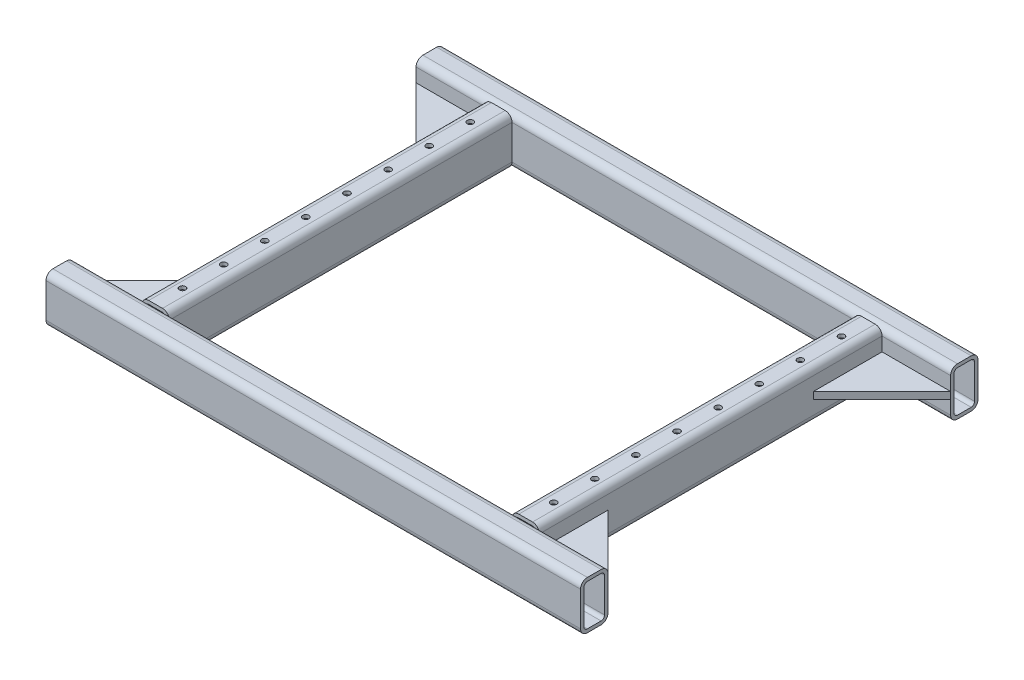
ISO-10303-21;
HEADER;
FILE_DESCRIPTION(('STEP AP214'),'2;1');
FILE_NAME('part.step','',(''),(''),'','','');
FILE_SCHEMA(('AUTOMOTIVE_DESIGN { 1 0 10303 214 1 1 1 1 }'));
ENDSEC;
DATA;
#1=APPLICATION_CONTEXT('core data for automotive mechanical design processes');
#2=APPLICATION_PROTOCOL_DEFINITION('international standard','automotive_design',2000,#1);
#3=PRODUCT_CONTEXT('',#1,'mechanical');
#4=PRODUCT('Part','Part','',(#3));
#5=PRODUCT_RELATED_PRODUCT_CATEGORY('part','',(#4));
#6=PRODUCT_DEFINITION_FORMATION('','',#4);
#7=PRODUCT_DEFINITION_CONTEXT('part definition',#1,'design');
#8=PRODUCT_DEFINITION('design','',#6,#7);
#9=PRODUCT_DEFINITION_SHAPE('','',#8);
#10=(LENGTH_UNIT() NAMED_UNIT(*) SI_UNIT(.MILLI.,.METRE.));
#11=(NAMED_UNIT(*) PLANE_ANGLE_UNIT() SI_UNIT($,.RADIAN.));
#12=(NAMED_UNIT(*) SI_UNIT($,.STERADIAN.) SOLID_ANGLE_UNIT());
#13=UNCERTAINTY_MEASURE_WITH_UNIT(LENGTH_MEASURE(1.E-05),#10,'distance_accuracy_value','');
#14=(GEOMETRIC_REPRESENTATION_CONTEXT(3) GLOBAL_UNCERTAINTY_ASSIGNED_CONTEXT((#13)) GLOBAL_UNIT_ASSIGNED_CONTEXT((#10,
#11,#12)) REPRESENTATION_CONTEXT('',''));
#15=CARTESIAN_POINT('',(0.,0.,0.));
#16=DIRECTION('',(0.,0.,1.));
#17=DIRECTION('',(1.,0.,0.));
#18=AXIS2_PLACEMENT_3D('',#15,#16,#17);
#19=CARTESIAN_POINT('',(-390.,-5.,-250.));
#20=DIRECTION('',(0.707106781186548,0.,-0.707106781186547));
#21=DIRECTION('',(-0.707106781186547,0.,-0.707106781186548));
#22=AXIS2_PLACEMENT_3D('',#19,#20,#21);
#23=PLANE('',#22);
#24=DIRECTION('',(-0.707106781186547,0.,-0.707106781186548));
#25=VECTOR('',#24,1.);
#26=CARTESIAN_POINT('',(-390.,5.,-250.));
#27=LINE('',#26,#25);
#28=CARTESIAN_POINT('',(-290.,5.,-150.));
#29=VERTEX_POINT('',#28);
#30=CARTESIAN_POINT('',(-390.,5.,-250.));
#31=VERTEX_POINT('',#30);
#32=EDGE_CURVE('E126',#29,#31,#27,.T.);
#33=ORIENTED_EDGE('',*,*,#32,.T.);
#34=DIRECTION('',(0.,1.,0.));
#35=VECTOR('',#34,1.);
#36=CARTESIAN_POINT('',(-390.,-5.,-250.));
#37=LINE('',#36,#35);
#38=CARTESIAN_POINT('',(-390.,-5.,-250.));
#39=VERTEX_POINT('',#38);
#40=EDGE_CURVE('E13',#39,#31,#37,.T.);
#41=ORIENTED_EDGE('',*,*,#40,.F.);
#42=DIRECTION('',(-0.707106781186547,0.,-0.707106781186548));
#43=VECTOR('',#42,1.);
#44=CARTESIAN_POINT('',(-390.,-5.,-250.));
#45=LINE('',#44,#43);
#46=CARTESIAN_POINT('',(-290.,-5.,-150.));
#47=VERTEX_POINT('',#46);
#48=EDGE_CURVE('E119',#47,#39,#45,.T.);
#49=ORIENTED_EDGE('',*,*,#48,.F.);
#50=DIRECTION('',(0.,1.,0.));
#51=VECTOR('',#50,1.);
#52=CARTESIAN_POINT('',(-290.,-5.,-150.));
#53=LINE('',#52,#51);
#54=EDGE_CURVE('E127',#47,#29,#53,.T.);
#55=ORIENTED_EDGE('',*,*,#54,.T.);
#56=EDGE_LOOP('',(#33,#41,#49,#55));
#57=FACE_BOUND('',#56,.T.);
#58=ADVANCED_FACE('F79',(#57),#23,.F.);
#59=CARTESIAN_POINT('',(-290.,-5.,-250.));
#60=DIRECTION('',(0.,0.,1.));
#61=DIRECTION('',(1.,0.,0.));
#62=AXIS2_PLACEMENT_3D('',#59,#60,#61);
#63=PLANE('',#62);
#64=DIRECTION('',(1.,0.,0.));
#65=VECTOR('',#64,1.);
#66=CARTESIAN_POINT('',(-290.,5.,-250.));
#67=LINE('',#66,#65);
#68=CARTESIAN_POINT('',(-290.,5.,-250.));
#69=VERTEX_POINT('',#68);
#70=EDGE_CURVE('E107',#31,#69,#67,.T.);
#71=ORIENTED_EDGE('',*,*,#70,.T.);
#72=DIRECTION('',(0.,1.,0.));
#73=VECTOR('',#72,1.);
#74=CARTESIAN_POINT('',(-290.,-5.,-250.));
#75=LINE('',#74,#73);
#76=CARTESIAN_POINT('',(-290.,-5.,-250.));
#77=VERTEX_POINT('',#76);
#78=EDGE_CURVE('E87',#77,#69,#75,.T.);
#79=ORIENTED_EDGE('',*,*,#78,.F.);
#80=DIRECTION('',(1.,0.,0.));
#81=VECTOR('',#80,1.);
#82=CARTESIAN_POINT('',(-290.,-5.,-250.));
#83=LINE('',#82,#81);
#84=EDGE_CURVE('E115',#39,#77,#83,.T.);
#85=ORIENTED_EDGE('',*,*,#84,.F.);
#86=ORIENTED_EDGE('',*,*,#40,.T.);
#87=EDGE_LOOP('',(#71,#79,#85,#86));
#88=FACE_BOUND('',#87,.T.);
#89=ADVANCED_FACE('F116',(#88),#63,.F.);
#90=CARTESIAN_POINT('',(-290.,-5.,-250.));
#91=DIRECTION('',(-1.,0.,0.));
#92=DIRECTION('',(0.,0.,1.));
#93=AXIS2_PLACEMENT_3D('',#90,#91,#92);
#94=PLANE('',#93);
#95=DIRECTION('',(0.,0.,1.));
#96=VECTOR('',#95,1.);
#97=CARTESIAN_POINT('',(-290.,5.,-250.));
#98=LINE('',#97,#96);
#99=EDGE_CURVE('E112',#69,#29,#98,.T.);
#100=ORIENTED_EDGE('',*,*,#99,.T.);
#101=ORIENTED_EDGE('',*,*,#54,.F.);
#102=DIRECTION('',(0.,0.,1.));
#103=VECTOR('',#102,1.);
#104=CARTESIAN_POINT('',(-290.,-5.,-250.));
#105=LINE('',#104,#103);
#106=EDGE_CURVE('E95',#77,#47,#105,.T.);
#107=ORIENTED_EDGE('',*,*,#106,.F.);
#108=ORIENTED_EDGE('',*,*,#78,.T.);
#109=EDGE_LOOP('',(#100,#101,#107,#108));
#110=FACE_BOUND('',#109,.T.);
#111=ADVANCED_FACE('F134',(#110),#94,.F.);
#112=CARTESIAN_POINT('',(0.,-5.,0.));
#113=DIRECTION('',(0.,-1.,0.));
#114=DIRECTION('',(0.,0.,-1.));
#115=AXIS2_PLACEMENT_3D('',#112,#113,#114);
#116=PLANE('',#115);
#117=ORIENTED_EDGE('',*,*,#48,.T.);
#118=ORIENTED_EDGE('',*,*,#84,.T.);
#119=ORIENTED_EDGE('',*,*,#106,.T.);
#120=EDGE_LOOP('',(#117,#118,#119));
#121=FACE_BOUND('',#120,.T.);
#122=ADVANCED_FACE('F122',(#121),#116,.T.);
#123=CARTESIAN_POINT('',(0.,5.,0.));
#124=DIRECTION('',(0.,-1.,0.));
#125=DIRECTION('',(0.,0.,-1.));
#126=AXIS2_PLACEMENT_3D('',#123,#124,#125);
#127=PLANE('',#126);
#128=ORIENTED_EDGE('',*,*,#32,.F.);
#129=ORIENTED_EDGE('',*,*,#99,.F.);
#130=ORIENTED_EDGE('',*,*,#70,.F.);
#131=EDGE_LOOP('',(#128,#129,#130));
#132=FACE_BOUND('',#131,.T.);
#133=ADVANCED_FACE('F135',(#132),#127,.F.);
#134=CLOSED_SHELL('',(#58,#89,#111,#122,#133));
#135=MANIFOLD_SOLID_BREP('B2',#134);
#136=CARTESIAN_POINT('',(390.,-25.,-250.));
#137=DIRECTION('',(0.,0.,-1.));
#138=DIRECTION('',(-1.,0.,0.));
#139=AXIS2_PLACEMENT_3D('',#136,#137,#138);
#140=PLANE('',#139);
#141=DIRECTION('',(-1.,0.,0.));
#142=VECTOR('',#141,1.);
#143=CARTESIAN_POINT('',(390.,25.,-250.));
#144=LINE('',#143,#142);
#145=CARTESIAN_POINT('',(-255.,25.,-250.));
#146=VERTEX_POINT('',#145);
#147=CARTESIAN_POINT('',(-285.,25.,-250.));
#148=VERTEX_POINT('',#147);
#149=EDGE_CURVE('E1304',#146,#148,#144,.T.);
#150=ORIENTED_EDGE('',*,*,#149,.T.);
#151=DIRECTION('',(0.,1.,0.));
#152=VECTOR('',#151,1.);
#153=CARTESIAN_POINT('',(-285.,-25.,-250.));
#154=LINE('',#153,#152);
#155=CARTESIAN_POINT('',(-285.,-25.,-250.));
#156=VERTEX_POINT('',#155);
#157=EDGE_CURVE('E1456',#156,#148,#154,.T.);
#158=ORIENTED_EDGE('',*,*,#157,.F.);
#159=DIRECTION('',(-1.,0.,0.));
#160=VECTOR('',#159,1.);
#161=CARTESIAN_POINT('',(390.,-25.,-250.));
#162=LINE('',#161,#160);
#163=CARTESIAN_POINT('',(-255.,-25.,-250.));
#164=VERTEX_POINT('',#163);
#165=EDGE_CURVE('E2012',#164,#156,#162,.T.);
#166=ORIENTED_EDGE('',*,*,#165,.F.);
#167=DIRECTION('',(0.,-1.,0.));
#168=VECTOR('',#167,1.);
#169=CARTESIAN_POINT('',(-255.,25.,-250.));
#170=LINE('',#169,#168);
#171=EDGE_CURVE('E201',#146,#164,#170,.T.);
#172=ORIENTED_EDGE('',*,*,#171,.F.);
#173=EDGE_LOOP('',(#150,#158,#166,#172));
#174=FACE_BOUND('',#173,.T.);
#175=ADVANCED_FACE('F176',(#174),#140,.F.);
#176=DIRECTION('',(0.,-1.,0.));
#177=VECTOR('',#176,1.);
#178=CARTESIAN_POINT('',(-250.,25.,-250.));
#179=LINE('',#178,#177);
#180=CARTESIAN_POINT('',(-250.,25.,-250.));
#181=VERTEX_POINT('',#180);
#182=CARTESIAN_POINT('',(-250.,-25.,-250.));
#183=VERTEX_POINT('',#182);
#184=EDGE_CURVE('E1336',#181,#183,#179,.T.);
#185=ORIENTED_EDGE('',*,*,#184,.T.);
#186=CARTESIAN_POINT('',(250.,-25.,-250.));
#187=VERTEX_POINT('',#186);
#188=EDGE_CURVE('E1334',#187,#183,#162,.T.);
#189=ORIENTED_EDGE('',*,*,#188,.F.);
#190=DIRECTION('',(0.,1.,0.));
#191=VECTOR('',#190,1.);
#192=CARTESIAN_POINT('',(250.,-25.,-250.));
#193=LINE('',#192,#191);
#194=CARTESIAN_POINT('',(250.,25.,-250.));
#195=VERTEX_POINT('',#194);
#196=EDGE_CURVE('E959',#187,#195,#193,.T.);
#197=ORIENTED_EDGE('',*,*,#196,.T.);
#198=EDGE_CURVE('E1305',#195,#181,#144,.T.);
#199=ORIENTED_EDGE('',*,*,#198,.T.);
#200=EDGE_LOOP('',(#185,#189,#197,#199));
#201=FACE_BOUND('',#200,.T.);
#202=ADVANCED_FACE('F1257',(#201),#140,.F.);
#203=CARTESIAN_POINT('',(390.,25.,250.));
#204=DIRECTION('',(0.,0.,1.));
#205=DIRECTION('',(1.,0.,0.));
#206=AXIS2_PLACEMENT_3D('',#203,#204,#205);
#207=PLANE('',#206);
#208=CARTESIAN_POINT('',(260.,25.,250.));
#209=DIRECTION('',(0.,0.,1.));
#210=DIRECTION('',(1.,0.,0.));
#211=AXIS2_PLACEMENT_3D('',#208,#209,#210);
#212=CIRCLE('',#211,10.);
#213=CARTESIAN_POINT('',(260.,35.,250.));
#214=VERTEX_POINT('',#213);
#215=CARTESIAN_POINT('',(250.,25.,250.));
#216=VERTEX_POINT('',#215);
#217=EDGE_CURVE('E970',#214,#216,#212,.T.);
#218=ORIENTED_EDGE('',*,*,#217,.T.);
#219=DIRECTION('',(-1.,0.,0.));
#220=VECTOR('',#219,1.);
#221=CARTESIAN_POINT('',(390.,25.,250.));
#222=LINE('',#221,#220);
#223=CARTESIAN_POINT('',(255.,25.,250.));
#224=VERTEX_POINT('',#223);
#225=EDGE_CURVE('E1365',#224,#216,#222,.T.);
#226=ORIENTED_EDGE('',*,*,#225,.F.);
#227=CARTESIAN_POINT('',(260.,25.,250.));
#228=DIRECTION('',(0.,0.,1.));
#229=DIRECTION('',(1.,0.,0.));
#230=AXIS2_PLACEMENT_3D('',#227,#228,#229);
#231=CIRCLE('',#230,5.);
#232=CARTESIAN_POINT('',(260.,30.,250.));
#233=VERTEX_POINT('',#232);
#234=EDGE_CURVE('E979',#233,#224,#231,.T.);
#235=ORIENTED_EDGE('',*,*,#234,.F.);
#236=DIRECTION('',(-1.,0.,0.));
#237=VECTOR('',#236,1.);
#238=CARTESIAN_POINT('',(280.,30.,250.));
#239=LINE('',#238,#237);
#240=CARTESIAN_POINT('',(280.,30.,250.));
#241=VERTEX_POINT('',#240);
#242=EDGE_CURVE('E984',#241,#233,#239,.T.);
#243=ORIENTED_EDGE('',*,*,#242,.F.);
#244=CARTESIAN_POINT('',(280.,25.,250.));
#245=DIRECTION('',(0.,0.,1.));
#246=DIRECTION('',(1.,0.,0.));
#247=AXIS2_PLACEMENT_3D('',#244,#245,#246);
#248=CIRCLE('',#247,5.);
#249=CARTESIAN_POINT('',(285.,25.,250.));
#250=VERTEX_POINT('',#249);
#251=EDGE_CURVE('E988',#250,#241,#248,.T.);
#252=ORIENTED_EDGE('',*,*,#251,.F.);
#253=CARTESIAN_POINT('',(290.,25.,250.));
#254=VERTEX_POINT('',#253);
#255=EDGE_CURVE('E769',#254,#250,#222,.T.);
#256=ORIENTED_EDGE('',*,*,#255,.F.);
#257=CARTESIAN_POINT('',(280.,25.,250.));
#258=DIRECTION('',(0.,0.,1.));
#259=DIRECTION('',(1.,0.,0.));
#260=AXIS2_PLACEMENT_3D('',#257,#258,#259);
#261=CIRCLE('',#260,10.);
#262=CARTESIAN_POINT('',(280.,35.,250.));
#263=VERTEX_POINT('',#262);
#264=EDGE_CURVE('E968',#254,#263,#261,.T.);
#265=ORIENTED_EDGE('',*,*,#264,.T.);
#266=DIRECTION('',(-1.,0.,0.));
#267=VECTOR('',#266,1.);
#268=CARTESIAN_POINT('',(390.,35.,250.));
#269=LINE('',#268,#267);
#270=EDGE_CURVE('E1013',#263,#214,#269,.T.);
#271=ORIENTED_EDGE('',*,*,#270,.T.);
#272=EDGE_LOOP('',(#218,#226,#235,#243,#252,#256,#265,#271));
#273=FACE_BOUND('',#272,.T.);
#274=ADVANCED_FACE('F1264',(#273),#207,.T.);
#275=DIRECTION('',(0.,-1.,0.));
#276=VECTOR('',#275,1.);
#277=CARTESIAN_POINT('',(290.,25.,-250.));
#278=LINE('',#277,#276);
#279=CARTESIAN_POINT('',(290.,-5.,-250.));
#280=VERTEX_POINT('',#279);
#281=CARTESIAN_POINT('',(290.,-25.,-250.));
#282=VERTEX_POINT('',#281);
#283=EDGE_CURVE('E1021',#280,#282,#278,.T.);
#284=ORIENTED_EDGE('',*,*,#283,.T.);
#285=CARTESIAN_POINT('',(390.,-25.,-250.));
#286=VERTEX_POINT('',#285);
#287=EDGE_CURVE('E1186',#286,#282,#162,.T.);
#288=ORIENTED_EDGE('',*,*,#287,.F.);
#289=DIRECTION('',(0.,-1.,0.));
#290=VECTOR('',#289,1.);
#291=CARTESIAN_POINT('',(390.,-25.,-250.));
#292=LINE('',#291,#290);
#293=CARTESIAN_POINT('',(390.,-5.,-250.));
#294=VERTEX_POINT('',#293);
#295=EDGE_CURVE('E1119',#294,#286,#292,.T.);
#296=ORIENTED_EDGE('',*,*,#295,.F.);
#297=DIRECTION('',(-1.,0.,0.));
#298=VECTOR('',#297,1.);
#299=CARTESIAN_POINT('',(290.,-5.,-250.));
#300=LINE('',#299,#298);
#301=EDGE_CURVE('E1078',#294,#280,#300,.T.);
#302=ORIENTED_EDGE('',*,*,#301,.T.);
#303=EDGE_LOOP('',(#284,#288,#296,#302));
#304=FACE_BOUND('',#303,.T.);
#305=ADVANCED_FACE('F1266',(#304),#140,.F.);
#306=CARTESIAN_POINT('',(290.,25.,-250.));
#307=VERTEX_POINT('',#306);
#308=CARTESIAN_POINT('',(290.,5.,-250.));
#309=VERTEX_POINT('',#308);
#310=EDGE_CURVE('E1056',#307,#309,#278,.T.);
#311=ORIENTED_EDGE('',*,*,#310,.T.);
#312=DIRECTION('',(-1.,0.,0.));
#313=VECTOR('',#312,1.);
#314=CARTESIAN_POINT('',(290.,5.,-250.));
#315=LINE('',#314,#313);
#316=CARTESIAN_POINT('',(390.,5.,-250.));
#317=VERTEX_POINT('',#316);
#318=EDGE_CURVE('E1075',#317,#309,#315,.T.);
#319=ORIENTED_EDGE('',*,*,#318,.F.);
#320=CARTESIAN_POINT('',(390.,25.,-250.));
#321=VERTEX_POINT('',#320);
#322=EDGE_CURVE('E1120',#321,#317,#292,.T.);
#323=ORIENTED_EDGE('',*,*,#322,.F.);
#324=EDGE_CURVE('E1191',#321,#307,#144,.T.);
#325=ORIENTED_EDGE('',*,*,#324,.T.);
#326=EDGE_LOOP('',(#311,#319,#323,#325));
#327=FACE_BOUND('',#326,.T.);
#328=ADVANCED_FACE('F1286',(#327),#140,.F.);
#329=DIRECTION('',(0.,1.,0.));
#330=VECTOR('',#329,1.);
#331=CARTESIAN_POINT('',(-290.,-25.,-250.));
#332=LINE('',#331,#330);
#333=CARTESIAN_POINT('',(-290.,-25.,-250.));
#334=VERTEX_POINT('',#333);
#335=CARTESIAN_POINT('',(-290.,25.,-250.));
#336=VERTEX_POINT('',#335);
#337=EDGE_CURVE('E193',#334,#336,#332,.T.);
#338=ORIENTED_EDGE('',*,*,#337,.T.);
#339=CARTESIAN_POINT('',(-390.,25.,-250.));
#340=VERTEX_POINT('',#339);
#341=EDGE_CURVE('E1189',#336,#340,#144,.T.);
#342=ORIENTED_EDGE('',*,*,#341,.T.);
#343=DIRECTION('',(0.,-1.,0.));
#344=VECTOR('',#343,1.);
#345=CARTESIAN_POINT('',(-390.,-25.,-250.));
#346=LINE('',#345,#344);
#347=CARTESIAN_POINT('',(-390.,-25.,-250.));
#348=VERTEX_POINT('',#347);
#349=EDGE_CURVE('E1163',#340,#348,#346,.T.);
#350=ORIENTED_EDGE('',*,*,#349,.T.);
#351=EDGE_CURVE('E1185',#334,#348,#162,.T.);
#352=ORIENTED_EDGE('',*,*,#351,.F.);
#353=EDGE_LOOP('',(#338,#342,#350,#352));
#354=FACE_BOUND('',#353,.T.);
#355=ADVANCED_FACE('F1274',(#354),#140,.F.);
#356=CARTESIAN_POINT('',(390.,25.,-280.));
#357=DIRECTION('',(-1.,0.,0.));
#358=DIRECTION('',(0.,0.,1.));
#359=AXIS2_PLACEMENT_3D('',#356,#357,#358);
#360=CYLINDRICAL_SURFACE('',#359,10.);
#361=CARTESIAN_POINT('',(-390.,25.,-280.));
#362=DIRECTION('',(1.,0.,0.));
#363=DIRECTION('',(0.,0.,-1.));
#364=AXIS2_PLACEMENT_3D('',#361,#362,#363);
#365=CIRCLE('',#364,10.);
#366=CARTESIAN_POINT('',(-390.,25.,-290.));
#367=VERTEX_POINT('',#366);
#368=CARTESIAN_POINT('',(-390.,35.,-280.));
#369=VERTEX_POINT('',#368);
#370=EDGE_CURVE('E1155',#367,#369,#365,.T.);
#371=ORIENTED_EDGE('',*,*,#370,.T.);
#372=DIRECTION('',(-1.,0.,0.));
#373=VECTOR('',#372,1.);
#374=CARTESIAN_POINT('',(390.,35.,-280.));
#375=LINE('',#374,#373);
#376=CARTESIAN_POINT('',(390.,35.,-280.));
#377=VERTEX_POINT('',#376);
#378=EDGE_CURVE('E77',#377,#369,#375,.T.);
#379=ORIENTED_EDGE('',*,*,#378,.F.);
#380=CARTESIAN_POINT('',(390.,25.,-280.));
#381=DIRECTION('',(1.,0.,0.));
#382=DIRECTION('',(0.,0.,-1.));
#383=AXIS2_PLACEMENT_3D('',#380,#381,#382);
#384=CIRCLE('',#383,10.);
#385=CARTESIAN_POINT('',(390.,25.,-290.));
#386=VERTEX_POINT('',#385);
#387=EDGE_CURVE('E1112',#386,#377,#384,.T.);
#388=ORIENTED_EDGE('',*,*,#387,.F.);
#389=DIRECTION('',(-1.,0.,0.));
#390=VECTOR('',#389,1.);
#391=CARTESIAN_POINT('',(390.,25.,-290.));
#392=LINE('',#391,#390);
#393=EDGE_CURVE('E1173',#386,#367,#392,.T.);
#394=ORIENTED_EDGE('',*,*,#393,.T.);
#395=EDGE_LOOP('',(#371,#379,#388,#394));
#396=FACE_BOUND('',#395,.T.);
#397=ADVANCED_FACE('F1285',(#396),#360,.T.);
#398=CARTESIAN_POINT('',(390.,35.,-280.));
#399=DIRECTION('',(0.,-1.,0.));
#400=DIRECTION('',(0.,0.,-1.));
#401=AXIS2_PLACEMENT_3D('',#398,#399,#400);
#402=PLANE('',#401);
#403=DIRECTION('',(0.,0.,1.));
#404=VECTOR('',#403,1.);
#405=CARTESIAN_POINT('',(-390.,35.,-280.));
#406=LINE('',#405,#404);
#407=CARTESIAN_POINT('',(-390.,35.,-260.));
#408=VERTEX_POINT('',#407);
#409=EDGE_CURVE('E1158',#369,#408,#406,.T.);
#410=ORIENTED_EDGE('',*,*,#409,.T.);
#411=DIRECTION('',(-1.,0.,0.));
#412=VECTOR('',#411,1.);
#413=CARTESIAN_POINT('',(390.,35.,-260.));
#414=LINE('',#413,#412);
#415=CARTESIAN_POINT('',(390.,35.,-260.));
#416=VERTEX_POINT('',#415);
#417=EDGE_CURVE('E185',#416,#408,#414,.T.);
#418=ORIENTED_EDGE('',*,*,#417,.F.);
#419=DIRECTION('',(0.,0.,1.));
#420=VECTOR('',#419,1.);
#421=CARTESIAN_POINT('',(390.,35.,-280.));
#422=LINE('',#421,#420);
#423=EDGE_CURVE('E1115',#377,#416,#422,.T.);
#424=ORIENTED_EDGE('',*,*,#423,.F.);
#425=ORIENTED_EDGE('',*,*,#378,.T.);
#426=EDGE_LOOP('',(#410,#418,#424,#425));
#427=FACE_BOUND('',#426,.T.);
#428=ADVANCED_FACE('F1281',(#427),#402,.F.);
#429=CARTESIAN_POINT('',(390.,25.,-260.));
#430=DIRECTION('',(-1.,0.,0.));
#431=DIRECTION('',(0.,0.,1.));
#432=AXIS2_PLACEMENT_3D('',#429,#430,#431);
#433=CYLINDRICAL_SURFACE('',#432,10.);
#434=CARTESIAN_POINT('',(-390.,25.,-260.));
#435=DIRECTION('',(1.,0.,0.));
#436=DIRECTION('',(0.,0.,-1.));
#437=AXIS2_PLACEMENT_3D('',#434,#435,#436);
#438=CIRCLE('',#437,10.);
#439=EDGE_CURVE('E1160',#408,#340,#438,.T.);
#440=ORIENTED_EDGE('',*,*,#439,.T.);
#441=ORIENTED_EDGE('',*,*,#341,.F.);
#442=DIRECTION('',(-1.,0.,0.));
#443=VECTOR('',#442,1.);
#444=CARTESIAN_POINT('',(390.,25.,-250.));
#445=LINE('',#444,#443);
#446=EDGE_CURVE('E796',#148,#336,#445,.T.);
#447=ORIENTED_EDGE('',*,*,#446,.F.);
#448=ORIENTED_EDGE('',*,*,#149,.F.);
#449=EDGE_CURVE('E814',#181,#146,#445,.T.);
#450=ORIENTED_EDGE('',*,*,#449,.F.);
#451=ORIENTED_EDGE('',*,*,#198,.F.);
#452=DIRECTION('',(-1.,0.,0.));
#453=VECTOR('',#452,1.);
#454=CARTESIAN_POINT('',(390.,25.,-250.));
#455=LINE('',#454,#453);
#456=CARTESIAN_POINT('',(255.,25.,-250.));
#457=VERTEX_POINT('',#456);
#458=EDGE_CURVE('E1063',#457,#195,#455,.T.);
#459=ORIENTED_EDGE('',*,*,#458,.F.);
#460=CARTESIAN_POINT('',(285.,25.,-250.));
#461=VERTEX_POINT('',#460);
#462=EDGE_CURVE('E1194',#461,#457,#144,.T.);
#463=ORIENTED_EDGE('',*,*,#462,.F.);
#464=EDGE_CURVE('E1065',#307,#461,#455,.T.);
#465=ORIENTED_EDGE('',*,*,#464,.F.);
#466=ORIENTED_EDGE('',*,*,#324,.F.);
#467=CARTESIAN_POINT('',(390.,25.,-260.));
#468=DIRECTION('',(1.,0.,0.));
#469=DIRECTION('',(0.,0.,-1.));
#470=AXIS2_PLACEMENT_3D('',#467,#468,#469);
#471=CIRCLE('',#470,10.);
#472=EDGE_CURVE('E1117',#416,#321,#471,.T.);
#473=ORIENTED_EDGE('',*,*,#472,.F.);
#474=ORIENTED_EDGE('',*,*,#417,.T.);
#475=EDGE_LOOP('',(#440,#441,#447,#448,#450,#451,#459,#463,#465,#466,#473,#474));
#476=FACE_BOUND('',#475,.T.);
#477=ADVANCED_FACE('F1272',(#476),#433,.T.);
#478=ORIENTED_EDGE('',*,*,#462,.T.);
#479=DIRECTION('',(0.,1.,0.));
#480=VECTOR('',#479,1.);
#481=CARTESIAN_POINT('',(255.,-25.,-250.));
#482=LINE('',#481,#480);
#483=CARTESIAN_POINT('',(255.,-25.,-250.));
#484=VERTEX_POINT('',#483);
#485=EDGE_CURVE('E932',#484,#457,#482,.T.);
#486=ORIENTED_EDGE('',*,*,#485,.F.);
#487=CARTESIAN_POINT('',(285.,-25.,-250.));
#488=VERTEX_POINT('',#487);
#489=EDGE_CURVE('E1190',#488,#484,#162,.T.);
#490=ORIENTED_EDGE('',*,*,#489,.F.);
#491=DIRECTION('',(0.,-1.,0.));
#492=VECTOR('',#491,1.);
#493=CARTESIAN_POINT('',(285.,25.,-250.));
#494=LINE('',#493,#492);
#495=EDGE_CURVE('E944',#461,#488,#494,.T.);
#496=ORIENTED_EDGE('',*,*,#495,.F.);
#497=EDGE_LOOP('',(#478,#486,#490,#496));
#498=FACE_BOUND('',#497,.T.);
#499=ADVANCED_FACE('F1260',(#498),#140,.F.);
#500=CARTESIAN_POINT('',(390.,-25.,-260.));
#501=DIRECTION('',(-1.,0.,0.));
#502=DIRECTION('',(0.,0.,1.));
#503=AXIS2_PLACEMENT_3D('',#500,#501,#502);
#504=CYLINDRICAL_SURFACE('',#503,10.);
#505=CARTESIAN_POINT('',(-390.,-25.,-260.));
#506=DIRECTION('',(1.,0.,0.));
#507=DIRECTION('',(0.,0.,-1.));
#508=AXIS2_PLACEMENT_3D('',#505,#506,#507);
#509=CIRCLE('',#508,10.);
#510=CARTESIAN_POINT('',(-390.,-35.,-260.));
#511=VERTEX_POINT('',#510);
#512=EDGE_CURVE('E1166',#348,#511,#509,.T.);
#513=ORIENTED_EDGE('',*,*,#512,.T.);
#514=DIRECTION('',(-1.,0.,0.));
#515=VECTOR('',#514,1.);
#516=CARTESIAN_POINT('',(390.,-35.,-260.));
#517=LINE('',#516,#515);
#518=CARTESIAN_POINT('',(390.,-35.,-260.));
#519=VERTEX_POINT('',#518);
#520=EDGE_CURVE('E1182',#519,#511,#517,.T.);
#521=ORIENTED_EDGE('',*,*,#520,.F.);
#522=CARTESIAN_POINT('',(390.,-25.,-260.));
#523=DIRECTION('',(1.,0.,0.));
#524=DIRECTION('',(0.,0.,-1.));
#525=AXIS2_PLACEMENT_3D('',#522,#523,#524);
#526=CIRCLE('',#525,10.);
#527=EDGE_CURVE('E1123',#286,#519,#526,.T.);
#528=ORIENTED_EDGE('',*,*,#527,.F.);
#529=ORIENTED_EDGE('',*,*,#287,.T.);
#530=DIRECTION('',(-1.,0.,0.));
#531=VECTOR('',#530,1.);
#532=CARTESIAN_POINT('',(390.,-25.,-250.));
#533=LINE('',#532,#531);
#534=EDGE_CURVE('E1062',#282,#488,#533,.T.);
#535=ORIENTED_EDGE('',*,*,#534,.T.);
#536=ORIENTED_EDGE('',*,*,#489,.T.);
#537=EDGE_CURVE('E1059',#484,#187,#533,.T.);
#538=ORIENTED_EDGE('',*,*,#537,.T.);
#539=ORIENTED_EDGE('',*,*,#188,.T.);
#540=EDGE_CURVE('E1338',#183,#164,#162,.T.);
#541=ORIENTED_EDGE('',*,*,#540,.T.);
#542=ORIENTED_EDGE('',*,*,#165,.T.);
#543=EDGE_CURVE('E2009',#156,#334,#162,.T.);
#544=ORIENTED_EDGE('',*,*,#543,.T.);
#545=ORIENTED_EDGE('',*,*,#351,.T.);
#546=EDGE_LOOP('',(#513,#521,#528,#529,#535,#536,#538,#539,#541,#542,#544,#545));
#547=FACE_BOUND('',#546,.T.);
#548=ADVANCED_FACE('F1271',(#547),#504,.T.);
#549=CARTESIAN_POINT('',(390.,-35.,-260.));
#550=DIRECTION('',(0.,1.,0.));
#551=DIRECTION('',(0.,0.,1.));
#552=AXIS2_PLACEMENT_3D('',#549,#550,#551);
#553=PLANE('',#552);
#554=DIRECTION('',(0.,0.,-1.));
#555=VECTOR('',#554,1.);
#556=CARTESIAN_POINT('',(-390.,-35.,-260.));
#557=LINE('',#556,#555);
#558=CARTESIAN_POINT('',(-390.,-35.,-280.));
#559=VERTEX_POINT('',#558);
#560=EDGE_CURVE('E1168',#511,#559,#557,.T.);
#561=ORIENTED_EDGE('',*,*,#560,.T.);
#562=DIRECTION('',(-1.,0.,0.));
#563=VECTOR('',#562,1.);
#564=CARTESIAN_POINT('',(390.,-35.,-280.));
#565=LINE('',#564,#563);
#566=CARTESIAN_POINT('',(390.,-35.,-280.));
#567=VERTEX_POINT('',#566);
#568=EDGE_CURVE('E1179',#567,#559,#565,.T.);
#569=ORIENTED_EDGE('',*,*,#568,.F.);
#570=DIRECTION('',(0.,0.,-1.));
#571=VECTOR('',#570,1.);
#572=CARTESIAN_POINT('',(390.,-35.,-260.));
#573=LINE('',#572,#571);
#574=EDGE_CURVE('E1125',#519,#567,#573,.T.);
#575=ORIENTED_EDGE('',*,*,#574,.F.);
#576=ORIENTED_EDGE('',*,*,#520,.T.);
#577=EDGE_LOOP('',(#561,#569,#575,#576));
#578=FACE_BOUND('',#577,.T.);
#579=ADVANCED_FACE('F1279',(#578),#553,.F.);
#580=CARTESIAN_POINT('',(390.,-25.,-280.));
#581=DIRECTION('',(-1.,0.,0.));
#582=DIRECTION('',(0.,0.,1.));
#583=AXIS2_PLACEMENT_3D('',#580,#581,#582);
#584=CYLINDRICAL_SURFACE('',#583,10.);
#585=CARTESIAN_POINT('',(-390.,-25.,-280.));
#586=DIRECTION('',(1.,0.,0.));
#587=DIRECTION('',(0.,0.,-1.));
#588=AXIS2_PLACEMENT_3D('',#585,#586,#587);
#589=CIRCLE('',#588,10.);
#590=CARTESIAN_POINT('',(-390.,-25.,-290.));
#591=VERTEX_POINT('',#590);
#592=EDGE_CURVE('E1170',#559,#591,#589,.T.);
#593=ORIENTED_EDGE('',*,*,#592,.T.);
#594=DIRECTION('',(-1.,0.,0.));
#595=VECTOR('',#594,1.);
#596=CARTESIAN_POINT('',(390.,-25.,-290.));
#597=LINE('',#596,#595);
#598=CARTESIAN_POINT('',(390.,-25.,-290.));
#599=VERTEX_POINT('',#598);
#600=EDGE_CURVE('E1176',#599,#591,#597,.T.);
#601=ORIENTED_EDGE('',*,*,#600,.F.);
#602=CARTESIAN_POINT('',(390.,-25.,-280.));
#603=DIRECTION('',(1.,0.,0.));
#604=DIRECTION('',(0.,0.,-1.));
#605=AXIS2_PLACEMENT_3D('',#602,#603,#604);
#606=CIRCLE('',#605,10.);
#607=EDGE_CURVE('E1127',#567,#599,#606,.T.);
#608=ORIENTED_EDGE('',*,*,#607,.F.);
#609=ORIENTED_EDGE('',*,*,#568,.T.);
#610=EDGE_LOOP('',(#593,#601,#608,#609));
#611=FACE_BOUND('',#610,.T.);
#612=ADVANCED_FACE('F1911',(#611),#584,.T.);
#613=CARTESIAN_POINT('',(390.,25.,-260.));
#614=DIRECTION('',(-1.,0.,0.));
#615=DIRECTION('',(0.,0.,1.));
#616=AXIS2_PLACEMENT_3D('',#613,#614,#615);
#617=CYLINDRICAL_SURFACE('',#616,5.);
#618=CARTESIAN_POINT('',(-390.,25.,-260.));
#619=DIRECTION('',(1.,0.,0.));
#620=DIRECTION('',(0.,0.,-1.));
#621=AXIS2_PLACEMENT_3D('',#618,#619,#620);
#622=CIRCLE('',#621,5.);
#623=CARTESIAN_POINT('',(-390.,30.,-260.));
#624=VERTEX_POINT('',#623);
#625=CARTESIAN_POINT('',(-390.,25.,-255.));
#626=VERTEX_POINT('',#625);
#627=EDGE_CURVE('E1086',#624,#626,#622,.T.);
#628=ORIENTED_EDGE('',*,*,#627,.F.);
#629=DIRECTION('',(-1.,0.,0.));
#630=VECTOR('',#629,1.);
#631=CARTESIAN_POINT('',(390.,30.,-260.));
#632=LINE('',#631,#630);
#633=CARTESIAN_POINT('',(390.,30.,-260.));
#634=VERTEX_POINT('',#633);
#635=EDGE_CURVE('E180',#634,#624,#632,.T.);
#636=ORIENTED_EDGE('',*,*,#635,.F.);
#637=CARTESIAN_POINT('',(390.,25.,-260.));
#638=DIRECTION('',(1.,0.,0.));
#639=DIRECTION('',(0.,0.,-1.));
#640=AXIS2_PLACEMENT_3D('',#637,#638,#639);
#641=CIRCLE('',#640,5.);
#642=CARTESIAN_POINT('',(390.,25.,-255.));
#643=VERTEX_POINT('',#642);
#644=EDGE_CURVE('E1087',#634,#643,#641,.T.);
#645=ORIENTED_EDGE('',*,*,#644,.T.);
#646=DIRECTION('',(-1.,0.,0.));
#647=VECTOR('',#646,1.);
#648=CARTESIAN_POINT('',(390.,25.,-255.));
#649=LINE('',#648,#647);
#650=EDGE_CURVE('E1131',#643,#626,#649,.T.);
#651=ORIENTED_EDGE('',*,*,#650,.T.);
#652=EDGE_LOOP('',(#628,#636,#645,#651));
#653=FACE_BOUND('',#652,.T.);
#654=ADVANCED_FACE('F178',(#653),#617,.F.);
#655=CARTESIAN_POINT('',(390.,30.,-280.));
#656=DIRECTION('',(0.,-1.,0.));
#657=DIRECTION('',(0.,0.,-1.));
#658=AXIS2_PLACEMENT_3D('',#655,#656,#657);
#659=PLANE('',#658);
#660=DIRECTION('',(0.,0.,1.));
#661=VECTOR('',#660,1.);
#662=CARTESIAN_POINT('',(-390.,30.,-280.));
#663=LINE('',#662,#661);
#664=CARTESIAN_POINT('',(-390.,30.,-280.));
#665=VERTEX_POINT('',#664);
#666=EDGE_CURVE('E1134',#665,#624,#663,.T.);
#667=ORIENTED_EDGE('',*,*,#666,.F.);
#668=DIRECTION('',(-1.,0.,0.));
#669=VECTOR('',#668,1.);
#670=CARTESIAN_POINT('',(390.,30.,-280.));
#671=LINE('',#670,#669);
#672=CARTESIAN_POINT('',(390.,30.,-280.));
#673=VERTEX_POINT('',#672);
#674=EDGE_CURVE('E1207',#673,#665,#671,.T.);
#675=ORIENTED_EDGE('',*,*,#674,.F.);
#676=DIRECTION('',(0.,0.,1.));
#677=VECTOR('',#676,1.);
#678=CARTESIAN_POINT('',(390.,30.,-280.));
#679=LINE('',#678,#677);
#680=EDGE_CURVE('E1090',#673,#634,#679,.T.);
#681=ORIENTED_EDGE('',*,*,#680,.T.);
#682=ORIENTED_EDGE('',*,*,#635,.T.);
#683=EDGE_LOOP('',(#667,#675,#681,#682));
#684=FACE_BOUND('',#683,.T.);
#685=ADVANCED_FACE('F1213',(#684),#659,.T.);
#686=CARTESIAN_POINT('',(390.,25.,-280.));
#687=DIRECTION('',(-1.,0.,0.));
#688=DIRECTION('',(0.,0.,1.));
#689=AXIS2_PLACEMENT_3D('',#686,#687,#688);
#690=CYLINDRICAL_SURFACE('',#689,5.);
#691=CARTESIAN_POINT('',(-390.,25.,-280.));
#692=DIRECTION('',(1.,0.,0.));
#693=DIRECTION('',(0.,0.,-1.));
#694=AXIS2_PLACEMENT_3D('',#691,#692,#693);
#695=CIRCLE('',#694,5.);
#696=CARTESIAN_POINT('',(-390.,25.,-285.));
#697=VERTEX_POINT('',#696);
#698=EDGE_CURVE('E1137',#697,#665,#695,.T.);
#699=ORIENTED_EDGE('',*,*,#698,.F.);
#700=DIRECTION('',(-1.,0.,0.));
#701=VECTOR('',#700,1.);
#702=CARTESIAN_POINT('',(390.,25.,-285.));
#703=LINE('',#702,#701);
#704=CARTESIAN_POINT('',(390.,25.,-285.));
#705=VERTEX_POINT('',#704);
#706=EDGE_CURVE('E1206',#705,#697,#703,.T.);
#707=ORIENTED_EDGE('',*,*,#706,.F.);
#708=CARTESIAN_POINT('',(390.,25.,-280.));
#709=DIRECTION('',(1.,0.,0.));
#710=DIRECTION('',(0.,0.,-1.));
#711=AXIS2_PLACEMENT_3D('',#708,#709,#710);
#712=CIRCLE('',#711,5.);
#713=EDGE_CURVE('E1094',#705,#673,#712,.T.);
#714=ORIENTED_EDGE('',*,*,#713,.T.);
#715=ORIENTED_EDGE('',*,*,#674,.T.);
#716=EDGE_LOOP('',(#699,#707,#714,#715));
#717=FACE_BOUND('',#716,.T.);
#718=ADVANCED_FACE('F1222',(#717),#690,.F.);
#719=CARTESIAN_POINT('',(390.,25.,-285.));
#720=DIRECTION('',(0.,0.,1.));
#721=DIRECTION('',(1.,0.,0.));
#722=AXIS2_PLACEMENT_3D('',#719,#720,#721);
#723=PLANE('',#722);
#724=DIRECTION('',(0.,1.,0.));
#725=VECTOR('',#724,1.);
#726=CARTESIAN_POINT('',(-390.,25.,-285.));
#727=LINE('',#726,#725);
#728=CARTESIAN_POINT('',(-390.,-25.,-285.));
#729=VERTEX_POINT('',#728);
#730=EDGE_CURVE('E1140',#729,#697,#727,.T.);
#731=ORIENTED_EDGE('',*,*,#730,.F.);
#732=DIRECTION('',(-1.,0.,0.));
#733=VECTOR('',#732,1.);
#734=CARTESIAN_POINT('',(390.,-25.,-285.));
#735=LINE('',#734,#733);
#736=CARTESIAN_POINT('',(390.,-25.,-285.));
#737=VERTEX_POINT('',#736);
#738=EDGE_CURVE('E1204',#737,#729,#735,.T.);
#739=ORIENTED_EDGE('',*,*,#738,.F.);
#740=DIRECTION('',(0.,1.,0.));
#741=VECTOR('',#740,1.);
#742=CARTESIAN_POINT('',(390.,25.,-285.));
#743=LINE('',#742,#741);
#744=EDGE_CURVE('E1097',#737,#705,#743,.T.);
#745=ORIENTED_EDGE('',*,*,#744,.T.);
#746=ORIENTED_EDGE('',*,*,#706,.T.);
#747=EDGE_LOOP('',(#731,#739,#745,#746));
#748=FACE_BOUND('',#747,.T.);
#749=ADVANCED_FACE('F1230',(#748),#723,.T.);
#750=CARTESIAN_POINT('',(390.,-25.,-280.));
#751=DIRECTION('',(-1.,0.,0.));
#752=DIRECTION('',(0.,0.,1.));
#753=AXIS2_PLACEMENT_3D('',#750,#751,#752);
#754=CYLINDRICAL_SURFACE('',#753,5.);
#755=CARTESIAN_POINT('',(-390.,-25.,-280.));
#756=DIRECTION('',(1.,0.,0.));
#757=DIRECTION('',(0.,0.,-1.));
#758=AXIS2_PLACEMENT_3D('',#755,#756,#757);
#759=CIRCLE('',#758,5.);
#760=CARTESIAN_POINT('',(-390.,-30.,-280.));
#761=VERTEX_POINT('',#760);
#762=EDGE_CURVE('E1143',#761,#729,#759,.T.);
#763=ORIENTED_EDGE('',*,*,#762,.F.);
#764=DIRECTION('',(-1.,0.,0.));
#765=VECTOR('',#764,1.);
#766=CARTESIAN_POINT('',(390.,-30.,-280.));
#767=LINE('',#766,#765);
#768=CARTESIAN_POINT('',(390.,-30.,-280.));
#769=VERTEX_POINT('',#768);
#770=EDGE_CURVE('E1202',#769,#761,#767,.T.);
#771=ORIENTED_EDGE('',*,*,#770,.F.);
#772=CARTESIAN_POINT('',(390.,-25.,-280.));
#773=DIRECTION('',(1.,0.,0.));
#774=DIRECTION('',(0.,0.,-1.));
#775=AXIS2_PLACEMENT_3D('',#772,#773,#774);
#776=CIRCLE('',#775,5.);
#777=EDGE_CURVE('E1100',#769,#737,#776,.T.);
#778=ORIENTED_EDGE('',*,*,#777,.T.);
#779=ORIENTED_EDGE('',*,*,#738,.T.);
#780=EDGE_LOOP('',(#763,#771,#778,#779));
#781=FACE_BOUND('',#780,.T.);
#782=ADVANCED_FACE('F1233',(#781),#754,.F.);
#783=CARTESIAN_POINT('',(390.,-30.,-260.));
#784=DIRECTION('',(0.,1.,0.));
#785=DIRECTION('',(0.,0.,1.));
#786=AXIS2_PLACEMENT_3D('',#783,#784,#785);
#787=PLANE('',#786);
#788=DIRECTION('',(0.,0.,-1.));
#789=VECTOR('',#788,1.);
#790=CARTESIAN_POINT('',(-390.,-30.,-260.));
#791=LINE('',#790,#789);
#792=CARTESIAN_POINT('',(-390.,-30.,-260.));
#793=VERTEX_POINT('',#792);
#794=EDGE_CURVE('E1146',#793,#761,#791,.T.);
#795=ORIENTED_EDGE('',*,*,#794,.F.);
#796=DIRECTION('',(-1.,0.,0.));
#797=VECTOR('',#796,1.);
#798=CARTESIAN_POINT('',(390.,-30.,-260.));
#799=LINE('',#798,#797);
#800=CARTESIAN_POINT('',(390.,-30.,-260.));
#801=VERTEX_POINT('',#800);
#802=EDGE_CURVE('E1200',#801,#793,#799,.T.);
#803=ORIENTED_EDGE('',*,*,#802,.F.);
#804=DIRECTION('',(0.,0.,-1.));
#805=VECTOR('',#804,1.);
#806=CARTESIAN_POINT('',(390.,-30.,-260.));
#807=LINE('',#806,#805);
#808=EDGE_CURVE('E1103',#801,#769,#807,.T.);
#809=ORIENTED_EDGE('',*,*,#808,.T.);
#810=ORIENTED_EDGE('',*,*,#770,.T.);
#811=EDGE_LOOP('',(#795,#803,#809,#810));
#812=FACE_BOUND('',#811,.T.);
#813=ADVANCED_FACE('F1238',(#812),#787,.T.);
#814=CARTESIAN_POINT('',(390.,-25.,-260.));
#815=DIRECTION('',(-1.,0.,0.));
#816=DIRECTION('',(0.,0.,1.));
#817=AXIS2_PLACEMENT_3D('',#814,#815,#816);
#818=CYLINDRICAL_SURFACE('',#817,5.);
#819=CARTESIAN_POINT('',(-390.,-25.,-260.));
#820=DIRECTION('',(1.,0.,0.));
#821=DIRECTION('',(0.,0.,-1.));
#822=AXIS2_PLACEMENT_3D('',#819,#820,#821);
#823=CIRCLE('',#822,5.);
#824=CARTESIAN_POINT('',(-390.,-25.,-255.));
#825=VERTEX_POINT('',#824);
#826=EDGE_CURVE('E1149',#825,#793,#823,.T.);
#827=ORIENTED_EDGE('',*,*,#826,.F.);
#828=DIRECTION('',(-1.,0.,0.));
#829=VECTOR('',#828,1.);
#830=CARTESIAN_POINT('',(390.,-25.,-255.));
#831=LINE('',#830,#829);
#832=CARTESIAN_POINT('',(390.,-25.,-255.));
#833=VERTEX_POINT('',#832);
#834=EDGE_CURVE('E1198',#833,#825,#831,.T.);
#835=ORIENTED_EDGE('',*,*,#834,.F.);
#836=CARTESIAN_POINT('',(390.,-25.,-260.));
#837=DIRECTION('',(1.,0.,0.));
#838=DIRECTION('',(0.,0.,-1.));
#839=AXIS2_PLACEMENT_3D('',#836,#837,#838);
#840=CIRCLE('',#839,5.);
#841=EDGE_CURVE('E1106',#833,#801,#840,.T.);
#842=ORIENTED_EDGE('',*,*,#841,.T.);
#843=ORIENTED_EDGE('',*,*,#802,.T.);
#844=EDGE_LOOP('',(#827,#835,#842,#843));
#845=FACE_BOUND('',#844,.T.);
#846=ADVANCED_FACE('F1241',(#845),#818,.F.);
#847=CARTESIAN_POINT('',(390.,-25.,-255.));
#848=DIRECTION('',(0.,0.,-1.));
#849=DIRECTION('',(-1.,0.,0.));
#850=AXIS2_PLACEMENT_3D('',#847,#848,#849);
#851=PLANE('',#850);
#852=DIRECTION('',(0.,-1.,0.));
#853=VECTOR('',#852,1.);
#854=CARTESIAN_POINT('',(-390.,-25.,-255.));
#855=LINE('',#854,#853);
#856=EDGE_CURVE('E1152',#626,#825,#855,.T.);
#857=ORIENTED_EDGE('',*,*,#856,.F.);
#858=ORIENTED_EDGE('',*,*,#650,.F.);
#859=DIRECTION('',(0.,-1.,0.));
#860=VECTOR('',#859,1.);
#861=CARTESIAN_POINT('',(390.,-25.,-255.));
#862=LINE('',#861,#860);
#863=EDGE_CURVE('E1109',#643,#833,#862,.T.);
#864=ORIENTED_EDGE('',*,*,#863,.T.);
#865=ORIENTED_EDGE('',*,*,#834,.T.);
#866=EDGE_LOOP('',(#857,#858,#864,#865));
#867=FACE_BOUND('',#866,.T.);
#868=ADVANCED_FACE('F1244',(#867),#851,.T.);
#869=CARTESIAN_POINT('',(390.,25.,-290.));
#870=DIRECTION('',(0.,0.,1.));
#871=DIRECTION('',(1.,0.,0.));
#872=AXIS2_PLACEMENT_3D('',#869,#870,#871);
#873=PLANE('',#872);
#874=DIRECTION('',(0.,1.,0.));
#875=VECTOR('',#874,1.);
#876=CARTESIAN_POINT('',(-390.,25.,-290.));
#877=LINE('',#876,#875);
#878=EDGE_CURVE('E1091',#591,#367,#877,.T.);
#879=ORIENTED_EDGE('',*,*,#878,.T.);
#880=ORIENTED_EDGE('',*,*,#393,.F.);
#881=DIRECTION('',(0.,1.,0.));
#882=VECTOR('',#881,1.);
#883=CARTESIAN_POINT('',(390.,25.,-290.));
#884=LINE('',#883,#882);
#885=EDGE_CURVE('E1129',#599,#386,#884,.T.);
#886=ORIENTED_EDGE('',*,*,#885,.F.);
#887=ORIENTED_EDGE('',*,*,#600,.T.);
#888=EDGE_LOOP('',(#879,#880,#886,#887));
#889=FACE_BOUND('',#888,.T.);
#890=ADVANCED_FACE('F1246',(#889),#873,.F.);
#891=CARTESIAN_POINT('',(390.,25.,-280.));
#892=DIRECTION('',(1.,0.,0.));
#893=DIRECTION('',(0.,0.,-1.));
#894=AXIS2_PLACEMENT_3D('',#891,#892,#893);
#895=PLANE('',#894);
#896=ORIENTED_EDGE('',*,*,#644,.F.);
#897=ORIENTED_EDGE('',*,*,#680,.F.);
#898=ORIENTED_EDGE('',*,*,#713,.F.);
#899=ORIENTED_EDGE('',*,*,#744,.F.);
#900=ORIENTED_EDGE('',*,*,#777,.F.);
#901=ORIENTED_EDGE('',*,*,#808,.F.);
#902=ORIENTED_EDGE('',*,*,#841,.F.);
#903=ORIENTED_EDGE('',*,*,#863,.F.);
#904=EDGE_LOOP('',(#896,#897,#898,#899,#900,#901,#902,#903));
#905=FACE_BOUND('',#904,.T.);
#906=ORIENTED_EDGE('',*,*,#387,.T.);
#907=ORIENTED_EDGE('',*,*,#423,.T.);
#908=ORIENTED_EDGE('',*,*,#472,.T.);
#909=ORIENTED_EDGE('',*,*,#322,.T.);
#910=DIRECTION('',(0.,1.,0.));
#911=VECTOR('',#910,1.);
#912=CARTESIAN_POINT('',(390.,-5.,-250.));
#913=LINE('',#912,#911);
#914=EDGE_CURVE('E1069',#294,#317,#913,.T.);
#915=ORIENTED_EDGE('',*,*,#914,.F.);
#916=ORIENTED_EDGE('',*,*,#295,.T.);
#917=ORIENTED_EDGE('',*,*,#527,.T.);
#918=ORIENTED_EDGE('',*,*,#574,.T.);
#919=ORIENTED_EDGE('',*,*,#607,.T.);
#920=ORIENTED_EDGE('',*,*,#885,.T.);
#921=EDGE_LOOP('',(#906,#907,#908,#909,#915,#916,#917,#918,#919,#920));
#922=FACE_BOUND('',#921,.T.);
#923=ADVANCED_FACE('F1227',(#905,#922),#895,.T.);
#924=CARTESIAN_POINT('',(-390.,25.,-280.));
#925=DIRECTION('',(1.,0.,0.));
#926=DIRECTION('',(0.,0.,-1.));
#927=AXIS2_PLACEMENT_3D('',#924,#925,#926);
#928=PLANE('',#927);
#929=ORIENTED_EDGE('',*,*,#627,.T.);
#930=ORIENTED_EDGE('',*,*,#856,.T.);
#931=ORIENTED_EDGE('',*,*,#826,.T.);
#932=ORIENTED_EDGE('',*,*,#794,.T.);
#933=ORIENTED_EDGE('',*,*,#762,.T.);
#934=ORIENTED_EDGE('',*,*,#730,.T.);
#935=ORIENTED_EDGE('',*,*,#698,.T.);
#936=ORIENTED_EDGE('',*,*,#666,.T.);
#937=EDGE_LOOP('',(#929,#930,#931,#932,#933,#934,#935,#936));
#938=FACE_BOUND('',#937,.T.);
#939=ORIENTED_EDGE('',*,*,#370,.F.);
#940=ORIENTED_EDGE('',*,*,#878,.F.);
#941=ORIENTED_EDGE('',*,*,#592,.F.);
#942=ORIENTED_EDGE('',*,*,#560,.F.);
#943=ORIENTED_EDGE('',*,*,#512,.F.);
#944=ORIENTED_EDGE('',*,*,#349,.F.);
#945=ORIENTED_EDGE('',*,*,#439,.F.);
#946=ORIENTED_EDGE('',*,*,#409,.F.);
#947=EDGE_LOOP('',(#939,#940,#941,#942,#943,#944,#945,#946));
#948=FACE_BOUND('',#947,.T.);
#949=ADVANCED_FACE('F1219',(#938,#948),#928,.F.);
#950=CARTESIAN_POINT('',(390.,-5.,-250.));
#951=DIRECTION('',(-0.707106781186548,0.,-0.707106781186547));
#952=DIRECTION('',(0.707106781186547,0.,-0.707106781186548));
#953=AXIS2_PLACEMENT_3D('',#950,#951,#952);
#954=PLANE('',#953);
#955=DIRECTION('',(0.707106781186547,0.,-0.707106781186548));
#956=VECTOR('',#955,1.);
#957=CARTESIAN_POINT('',(390.,5.,-250.));
#958=LINE('',#957,#956);
#959=CARTESIAN_POINT('',(290.,5.,-150.));
#960=VERTEX_POINT('',#959);
#961=EDGE_CURVE('E1066',#960,#317,#958,.T.);
#962=ORIENTED_EDGE('',*,*,#961,.F.);
#963=DIRECTION('',(0.,1.,0.));
#964=VECTOR('',#963,1.);
#965=CARTESIAN_POINT('',(290.,-5.,-150.));
#966=LINE('',#965,#964);
#967=CARTESIAN_POINT('',(290.,-5.,-150.));
#968=VERTEX_POINT('',#967);
#969=EDGE_CURVE('E1073',#968,#960,#966,.T.);
#970=ORIENTED_EDGE('',*,*,#969,.F.);
#971=DIRECTION('',(0.707106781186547,0.,-0.707106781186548));
#972=VECTOR('',#971,1.);
#973=CARTESIAN_POINT('',(390.,-5.,-250.));
#974=LINE('',#973,#972);
#975=EDGE_CURVE('E1071',#968,#294,#974,.T.);
#976=ORIENTED_EDGE('',*,*,#975,.T.);
#977=ORIENTED_EDGE('',*,*,#914,.T.);
#978=EDGE_LOOP('',(#962,#970,#976,#977));
#979=FACE_BOUND('',#978,.T.);
#980=ADVANCED_FACE('F1896',(#979),#954,.F.);
#981=CARTESIAN_POINT('',(0.,-5.,0.));
#982=DIRECTION('',(0.,-1.,0.));
#983=DIRECTION('',(0.,0.,-1.));
#984=AXIS2_PLACEMENT_3D('',#981,#982,#983);
#985=PLANE('',#984);
#986=ORIENTED_EDGE('',*,*,#975,.F.);
#987=DIRECTION('',(0.,0.,1.));
#988=VECTOR('',#987,1.);
#989=CARTESIAN_POINT('',(290.,-5.,-250.));
#990=LINE('',#989,#988);
#991=EDGE_CURVE('E1084',#280,#968,#990,.T.);
#992=ORIENTED_EDGE('',*,*,#991,.F.);
#993=ORIENTED_EDGE('',*,*,#301,.F.);
#994=EDGE_LOOP('',(#986,#992,#993));
#995=FACE_BOUND('',#994,.T.);
#996=ADVANCED_FACE('F1899',(#995),#985,.T.);
#997=CARTESIAN_POINT('',(0.,5.,0.));
#998=DIRECTION('',(0.,-1.,0.));
#999=DIRECTION('',(0.,0.,-1.));
#1000=AXIS2_PLACEMENT_3D('',#997,#998,#999);
#1001=PLANE('',#1000);
#1002=ORIENTED_EDGE('',*,*,#961,.T.);
#1003=ORIENTED_EDGE('',*,*,#318,.T.);
#1004=DIRECTION('',(0.,0.,1.));
#1005=VECTOR('',#1004,1.);
#1006=CARTESIAN_POINT('',(290.,5.,-250.));
#1007=LINE('',#1006,#1005);
#1008=EDGE_CURVE('E1081',#309,#960,#1007,.T.);
#1009=ORIENTED_EDGE('',*,*,#1008,.T.);
#1010=EDGE_LOOP('',(#1002,#1003,#1009));
#1011=FACE_BOUND('',#1010,.T.);
#1012=ADVANCED_FACE('F1845',(#1011),#1001,.F.);
#1013=CARTESIAN_POINT('',(390.,-25.,-250.));
#1014=DIRECTION('',(0.,0.,-1.));
#1015=DIRECTION('',(-1.,0.,0.));
#1016=AXIS2_PLACEMENT_3D('',#1013,#1014,#1015);
#1017=PLANE('',#1016);
#1018=ORIENTED_EDGE('',*,*,#534,.F.);
#1019=CARTESIAN_POINT('',(280.,-25.,-250.));
#1020=DIRECTION('',(0.,0.,-1.));
#1021=DIRECTION('',(-1.,0.,0.));
#1022=AXIS2_PLACEMENT_3D('',#1019,#1020,#1021);
#1023=CIRCLE('',#1022,10.);
#1024=CARTESIAN_POINT('',(280.,-35.,-250.));
#1025=VERTEX_POINT('',#1024);
#1026=EDGE_CURVE('E928',#282,#1025,#1023,.T.);
#1027=ORIENTED_EDGE('',*,*,#1026,.T.);
#1028=DIRECTION('',(-1.,0.,0.));
#1029=VECTOR('',#1028,1.);
#1030=CARTESIAN_POINT('',(390.,-35.,-250.));
#1031=LINE('',#1030,#1029);
#1032=CARTESIAN_POINT('',(260.,-35.,-250.));
#1033=VERTEX_POINT('',#1032);
#1034=EDGE_CURVE('E923',#1025,#1033,#1031,.T.);
#1035=ORIENTED_EDGE('',*,*,#1034,.T.);
#1036=CARTESIAN_POINT('',(260.,-25.,-250.));
#1037=DIRECTION('',(0.,0.,-1.));
#1038=DIRECTION('',(-1.,0.,0.));
#1039=AXIS2_PLACEMENT_3D('',#1036,#1037,#1038);
#1040=CIRCLE('',#1039,10.);
#1041=EDGE_CURVE('E956',#1033,#187,#1040,.T.);
#1042=ORIENTED_EDGE('',*,*,#1041,.T.);
#1043=ORIENTED_EDGE('',*,*,#537,.F.);
#1044=CARTESIAN_POINT('',(260.,-25.,-250.));
#1045=DIRECTION('',(0.,0.,-1.));
#1046=DIRECTION('',(-1.,0.,0.));
#1047=AXIS2_PLACEMENT_3D('',#1044,#1045,#1046);
#1048=CIRCLE('',#1047,5.);
#1049=CARTESIAN_POINT('',(260.,-30.,-250.));
#1050=VERTEX_POINT('',#1049);
#1051=EDGE_CURVE('E935',#1050,#484,#1048,.T.);
#1052=ORIENTED_EDGE('',*,*,#1051,.F.);
#1053=DIRECTION('',(-1.,0.,0.));
#1054=VECTOR('',#1053,1.);
#1055=CARTESIAN_POINT('',(260.,-30.,-250.));
#1056=LINE('',#1055,#1054);
#1057=CARTESIAN_POINT('',(280.,-30.,-250.));
#1058=VERTEX_POINT('',#1057);
#1059=EDGE_CURVE('E938',#1058,#1050,#1056,.T.);
#1060=ORIENTED_EDGE('',*,*,#1059,.F.);
#1061=CARTESIAN_POINT('',(280.,-25.,-250.));
#1062=DIRECTION('',(0.,0.,-1.));
#1063=DIRECTION('',(-1.,0.,0.));
#1064=AXIS2_PLACEMENT_3D('',#1061,#1062,#1063);
#1065=CIRCLE('',#1064,5.);
#1066=EDGE_CURVE('E941',#488,#1058,#1065,.T.);
#1067=ORIENTED_EDGE('',*,*,#1066,.F.);
#1068=EDGE_LOOP('',(#1018,#1027,#1035,#1042,#1043,#1052,#1060,#1067));
#1069=FACE_BOUND('',#1068,.T.);
#1070=ADVANCED_FACE('F1341',(#1069),#1017,.T.);
#1071=CARTESIAN_POINT('',(280.,25.,-250.));
#1072=DIRECTION('',(0.,0.,-1.));
#1073=DIRECTION('',(-1.,0.,0.));
#1074=AXIS2_PLACEMENT_3D('',#1071,#1072,#1073);
#1075=CIRCLE('',#1074,10.);
#1076=CARTESIAN_POINT('',(280.,35.,-250.));
#1077=VERTEX_POINT('',#1076);
#1078=EDGE_CURVE('E930',#1077,#307,#1075,.T.);
#1079=ORIENTED_EDGE('',*,*,#1078,.T.);
#1080=ORIENTED_EDGE('',*,*,#464,.T.);
#1081=CARTESIAN_POINT('',(280.,25.,-250.));
#1082=DIRECTION('',(0.,0.,-1.));
#1083=DIRECTION('',(-1.,0.,0.));
#1084=AXIS2_PLACEMENT_3D('',#1081,#1082,#1083);
#1085=CIRCLE('',#1084,5.);
#1086=CARTESIAN_POINT('',(280.,30.,-250.));
#1087=VERTEX_POINT('',#1086);
#1088=EDGE_CURVE('E947',#1087,#461,#1085,.T.);
#1089=ORIENTED_EDGE('',*,*,#1088,.F.);
#1090=DIRECTION('',(1.,0.,0.));
#1091=VECTOR('',#1090,1.);
#1092=CARTESIAN_POINT('',(280.,30.,-250.));
#1093=LINE('',#1092,#1091);
#1094=CARTESIAN_POINT('',(260.,30.,-250.));
#1095=VERTEX_POINT('',#1094);
#1096=EDGE_CURVE('E950',#1095,#1087,#1093,.T.);
#1097=ORIENTED_EDGE('',*,*,#1096,.F.);
#1098=CARTESIAN_POINT('',(260.,25.,-250.));
#1099=DIRECTION('',(0.,0.,-1.));
#1100=DIRECTION('',(-1.,0.,0.));
#1101=AXIS2_PLACEMENT_3D('',#1098,#1099,#1100);
#1102=CIRCLE('',#1101,5.);
#1103=EDGE_CURVE('E953',#457,#1095,#1102,.T.);
#1104=ORIENTED_EDGE('',*,*,#1103,.F.);
#1105=ORIENTED_EDGE('',*,*,#458,.T.);
#1106=CARTESIAN_POINT('',(260.,25.,-250.));
#1107=DIRECTION('',(0.,0.,-1.));
#1108=DIRECTION('',(-1.,0.,0.));
#1109=AXIS2_PLACEMENT_3D('',#1106,#1107,#1108);
#1110=CIRCLE('',#1109,10.);
#1111=CARTESIAN_POINT('',(260.,35.,-250.));
#1112=VERTEX_POINT('',#1111);
#1113=EDGE_CURVE('E962',#195,#1112,#1110,.T.);
#1114=ORIENTED_EDGE('',*,*,#1113,.T.);
#1115=DIRECTION('',(-1.,0.,0.));
#1116=VECTOR('',#1115,1.);
#1117=CARTESIAN_POINT('',(390.,35.,-250.));
#1118=LINE('',#1117,#1116);
#1119=EDGE_CURVE('E925',#1077,#1112,#1118,.T.);
#1120=ORIENTED_EDGE('',*,*,#1119,.F.);
#1121=EDGE_LOOP('',(#1079,#1080,#1089,#1097,#1104,#1105,#1114,#1120));
#1122=FACE_BOUND('',#1121,.T.);
#1123=ADVANCED_FACE('F1321',(#1122),#1017,.T.);
#1124=CARTESIAN_POINT('',(255.,-25.,270.));
#1125=DIRECTION('',(1.,0.,0.));
#1126=DIRECTION('',(0.,0.,-1.));
#1127=AXIS2_PLACEMENT_3D('',#1124,#1125,#1126);
#1128=PLANE('',#1127);
#1129=DIRECTION('',(0.,0.,-1.));
#1130=VECTOR('',#1129,1.);
#1131=CARTESIAN_POINT('',(255.,-25.,270.));
#1132=LINE('',#1131,#1130);
#1133=CARTESIAN_POINT('',(255.,-25.,250.));
#1134=VERTEX_POINT('',#1133);
#1135=EDGE_CURVE('E1011',#1134,#484,#1132,.T.);
#1136=ORIENTED_EDGE('',*,*,#1135,.T.);
#1137=ORIENTED_EDGE('',*,*,#485,.T.);
#1138=DIRECTION('',(0.,0.,-1.));
#1139=VECTOR('',#1138,1.);
#1140=CARTESIAN_POINT('',(255.,25.,270.));
#1141=LINE('',#1140,#1139);
#1142=EDGE_CURVE('E982',#224,#457,#1141,.T.);
#1143=ORIENTED_EDGE('',*,*,#1142,.F.);
#1144=DIRECTION('',(0.,-1.,0.));
#1145=VECTOR('',#1144,1.);
#1146=CARTESIAN_POINT('',(255.,-25.,250.));
#1147=LINE('',#1146,#1145);
#1148=EDGE_CURVE('E1008',#224,#1134,#1147,.T.);
#1149=ORIENTED_EDGE('',*,*,#1148,.T.);
#1150=EDGE_LOOP('',(#1136,#1137,#1143,#1149));
#1151=FACE_BOUND('',#1150,.T.);
#1152=ADVANCED_FACE('F1349',(#1151),#1128,.T.);
#1153=CARTESIAN_POINT('',(260.,-25.,270.));
#1154=DIRECTION('',(0.,0.,-1.));
#1155=DIRECTION('',(-1.,0.,0.));
#1156=AXIS2_PLACEMENT_3D('',#1153,#1154,#1155);
#1157=CYLINDRICAL_SURFACE('',#1156,5.);
#1158=DIRECTION('',(0.,0.,-1.));
#1159=VECTOR('',#1158,1.);
#1160=CARTESIAN_POINT('',(260.,-30.,270.));
#1161=LINE('',#1160,#1159);
#1162=CARTESIAN_POINT('',(260.,-30.,250.));
#1163=VERTEX_POINT('',#1162);
#1164=EDGE_CURVE('E1007',#1163,#1050,#1161,.T.);
#1165=ORIENTED_EDGE('',*,*,#1164,.T.);
#1166=ORIENTED_EDGE('',*,*,#1051,.T.);
#1167=ORIENTED_EDGE('',*,*,#1135,.F.);
#1168=CARTESIAN_POINT('',(260.,-25.,250.));
#1169=DIRECTION('',(0.,0.,1.));
#1170=DIRECTION('',(1.,0.,0.));
#1171=AXIS2_PLACEMENT_3D('',#1168,#1169,#1170);
#1172=CIRCLE('',#1171,5.);
#1173=EDGE_CURVE('E1004',#1134,#1163,#1172,.T.);
#1174=ORIENTED_EDGE('',*,*,#1173,.T.);
#1175=EDGE_LOOP('',(#1165,#1166,#1167,#1174));
#1176=FACE_BOUND('',#1175,.T.);
#1177=ADVANCED_FACE('F1345',(#1176),#1157,.F.);
#1178=CARTESIAN_POINT('',(260.,-30.,270.));
#1179=DIRECTION('',(0.,1.,0.));
#1180=DIRECTION('',(0.,0.,1.));
#1181=AXIS2_PLACEMENT_3D('',#1178,#1179,#1180);
#1182=PLANE('',#1181);
#1183=CARTESIAN_POINT('',(270.795133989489,-30.,-150.));
#1184=DIRECTION('',(0.,-1.,0.));
#1185=DIRECTION('',(0.,0.,1.));
#1186=AXIS2_PLACEMENT_3D('',#1183,#1184,#1185);
#1187=CIRCLE('',#1186,8.63000000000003);
#1188=CARTESIAN_POINT('',(270.795133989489,-30.,-141.37));
#1189=VERTEX_POINT('',#1188);
#1190=EDGE_CURVE('E833',#1189,#1189,#1187,.T.);
#1191=ORIENTED_EDGE('',*,*,#1190,.T.);
#1192=EDGE_LOOP('',(#1191));
#1193=FACE_BOUND('',#1192,.T.);
#1194=CARTESIAN_POINT('',(270.795133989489,-30.,-90.0000000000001));
#1195=DIRECTION('',(0.,-1.,0.));
#1196=DIRECTION('',(0.,0.,1.));
#1197=AXIS2_PLACEMENT_3D('',#1194,#1195,#1196);
#1198=CIRCLE('',#1197,8.63000000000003);
#1199=CARTESIAN_POINT('',(270.795133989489,-30.,-81.37));
#1200=VERTEX_POINT('',#1199);
#1201=EDGE_CURVE('E845',#1200,#1200,#1198,.T.);
#1202=ORIENTED_EDGE('',*,*,#1201,.T.);
#1203=EDGE_LOOP('',(#1202));
#1204=FACE_BOUND('',#1203,.T.);
#1205=CARTESIAN_POINT('',(270.795133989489,-30.,-30.));
#1206=DIRECTION('',(0.,-1.,0.));
#1207=DIRECTION('',(0.,0.,1.));
#1208=AXIS2_PLACEMENT_3D('',#1205,#1206,#1207);
#1209=CIRCLE('',#1208,8.63000000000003);
#1210=CARTESIAN_POINT('',(270.795133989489,-30.,-21.37));
#1211=VERTEX_POINT('',#1210);
#1212=EDGE_CURVE('E857',#1211,#1211,#1209,.T.);
#1213=ORIENTED_EDGE('',*,*,#1212,.T.);
#1214=EDGE_LOOP('',(#1213));
#1215=FACE_BOUND('',#1214,.T.);
#1216=CARTESIAN_POINT('',(270.795133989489,-30.,30.));
#1217=DIRECTION('',(0.,-1.,0.));
#1218=DIRECTION('',(0.,0.,1.));
#1219=AXIS2_PLACEMENT_3D('',#1216,#1217,#1218);
#1220=CIRCLE('',#1219,8.63000000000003);
#1221=CARTESIAN_POINT('',(270.795133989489,-30.,38.63));
#1222=VERTEX_POINT('',#1221);
#1223=EDGE_CURVE('E869',#1222,#1222,#1220,.T.);
#1224=ORIENTED_EDGE('',*,*,#1223,.T.);
#1225=EDGE_LOOP('',(#1224));
#1226=FACE_BOUND('',#1225,.T.);
#1227=CARTESIAN_POINT('',(270.795133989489,-30.,90.));
#1228=DIRECTION('',(0.,-1.,0.));
#1229=DIRECTION('',(0.,0.,1.));
#1230=AXIS2_PLACEMENT_3D('',#1227,#1228,#1229);
#1231=CIRCLE('',#1230,8.63000000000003);
#1232=CARTESIAN_POINT('',(270.795133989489,-30.,98.63));
#1233=VERTEX_POINT('',#1232);
#1234=EDGE_CURVE('E881',#1233,#1233,#1231,.T.);
#1235=ORIENTED_EDGE('',*,*,#1234,.T.);
#1236=EDGE_LOOP('',(#1235));
#1237=FACE_BOUND('',#1236,.T.);
#1238=CARTESIAN_POINT('',(270.795133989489,-30.,150.));
#1239=DIRECTION('',(0.,-1.,0.));
#1240=DIRECTION('',(0.,0.,1.));
#1241=AXIS2_PLACEMENT_3D('',#1238,#1239,#1240);
#1242=CIRCLE('',#1241,8.63000000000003);
#1243=CARTESIAN_POINT('',(270.795133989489,-30.,158.63));
#1244=VERTEX_POINT('',#1243);
#1245=EDGE_CURVE('E893',#1244,#1244,#1242,.T.);
#1246=ORIENTED_EDGE('',*,*,#1245,.T.);
#1247=EDGE_LOOP('',(#1246));
#1248=FACE_BOUND('',#1247,.T.);
#1249=CARTESIAN_POINT('',(270.795133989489,-30.,210.));
#1250=DIRECTION('',(0.,-1.,0.));
#1251=DIRECTION('',(0.,0.,1.));
#1252=AXIS2_PLACEMENT_3D('',#1249,#1250,#1251);
#1253=CIRCLE('',#1252,8.63000000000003);
#1254=CARTESIAN_POINT('',(270.795133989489,-30.,218.63));
#1255=VERTEX_POINT('',#1254);
#1256=EDGE_CURVE('E905',#1255,#1255,#1253,.T.);
#1257=ORIENTED_EDGE('',*,*,#1256,.T.);
#1258=EDGE_LOOP('',(#1257));
#1259=FACE_BOUND('',#1258,.T.);
#1260=CARTESIAN_POINT('',(270.795133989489,-30.,-210.));
#1261=DIRECTION('',(0.,-1.,0.));
#1262=DIRECTION('',(0.,0.,1.));
#1263=AXIS2_PLACEMENT_3D('',#1260,#1261,#1262);
#1264=CIRCLE('',#1263,8.63000000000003);
#1265=CARTESIAN_POINT('',(270.795133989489,-30.,-201.37));
#1266=VERTEX_POINT('',#1265);
#1267=EDGE_CURVE('E917',#1266,#1266,#1264,.T.);
#1268=ORIENTED_EDGE('',*,*,#1267,.T.);
#1269=EDGE_LOOP('',(#1268));
#1270=FACE_BOUND('',#1269,.T.);
#1271=DIRECTION('',(0.,0.,-1.));
#1272=VECTOR('',#1271,1.);
#1273=CARTESIAN_POINT('',(280.,-30.,270.));
#1274=LINE('',#1273,#1272);
#1275=CARTESIAN_POINT('',(280.,-30.,250.));
#1276=VERTEX_POINT('',#1275);
#1277=EDGE_CURVE('E1003',#1276,#1058,#1274,.T.);
#1278=ORIENTED_EDGE('',*,*,#1277,.T.);
#1279=ORIENTED_EDGE('',*,*,#1059,.T.);
#1280=ORIENTED_EDGE('',*,*,#1164,.F.);
#1281=DIRECTION('',(1.,0.,0.));
#1282=VECTOR('',#1281,1.);
#1283=CARTESIAN_POINT('',(260.,-30.,250.));
#1284=LINE('',#1283,#1282);
#1285=EDGE_CURVE('E1000',#1163,#1276,#1284,.T.);
#1286=ORIENTED_EDGE('',*,*,#1285,.T.);
#1287=EDGE_LOOP('',(#1278,#1279,#1280,#1286));
#1288=FACE_BOUND('',#1287,.T.);
#1289=ADVANCED_FACE('F1854',(#1193,#1204,#1215,#1226,#1237,#1248,#1259,#1270,#1288),#1182,.T.);
#1290=CARTESIAN_POINT('',(280.,-25.,270.));
#1291=DIRECTION('',(0.,0.,-1.));
#1292=DIRECTION('',(-1.,0.,0.));
#1293=AXIS2_PLACEMENT_3D('',#1290,#1291,#1292);
#1294=CYLINDRICAL_SURFACE('',#1293,5.);
#1295=DIRECTION('',(0.,0.,-1.));
#1296=VECTOR('',#1295,1.);
#1297=CARTESIAN_POINT('',(285.,-25.,270.));
#1298=LINE('',#1297,#1296);
#1299=CARTESIAN_POINT('',(285.,-25.,250.));
#1300=VERTEX_POINT('',#1299);
#1301=EDGE_CURVE('E999',#1300,#488,#1298,.T.);
#1302=ORIENTED_EDGE('',*,*,#1301,.T.);
#1303=ORIENTED_EDGE('',*,*,#1066,.T.);
#1304=ORIENTED_EDGE('',*,*,#1277,.F.);
#1305=CARTESIAN_POINT('',(280.,-25.,250.));
#1306=DIRECTION('',(0.,0.,1.));
#1307=DIRECTION('',(1.,0.,0.));
#1308=AXIS2_PLACEMENT_3D('',#1305,#1306,#1307);
#1309=CIRCLE('',#1308,5.);
#1310=EDGE_CURVE('E996',#1276,#1300,#1309,.T.);
#1311=ORIENTED_EDGE('',*,*,#1310,.T.);
#1312=EDGE_LOOP('',(#1302,#1303,#1304,#1311));
#1313=FACE_BOUND('',#1312,.T.);
#1314=ADVANCED_FACE('F1857',(#1313),#1294,.F.);
#1315=CARTESIAN_POINT('',(285.,25.,270.));
#1316=DIRECTION('',(-1.,0.,0.));
#1317=DIRECTION('',(0.,0.,1.));
#1318=AXIS2_PLACEMENT_3D('',#1315,#1316,#1317);
#1319=PLANE('',#1318);
#1320=DIRECTION('',(0.,0.,-1.));
#1321=VECTOR('',#1320,1.);
#1322=CARTESIAN_POINT('',(285.,25.,270.));
#1323=LINE('',#1322,#1321);
#1324=EDGE_CURVE('E995',#250,#461,#1323,.T.);
#1325=ORIENTED_EDGE('',*,*,#1324,.T.);
#1326=ORIENTED_EDGE('',*,*,#495,.T.);
#1327=ORIENTED_EDGE('',*,*,#1301,.F.);
#1328=DIRECTION('',(0.,1.,0.));
#1329=VECTOR('',#1328,1.);
#1330=CARTESIAN_POINT('',(285.,25.,250.));
#1331=LINE('',#1330,#1329);
#1332=EDGE_CURVE('E992',#1300,#250,#1331,.T.);
#1333=ORIENTED_EDGE('',*,*,#1332,.T.);
#1334=EDGE_LOOP('',(#1325,#1326,#1327,#1333));
#1335=FACE_BOUND('',#1334,.T.);
#1336=ADVANCED_FACE('F1416',(#1335),#1319,.T.);
#1337=CARTESIAN_POINT('',(280.,25.,270.));
#1338=DIRECTION('',(0.,0.,-1.));
#1339=DIRECTION('',(-1.,0.,0.));
#1340=AXIS2_PLACEMENT_3D('',#1337,#1338,#1339);
#1341=CYLINDRICAL_SURFACE('',#1340,5.);
#1342=DIRECTION('',(0.,0.,-1.));
#1343=VECTOR('',#1342,1.);
#1344=CARTESIAN_POINT('',(280.,30.,270.));
#1345=LINE('',#1344,#1343);
#1346=EDGE_CURVE('E991',#241,#1087,#1345,.T.);
#1347=ORIENTED_EDGE('',*,*,#1346,.T.);
#1348=ORIENTED_EDGE('',*,*,#1088,.T.);
#1349=ORIENTED_EDGE('',*,*,#1324,.F.);
#1350=ORIENTED_EDGE('',*,*,#251,.T.);
#1351=EDGE_LOOP('',(#1347,#1348,#1349,#1350));
#1352=FACE_BOUND('',#1351,.T.);
#1353=ADVANCED_FACE('F1413',(#1352),#1341,.F.);
#1354=CARTESIAN_POINT('',(280.,30.,270.));
#1355=DIRECTION('',(0.,-1.,0.));
#1356=DIRECTION('',(0.,0.,-1.));
#1357=AXIS2_PLACEMENT_3D('',#1354,#1355,#1356);
#1358=PLANE('',#1357);
#1359=CARTESIAN_POINT('',(270.795133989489,30.,-210.));
#1360=DIRECTION('',(0.,1.,0.));
#1361=DIRECTION('',(0.,0.,-1.));
#1362=AXIS2_PLACEMENT_3D('',#1359,#1360,#1361);
#1363=CIRCLE('',#1362,4.5);
#1364=CARTESIAN_POINT('',(270.795133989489,30.,-214.5));
#1365=VERTEX_POINT('',#1364);
#1366=EDGE_CURVE('E827',#1365,#1365,#1363,.T.);
#1367=ORIENTED_EDGE('',*,*,#1366,.T.);
#1368=EDGE_LOOP('',(#1367));
#1369=FACE_BOUND('',#1368,.T.);
#1370=CARTESIAN_POINT('',(270.795133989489,30.,-150.));
#1371=DIRECTION('',(0.,1.,0.));
#1372=DIRECTION('',(0.,0.,-1.));
#1373=AXIS2_PLACEMENT_3D('',#1370,#1371,#1372);
#1374=CIRCLE('',#1373,4.5);
#1375=CARTESIAN_POINT('',(270.795133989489,30.,-154.5));
#1376=VERTEX_POINT('',#1375);
#1377=EDGE_CURVE('E839',#1376,#1376,#1374,.T.);
#1378=ORIENTED_EDGE('',*,*,#1377,.T.);
#1379=EDGE_LOOP('',(#1378));
#1380=FACE_BOUND('',#1379,.T.);
#1381=CARTESIAN_POINT('',(270.795133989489,30.,-90.0000000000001));
#1382=DIRECTION('',(0.,1.,0.));
#1383=DIRECTION('',(0.,0.,-1.));
#1384=AXIS2_PLACEMENT_3D('',#1381,#1382,#1383);
#1385=CIRCLE('',#1384,4.5);
#1386=CARTESIAN_POINT('',(270.795133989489,30.,-94.5000000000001));
#1387=VERTEX_POINT('',#1386);
#1388=EDGE_CURVE('E851',#1387,#1387,#1385,.T.);
#1389=ORIENTED_EDGE('',*,*,#1388,.T.);
#1390=EDGE_LOOP('',(#1389));
#1391=FACE_BOUND('',#1390,.T.);
#1392=CARTESIAN_POINT('',(270.795133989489,30.,-30.));
#1393=DIRECTION('',(0.,1.,0.));
#1394=DIRECTION('',(0.,0.,-1.));
#1395=AXIS2_PLACEMENT_3D('',#1392,#1393,#1394);
#1396=CIRCLE('',#1395,4.5);
#1397=CARTESIAN_POINT('',(270.795133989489,30.,-34.5));
#1398=VERTEX_POINT('',#1397);
#1399=EDGE_CURVE('E863',#1398,#1398,#1396,.T.);
#1400=ORIENTED_EDGE('',*,*,#1399,.T.);
#1401=EDGE_LOOP('',(#1400));
#1402=FACE_BOUND('',#1401,.T.);
#1403=CARTESIAN_POINT('',(270.795133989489,30.,30.));
#1404=DIRECTION('',(0.,1.,0.));
#1405=DIRECTION('',(0.,0.,-1.));
#1406=AXIS2_PLACEMENT_3D('',#1403,#1404,#1405);
#1407=CIRCLE('',#1406,4.5);
#1408=CARTESIAN_POINT('',(270.795133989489,30.,25.5));
#1409=VERTEX_POINT('',#1408);
#1410=EDGE_CURVE('E875',#1409,#1409,#1407,.T.);
#1411=ORIENTED_EDGE('',*,*,#1410,.T.);
#1412=EDGE_LOOP('',(#1411));
#1413=FACE_BOUND('',#1412,.T.);
#1414=CARTESIAN_POINT('',(270.795133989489,30.,90.));
#1415=DIRECTION('',(0.,1.,0.));
#1416=DIRECTION('',(0.,0.,-1.));
#1417=AXIS2_PLACEMENT_3D('',#1414,#1415,#1416);
#1418=CIRCLE('',#1417,4.5);
#1419=CARTESIAN_POINT('',(270.795133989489,30.,85.5));
#1420=VERTEX_POINT('',#1419);
#1421=EDGE_CURVE('E887',#1420,#1420,#1418,.T.);
#1422=ORIENTED_EDGE('',*,*,#1421,.T.);
#1423=EDGE_LOOP('',(#1422));
#1424=FACE_BOUND('',#1423,.T.);
#1425=CARTESIAN_POINT('',(270.795133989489,30.,150.));
#1426=DIRECTION('',(0.,1.,0.));
#1427=DIRECTION('',(0.,0.,-1.));
#1428=AXIS2_PLACEMENT_3D('',#1425,#1426,#1427);
#1429=CIRCLE('',#1428,4.5);
#1430=CARTESIAN_POINT('',(270.795133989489,30.,145.5));
#1431=VERTEX_POINT('',#1430);
#1432=EDGE_CURVE('E899',#1431,#1431,#1429,.T.);
#1433=ORIENTED_EDGE('',*,*,#1432,.T.);
#1434=EDGE_LOOP('',(#1433));
#1435=FACE_BOUND('',#1434,.T.);
#1436=CARTESIAN_POINT('',(270.795133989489,30.,210.));
#1437=DIRECTION('',(0.,1.,0.));
#1438=DIRECTION('',(0.,0.,-1.));
#1439=AXIS2_PLACEMENT_3D('',#1436,#1437,#1438);
#1440=CIRCLE('',#1439,4.5);
#1441=CARTESIAN_POINT('',(270.795133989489,30.,205.5));
#1442=VERTEX_POINT('',#1441);
#1443=EDGE_CURVE('E911',#1442,#1442,#1440,.T.);
#1444=ORIENTED_EDGE('',*,*,#1443,.T.);
#1445=EDGE_LOOP('',(#1444));
#1446=FACE_BOUND('',#1445,.T.);
#1447=DIRECTION('',(0.,0.,-1.));
#1448=VECTOR('',#1447,1.);
#1449=CARTESIAN_POINT('',(260.,30.,270.));
#1450=LINE('',#1449,#1448);
#1451=EDGE_CURVE('E987',#233,#1095,#1450,.T.);
#1452=ORIENTED_EDGE('',*,*,#1451,.T.);
#1453=ORIENTED_EDGE('',*,*,#1096,.T.);
#1454=ORIENTED_EDGE('',*,*,#1346,.F.);
#1455=ORIENTED_EDGE('',*,*,#242,.T.);
#1456=EDGE_LOOP('',(#1452,#1453,#1454,#1455));
#1457=FACE_BOUND('',#1456,.T.);
#1458=ADVANCED_FACE('F1866',(#1369,#1380,#1391,#1402,#1413,#1424,#1435,#1446,#1457),#1358,.T.);
#1459=CARTESIAN_POINT('',(260.,25.,270.));
#1460=DIRECTION('',(0.,0.,-1.));
#1461=DIRECTION('',(-1.,0.,0.));
#1462=AXIS2_PLACEMENT_3D('',#1459,#1460,#1461);
#1463=CYLINDRICAL_SURFACE('',#1462,5.);
#1464=ORIENTED_EDGE('',*,*,#1142,.T.);
#1465=ORIENTED_EDGE('',*,*,#1103,.T.);
#1466=ORIENTED_EDGE('',*,*,#1451,.F.);
#1467=ORIENTED_EDGE('',*,*,#234,.T.);
#1468=EDGE_LOOP('',(#1464,#1465,#1466,#1467));
#1469=FACE_BOUND('',#1468,.T.);
#1470=ADVANCED_FACE('F1849',(#1469),#1463,.F.);
#1471=DIRECTION('',(-1.,0.,0.));
#1472=VECTOR('',#1471,1.);
#1473=CARTESIAN_POINT('',(390.,-25.,250.));
#1474=LINE('',#1473,#1472);
#1475=CARTESIAN_POINT('',(250.,-25.,250.));
#1476=VERTEX_POINT('',#1475);
#1477=EDGE_CURVE('E1424',#1134,#1476,#1474,.T.);
#1478=ORIENTED_EDGE('',*,*,#1477,.T.);
#1479=CARTESIAN_POINT('',(260.,-25.,250.));
#1480=DIRECTION('',(0.,0.,1.));
#1481=DIRECTION('',(1.,0.,0.));
#1482=AXIS2_PLACEMENT_3D('',#1479,#1480,#1481);
#1483=CIRCLE('',#1482,10.);
#1484=CARTESIAN_POINT('',(260.,-35.,250.));
#1485=VERTEX_POINT('',#1484);
#1486=EDGE_CURVE('E976',#1476,#1485,#1483,.T.);
#1487=ORIENTED_EDGE('',*,*,#1486,.T.);
#1488=DIRECTION('',(-1.,0.,0.));
#1489=VECTOR('',#1488,1.);
#1490=CARTESIAN_POINT('',(390.,-35.,250.));
#1491=LINE('',#1490,#1489);
#1492=CARTESIAN_POINT('',(280.,-35.,250.));
#1493=VERTEX_POINT('',#1492);
#1494=EDGE_CURVE('E1015',#1493,#1485,#1491,.T.);
#1495=ORIENTED_EDGE('',*,*,#1494,.F.);
#1496=CARTESIAN_POINT('',(280.,-25.,250.));
#1497=DIRECTION('',(0.,0.,1.));
#1498=DIRECTION('',(1.,0.,0.));
#1499=AXIS2_PLACEMENT_3D('',#1496,#1497,#1498);
#1500=CIRCLE('',#1499,10.);
#1501=CARTESIAN_POINT('',(290.,-25.,250.));
#1502=VERTEX_POINT('',#1501);
#1503=EDGE_CURVE('E978',#1493,#1502,#1500,.T.);
#1504=ORIENTED_EDGE('',*,*,#1503,.T.);
#1505=EDGE_CURVE('E776',#1502,#1300,#1474,.T.);
#1506=ORIENTED_EDGE('',*,*,#1505,.T.);
#1507=ORIENTED_EDGE('',*,*,#1310,.F.);
#1508=ORIENTED_EDGE('',*,*,#1285,.F.);
#1509=ORIENTED_EDGE('',*,*,#1173,.F.);
#1510=EDGE_LOOP('',(#1478,#1487,#1495,#1504,#1506,#1507,#1508,#1509));
#1511=FACE_BOUND('',#1510,.T.);
#1512=ADVANCED_FACE('F1846',(#1511),#207,.T.);
#1513=CARTESIAN_POINT('',(290.,25.,270.));
#1514=DIRECTION('',(-1.,0.,0.));
#1515=DIRECTION('',(0.,0.,1.));
#1516=AXIS2_PLACEMENT_3D('',#1513,#1514,#1515);
#1517=PLANE('',#1516);
#1518=DIRECTION('',(0.,1.,0.));
#1519=VECTOR('',#1518,1.);
#1520=CARTESIAN_POINT('',(290.,-5.,150.));
#1521=LINE('',#1520,#1519);
#1522=CARTESIAN_POINT('',(290.,-5.,150.));
#1523=VERTEX_POINT('',#1522);
#1524=CARTESIAN_POINT('',(290.,5.,150.));
#1525=VERTEX_POINT('',#1524);
#1526=EDGE_CURVE('E819',#1523,#1525,#1521,.T.);
#1527=ORIENTED_EDGE('',*,*,#1526,.F.);
#1528=DIRECTION('',(0.,0.,-1.));
#1529=VECTOR('',#1528,1.);
#1530=CARTESIAN_POINT('',(290.,-5.,250.));
#1531=LINE('',#1530,#1529);
#1532=CARTESIAN_POINT('',(290.,-5.,250.));
#1533=VERTEX_POINT('',#1532);
#1534=EDGE_CURVE('E824',#1533,#1523,#1531,.T.);
#1535=ORIENTED_EDGE('',*,*,#1534,.F.);
#1536=DIRECTION('',(0.,1.,0.));
#1537=VECTOR('',#1536,1.);
#1538=CARTESIAN_POINT('',(290.,25.,250.));
#1539=LINE('',#1538,#1537);
#1540=EDGE_CURVE('E965',#1502,#1533,#1539,.T.);
#1541=ORIENTED_EDGE('',*,*,#1540,.F.);
#1542=DIRECTION('',(0.,0.,-1.));
#1543=VECTOR('',#1542,1.);
#1544=CARTESIAN_POINT('',(290.,-25.,270.));
#1545=LINE('',#1544,#1543);
#1546=EDGE_CURVE('E973',#1502,#282,#1545,.T.);
#1547=ORIENTED_EDGE('',*,*,#1546,.T.);
#1548=ORIENTED_EDGE('',*,*,#283,.F.);
#1549=ORIENTED_EDGE('',*,*,#991,.T.);
#1550=ORIENTED_EDGE('',*,*,#969,.T.);
#1551=ORIENTED_EDGE('',*,*,#1008,.F.);
#1552=ORIENTED_EDGE('',*,*,#310,.F.);
#1553=DIRECTION('',(0.,0.,-1.));
#1554=VECTOR('',#1553,1.);
#1555=CARTESIAN_POINT('',(290.,25.,270.));
#1556=LINE('',#1555,#1554);
#1557=EDGE_CURVE('E964',#254,#307,#1556,.T.);
#1558=ORIENTED_EDGE('',*,*,#1557,.F.);
#1559=CARTESIAN_POINT('',(290.,5.,250.));
#1560=VERTEX_POINT('',#1559);
#1561=EDGE_CURVE('E969',#1560,#254,#1539,.T.);
#1562=ORIENTED_EDGE('',*,*,#1561,.F.);
#1563=DIRECTION('',(0.,0.,-1.));
#1564=VECTOR('',#1563,1.);
#1565=CARTESIAN_POINT('',(290.,5.,250.));
#1566=LINE('',#1565,#1564);
#1567=EDGE_CURVE('E817',#1560,#1525,#1566,.T.);
#1568=ORIENTED_EDGE('',*,*,#1567,.T.);
#1569=EDGE_LOOP('',(#1527,#1535,#1541,#1547,#1548,#1549,#1550,#1551,#1552,#1558,#1562,#1568));
#1570=FACE_BOUND('',#1569,.T.);
#1571=ADVANCED_FACE('F1399',(#1570),#1517,.F.);
#1572=CARTESIAN_POINT('',(280.,-25.,270.));
#1573=DIRECTION('',(0.,0.,-1.));
#1574=DIRECTION('',(-1.,0.,0.));
#1575=AXIS2_PLACEMENT_3D('',#1572,#1573,#1574);
#1576=CYLINDRICAL_SURFACE('',#1575,10.);
#1577=ORIENTED_EDGE('',*,*,#1026,.F.);
#1578=ORIENTED_EDGE('',*,*,#1546,.F.);
#1579=ORIENTED_EDGE('',*,*,#1503,.F.);
#1580=DIRECTION('',(0.,0.,-1.));
#1581=VECTOR('',#1580,1.);
#1582=CARTESIAN_POINT('',(280.,-35.,270.));
#1583=LINE('',#1582,#1581);
#1584=EDGE_CURVE('E983',#1493,#1025,#1583,.T.);
#1585=ORIENTED_EDGE('',*,*,#1584,.T.);
#1586=EDGE_LOOP('',(#1577,#1578,#1579,#1585));
#1587=FACE_BOUND('',#1586,.T.);
#1588=ADVANCED_FACE('F1875',(#1587),#1576,.T.);
#1589=CARTESIAN_POINT('',(260.,-35.,270.));
#1590=DIRECTION('',(0.,1.,0.));
#1591=DIRECTION('',(0.,0.,1.));
#1592=AXIS2_PLACEMENT_3D('',#1589,#1590,#1591);
#1593=PLANE('',#1592);
#1594=CARTESIAN_POINT('',(270.795133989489,-35.,-150.));
#1595=DIRECTION('',(0.,1.,0.));
#1596=DIRECTION('',(0.,0.,-1.));
#1597=AXIS2_PLACEMENT_3D('',#1594,#1595,#1596);
#1598=CIRCLE('',#1597,8.63000000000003);
#1599=CARTESIAN_POINT('',(270.795133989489,-35.,-158.63));
#1600=VERTEX_POINT('',#1599);
#1601=EDGE_CURVE('E836',#1600,#1600,#1598,.T.);
#1602=ORIENTED_EDGE('',*,*,#1601,.T.);
#1603=EDGE_LOOP('',(#1602));
#1604=FACE_BOUND('',#1603,.T.);
#1605=CARTESIAN_POINT('',(270.795133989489,-35.,-90.0000000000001));
#1606=DIRECTION('',(0.,1.,0.));
#1607=DIRECTION('',(0.,0.,-1.));
#1608=AXIS2_PLACEMENT_3D('',#1605,#1606,#1607);
#1609=CIRCLE('',#1608,8.63000000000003);
#1610=CARTESIAN_POINT('',(270.795133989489,-35.,-98.6300000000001));
#1611=VERTEX_POINT('',#1610);
#1612=EDGE_CURVE('E848',#1611,#1611,#1609,.T.);
#1613=ORIENTED_EDGE('',*,*,#1612,.T.);
#1614=EDGE_LOOP('',(#1613));
#1615=FACE_BOUND('',#1614,.T.);
#1616=CARTESIAN_POINT('',(270.795133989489,-35.,-30.));
#1617=DIRECTION('',(0.,1.,0.));
#1618=DIRECTION('',(0.,0.,-1.));
#1619=AXIS2_PLACEMENT_3D('',#1616,#1617,#1618);
#1620=CIRCLE('',#1619,8.63000000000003);
#1621=CARTESIAN_POINT('',(270.795133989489,-35.,-38.6300000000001));
#1622=VERTEX_POINT('',#1621);
#1623=EDGE_CURVE('E860',#1622,#1622,#1620,.T.);
#1624=ORIENTED_EDGE('',*,*,#1623,.T.);
#1625=EDGE_LOOP('',(#1624));
#1626=FACE_BOUND('',#1625,.T.);
#1627=CARTESIAN_POINT('',(270.795133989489,-35.,30.));
#1628=DIRECTION('',(0.,1.,0.));
#1629=DIRECTION('',(0.,0.,-1.));
#1630=AXIS2_PLACEMENT_3D('',#1627,#1628,#1629);
#1631=CIRCLE('',#1630,8.63000000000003);
#1632=CARTESIAN_POINT('',(270.795133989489,-35.,21.3699999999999));
#1633=VERTEX_POINT('',#1632);
#1634=EDGE_CURVE('E872',#1633,#1633,#1631,.T.);
#1635=ORIENTED_EDGE('',*,*,#1634,.T.);
#1636=EDGE_LOOP('',(#1635));
#1637=FACE_BOUND('',#1636,.T.);
#1638=CARTESIAN_POINT('',(270.795133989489,-35.,90.));
#1639=DIRECTION('',(0.,1.,0.));
#1640=DIRECTION('',(0.,0.,-1.));
#1641=AXIS2_PLACEMENT_3D('',#1638,#1639,#1640);
#1642=CIRCLE('',#1641,8.63000000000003);
#1643=CARTESIAN_POINT('',(270.795133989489,-35.,81.37));
#1644=VERTEX_POINT('',#1643);
#1645=EDGE_CURVE('E884',#1644,#1644,#1642,.T.);
#1646=ORIENTED_EDGE('',*,*,#1645,.T.);
#1647=EDGE_LOOP('',(#1646));
#1648=FACE_BOUND('',#1647,.T.);
#1649=CARTESIAN_POINT('',(270.795133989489,-35.,150.));
#1650=DIRECTION('',(0.,1.,0.));
#1651=DIRECTION('',(0.,0.,-1.));
#1652=AXIS2_PLACEMENT_3D('',#1649,#1650,#1651);
#1653=CIRCLE('',#1652,8.63000000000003);
#1654=CARTESIAN_POINT('',(270.795133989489,-35.,141.37));
#1655=VERTEX_POINT('',#1654);
#1656=EDGE_CURVE('E896',#1655,#1655,#1653,.T.);
#1657=ORIENTED_EDGE('',*,*,#1656,.T.);
#1658=EDGE_LOOP('',(#1657));
#1659=FACE_BOUND('',#1658,.T.);
#1660=CARTESIAN_POINT('',(270.795133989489,-35.,210.));
#1661=DIRECTION('',(0.,1.,0.));
#1662=DIRECTION('',(0.,0.,-1.));
#1663=AXIS2_PLACEMENT_3D('',#1660,#1661,#1662);
#1664=CIRCLE('',#1663,8.63000000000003);
#1665=CARTESIAN_POINT('',(270.795133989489,-35.,201.37));
#1666=VERTEX_POINT('',#1665);
#1667=EDGE_CURVE('E908',#1666,#1666,#1664,.T.);
#1668=ORIENTED_EDGE('',*,*,#1667,.T.);
#1669=EDGE_LOOP('',(#1668));
#1670=FACE_BOUND('',#1669,.T.);
#1671=CARTESIAN_POINT('',(270.795133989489,-35.,-210.));
#1672=DIRECTION('',(0.,1.,0.));
#1673=DIRECTION('',(0.,0.,-1.));
#1674=AXIS2_PLACEMENT_3D('',#1671,#1672,#1673);
#1675=CIRCLE('',#1674,8.63000000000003);
#1676=CARTESIAN_POINT('',(270.795133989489,-35.,-218.63));
#1677=VERTEX_POINT('',#1676);
#1678=EDGE_CURVE('E920',#1677,#1677,#1675,.T.);
#1679=ORIENTED_EDGE('',*,*,#1678,.T.);
#1680=EDGE_LOOP('',(#1679));
#1681=FACE_BOUND('',#1680,.T.);
#1682=ORIENTED_EDGE('',*,*,#1034,.F.);
#1683=ORIENTED_EDGE('',*,*,#1584,.F.);
#1684=ORIENTED_EDGE('',*,*,#1494,.T.);
#1685=DIRECTION('',(0.,0.,-1.));
#1686=VECTOR('',#1685,1.);
#1687=CARTESIAN_POINT('',(260.,-35.,270.));
#1688=LINE('',#1687,#1686);
#1689=EDGE_CURVE('E1018',#1485,#1033,#1688,.T.);
#1690=ORIENTED_EDGE('',*,*,#1689,.T.);
#1691=EDGE_LOOP('',(#1682,#1683,#1684,#1690));
#1692=FACE_BOUND('',#1691,.T.);
#1693=ADVANCED_FACE('F1878',(#1604,#1615,#1626,#1637,#1648,#1659,#1670,#1681,#1692),#1593,.F.);
#1694=CARTESIAN_POINT('',(260.,-25.,270.));
#1695=DIRECTION('',(0.,0.,-1.));
#1696=DIRECTION('',(-1.,0.,0.));
#1697=AXIS2_PLACEMENT_3D('',#1694,#1695,#1696);
#1698=CYLINDRICAL_SURFACE('',#1697,10.);
#1699=ORIENTED_EDGE('',*,*,#1041,.F.);
#1700=ORIENTED_EDGE('',*,*,#1689,.F.);
#1701=ORIENTED_EDGE('',*,*,#1486,.F.);
#1702=DIRECTION('',(0.,0.,-1.));
#1703=VECTOR('',#1702,1.);
#1704=CARTESIAN_POINT('',(250.,-25.,270.));
#1705=LINE('',#1704,#1703);
#1706=EDGE_CURVE('E1019',#1476,#187,#1705,.T.);
#1707=ORIENTED_EDGE('',*,*,#1706,.T.);
#1708=EDGE_LOOP('',(#1699,#1700,#1701,#1707));
#1709=FACE_BOUND('',#1708,.T.);
#1710=ADVANCED_FACE('F1882',(#1709),#1698,.T.);
#1711=CARTESIAN_POINT('',(250.,-25.,270.));
#1712=DIRECTION('',(1.,0.,0.));
#1713=DIRECTION('',(0.,0.,-1.));
#1714=AXIS2_PLACEMENT_3D('',#1711,#1712,#1713);
#1715=PLANE('',#1714);
#1716=ORIENTED_EDGE('',*,*,#196,.F.);
#1717=ORIENTED_EDGE('',*,*,#1706,.F.);
#1718=DIRECTION('',(0.,-1.,0.));
#1719=VECTOR('',#1718,1.);
#1720=CARTESIAN_POINT('',(250.,-25.,250.));
#1721=LINE('',#1720,#1719);
#1722=EDGE_CURVE('E972',#216,#1476,#1721,.T.);
#1723=ORIENTED_EDGE('',*,*,#1722,.F.);
#1724=DIRECTION('',(0.,0.,-1.));
#1725=VECTOR('',#1724,1.);
#1726=CARTESIAN_POINT('',(250.,25.,270.));
#1727=LINE('',#1726,#1725);
#1728=EDGE_CURVE('E1028',#216,#195,#1727,.T.);
#1729=ORIENTED_EDGE('',*,*,#1728,.T.);
#1730=EDGE_LOOP('',(#1716,#1717,#1723,#1729));
#1731=FACE_BOUND('',#1730,.T.);
#1732=ADVANCED_FACE('F1331',(#1731),#1715,.F.);
#1733=CARTESIAN_POINT('',(260.,25.,270.));
#1734=DIRECTION('',(0.,0.,-1.));
#1735=DIRECTION('',(-1.,0.,0.));
#1736=AXIS2_PLACEMENT_3D('',#1733,#1734,#1735);
#1737=CYLINDRICAL_SURFACE('',#1736,10.);
#1738=ORIENTED_EDGE('',*,*,#1113,.F.);
#1739=ORIENTED_EDGE('',*,*,#1728,.F.);
#1740=ORIENTED_EDGE('',*,*,#217,.F.);
#1741=DIRECTION('',(0.,0.,-1.));
#1742=VECTOR('',#1741,1.);
#1743=CARTESIAN_POINT('',(260.,35.,270.));
#1744=LINE('',#1743,#1742);
#1745=EDGE_CURVE('E1025',#214,#1112,#1744,.T.);
#1746=ORIENTED_EDGE('',*,*,#1745,.T.);
#1747=EDGE_LOOP('',(#1738,#1739,#1740,#1746));
#1748=FACE_BOUND('',#1747,.T.);
#1749=ADVANCED_FACE('F1324',(#1748),#1737,.T.);
#1750=CARTESIAN_POINT('',(280.,35.,270.));
#1751=DIRECTION('',(0.,-1.,0.));
#1752=DIRECTION('',(0.,0.,-1.));
#1753=AXIS2_PLACEMENT_3D('',#1750,#1751,#1752);
#1754=PLANE('',#1753);
#1755=CARTESIAN_POINT('',(270.795133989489,35.,-210.));
#1756=DIRECTION('',(0.,1.,0.));
#1757=DIRECTION('',(0.,0.,-1.));
#1758=AXIS2_PLACEMENT_3D('',#1755,#1756,#1757);
#1759=CIRCLE('',#1758,4.5);
#1760=CARTESIAN_POINT('',(270.795133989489,35.,-214.5));
#1761=VERTEX_POINT('',#1760);
#1762=EDGE_CURVE('E830',#1761,#1761,#1759,.T.);
#1763=ORIENTED_EDGE('',*,*,#1762,.F.);
#1764=EDGE_LOOP('',(#1763));
#1765=FACE_BOUND('',#1764,.T.);
#1766=CARTESIAN_POINT('',(270.795133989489,35.,-150.));
#1767=DIRECTION('',(0.,1.,0.));
#1768=DIRECTION('',(0.,0.,-1.));
#1769=AXIS2_PLACEMENT_3D('',#1766,#1767,#1768);
#1770=CIRCLE('',#1769,4.5);
#1771=CARTESIAN_POINT('',(270.795133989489,35.,-154.5));
#1772=VERTEX_POINT('',#1771);
#1773=EDGE_CURVE('E842',#1772,#1772,#1770,.T.);
#1774=ORIENTED_EDGE('',*,*,#1773,.F.);
#1775=EDGE_LOOP('',(#1774));
#1776=FACE_BOUND('',#1775,.T.);
#1777=CARTESIAN_POINT('',(270.795133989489,35.,-90.0000000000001));
#1778=DIRECTION('',(0.,1.,0.));
#1779=DIRECTION('',(0.,0.,-1.));
#1780=AXIS2_PLACEMENT_3D('',#1777,#1778,#1779);
#1781=CIRCLE('',#1780,4.5);
#1782=CARTESIAN_POINT('',(270.795133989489,35.,-94.5000000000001));
#1783=VERTEX_POINT('',#1782);
#1784=EDGE_CURVE('E854',#1783,#1783,#1781,.T.);
#1785=ORIENTED_EDGE('',*,*,#1784,.F.);
#1786=EDGE_LOOP('',(#1785));
#1787=FACE_BOUND('',#1786,.T.);
#1788=CARTESIAN_POINT('',(270.795133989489,35.,-30.));
#1789=DIRECTION('',(0.,1.,0.));
#1790=DIRECTION('',(0.,0.,-1.));
#1791=AXIS2_PLACEMENT_3D('',#1788,#1789,#1790);
#1792=CIRCLE('',#1791,4.5);
#1793=CARTESIAN_POINT('',(270.795133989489,35.,-34.5));
#1794=VERTEX_POINT('',#1793);
#1795=EDGE_CURVE('E866',#1794,#1794,#1792,.T.);
#1796=ORIENTED_EDGE('',*,*,#1795,.F.);
#1797=EDGE_LOOP('',(#1796));
#1798=FACE_BOUND('',#1797,.T.);
#1799=CARTESIAN_POINT('',(270.795133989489,35.,30.));
#1800=DIRECTION('',(0.,1.,0.));
#1801=DIRECTION('',(0.,0.,-1.));
#1802=AXIS2_PLACEMENT_3D('',#1799,#1800,#1801);
#1803=CIRCLE('',#1802,4.5);
#1804=CARTESIAN_POINT('',(270.795133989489,35.,25.5));
#1805=VERTEX_POINT('',#1804);
#1806=EDGE_CURVE('E878',#1805,#1805,#1803,.T.);
#1807=ORIENTED_EDGE('',*,*,#1806,.F.);
#1808=EDGE_LOOP('',(#1807));
#1809=FACE_BOUND('',#1808,.T.);
#1810=CARTESIAN_POINT('',(270.795133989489,35.,90.));
#1811=DIRECTION('',(0.,1.,0.));
#1812=DIRECTION('',(0.,0.,-1.));
#1813=AXIS2_PLACEMENT_3D('',#1810,#1811,#1812);
#1814=CIRCLE('',#1813,4.5);
#1815=CARTESIAN_POINT('',(270.795133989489,35.,85.5));
#1816=VERTEX_POINT('',#1815);
#1817=EDGE_CURVE('E890',#1816,#1816,#1814,.T.);
#1818=ORIENTED_EDGE('',*,*,#1817,.F.);
#1819=EDGE_LOOP('',(#1818));
#1820=FACE_BOUND('',#1819,.T.);
#1821=CARTESIAN_POINT('',(270.795133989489,35.,150.));
#1822=DIRECTION('',(0.,1.,0.));
#1823=DIRECTION('',(0.,0.,-1.));
#1824=AXIS2_PLACEMENT_3D('',#1821,#1822,#1823);
#1825=CIRCLE('',#1824,4.5);
#1826=CARTESIAN_POINT('',(270.795133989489,35.,145.5));
#1827=VERTEX_POINT('',#1826);
#1828=EDGE_CURVE('E902',#1827,#1827,#1825,.T.);
#1829=ORIENTED_EDGE('',*,*,#1828,.F.);
#1830=EDGE_LOOP('',(#1829));
#1831=FACE_BOUND('',#1830,.T.);
#1832=CARTESIAN_POINT('',(270.795133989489,35.,210.));
#1833=DIRECTION('',(0.,1.,0.));
#1834=DIRECTION('',(0.,0.,-1.));
#1835=AXIS2_PLACEMENT_3D('',#1832,#1833,#1834);
#1836=CIRCLE('',#1835,4.5);
#1837=CARTESIAN_POINT('',(270.795133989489,35.,205.5));
#1838=VERTEX_POINT('',#1837);
#1839=EDGE_CURVE('E914',#1838,#1838,#1836,.T.);
#1840=ORIENTED_EDGE('',*,*,#1839,.F.);
#1841=EDGE_LOOP('',(#1840));
#1842=FACE_BOUND('',#1841,.T.);
#1843=ORIENTED_EDGE('',*,*,#1119,.T.);
#1844=ORIENTED_EDGE('',*,*,#1745,.F.);
#1845=ORIENTED_EDGE('',*,*,#270,.F.);
#1846=DIRECTION('',(0.,0.,-1.));
#1847=VECTOR('',#1846,1.);
#1848=CARTESIAN_POINT('',(280.,35.,270.));
#1849=LINE('',#1848,#1847);
#1850=EDGE_CURVE('E1022',#263,#1077,#1849,.T.);
#1851=ORIENTED_EDGE('',*,*,#1850,.T.);
#1852=EDGE_LOOP('',(#1843,#1844,#1845,#1851));
#1853=FACE_BOUND('',#1852,.T.);
#1854=ADVANCED_FACE('F1410',(#1765,#1776,#1787,#1798,#1809,#1820,#1831,#1842,#1853),#1754,.F.);
#1855=CARTESIAN_POINT('',(280.,25.,270.));
#1856=DIRECTION('',(0.,0.,-1.));
#1857=DIRECTION('',(-1.,0.,0.));
#1858=AXIS2_PLACEMENT_3D('',#1855,#1856,#1857);
#1859=CYLINDRICAL_SURFACE('',#1858,10.);
#1860=ORIENTED_EDGE('',*,*,#1078,.F.);
#1861=ORIENTED_EDGE('',*,*,#1850,.F.);
#1862=ORIENTED_EDGE('',*,*,#264,.F.);
#1863=ORIENTED_EDGE('',*,*,#1557,.T.);
#1864=EDGE_LOOP('',(#1860,#1861,#1862,#1863));
#1865=FACE_BOUND('',#1864,.T.);
#1866=ADVANCED_FACE('F1405',(#1865),#1859,.T.);
#1867=CARTESIAN_POINT('',(270.795133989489,-35.,-210.));
#1868=DIRECTION('',(0.,-1.,0.));
#1869=DIRECTION('',(0.,0.,-1.));
#1870=AXIS2_PLACEMENT_3D('',#1867,#1868,#1869);
#1871=CYLINDRICAL_SURFACE('',#1870,8.63000000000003);
#1872=ORIENTED_EDGE('',*,*,#1267,.F.);
#1873=EDGE_LOOP('',(#1872));
#1874=FACE_BOUND('',#1873,.T.);
#1875=ORIENTED_EDGE('',*,*,#1678,.F.);
#1876=EDGE_LOOP('',(#1875));
#1877=FACE_BOUND('',#1876,.T.);
#1878=ADVANCED_FACE('F1838',(#1874,#1877),#1871,.F.);
#1879=CARTESIAN_POINT('',(270.795133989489,-35.,210.));
#1880=DIRECTION('',(0.,-1.,0.));
#1881=DIRECTION('',(0.,0.,-1.));
#1882=AXIS2_PLACEMENT_3D('',#1879,#1880,#1881);
#1883=CYLINDRICAL_SURFACE('',#1882,4.5);
#1884=ORIENTED_EDGE('',*,*,#1443,.F.);
#1885=EDGE_LOOP('',(#1884));
#1886=FACE_BOUND('',#1885,.T.);
#1887=ORIENTED_EDGE('',*,*,#1839,.T.);
#1888=EDGE_LOOP('',(#1887));
#1889=FACE_BOUND('',#1888,.T.);
#1890=ADVANCED_FACE('F1834',(#1886,#1889),#1883,.F.);
#1891=CARTESIAN_POINT('',(270.795133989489,-35.,210.));
#1892=DIRECTION('',(0.,-1.,0.));
#1893=DIRECTION('',(0.,0.,-1.));
#1894=AXIS2_PLACEMENT_3D('',#1891,#1892,#1893);
#1895=CYLINDRICAL_SURFACE('',#1894,8.63000000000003);
#1896=ORIENTED_EDGE('',*,*,#1256,.F.);
#1897=EDGE_LOOP('',(#1896));
#1898=FACE_BOUND('',#1897,.T.);
#1899=ORIENTED_EDGE('',*,*,#1667,.F.);
#1900=EDGE_LOOP('',(#1899));
#1901=FACE_BOUND('',#1900,.T.);
#1902=ADVANCED_FACE('F1830',(#1898,#1901),#1895,.F.);
#1903=CARTESIAN_POINT('',(270.795133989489,-35.,150.));
#1904=DIRECTION('',(0.,-1.,0.));
#1905=DIRECTION('',(0.,0.,-1.));
#1906=AXIS2_PLACEMENT_3D('',#1903,#1904,#1905);
#1907=CYLINDRICAL_SURFACE('',#1906,4.5);
#1908=ORIENTED_EDGE('',*,*,#1432,.F.);
#1909=EDGE_LOOP('',(#1908));
#1910=FACE_BOUND('',#1909,.T.);
#1911=ORIENTED_EDGE('',*,*,#1828,.T.);
#1912=EDGE_LOOP('',(#1911));
#1913=FACE_BOUND('',#1912,.T.);
#1914=ADVANCED_FACE('F1826',(#1910,#1913),#1907,.F.);
#1915=CARTESIAN_POINT('',(270.795133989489,-35.,150.));
#1916=DIRECTION('',(0.,-1.,0.));
#1917=DIRECTION('',(0.,0.,-1.));
#1918=AXIS2_PLACEMENT_3D('',#1915,#1916,#1917);
#1919=CYLINDRICAL_SURFACE('',#1918,8.63000000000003);
#1920=ORIENTED_EDGE('',*,*,#1245,.F.);
#1921=EDGE_LOOP('',(#1920));
#1922=FACE_BOUND('',#1921,.T.);
#1923=ORIENTED_EDGE('',*,*,#1656,.F.);
#1924=EDGE_LOOP('',(#1923));
#1925=FACE_BOUND('',#1924,.T.);
#1926=ADVANCED_FACE('F1822',(#1922,#1925),#1919,.F.);
#1927=CARTESIAN_POINT('',(270.795133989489,-35.,90.));
#1928=DIRECTION('',(0.,-1.,0.));
#1929=DIRECTION('',(0.,0.,-1.));
#1930=AXIS2_PLACEMENT_3D('',#1927,#1928,#1929);
#1931=CYLINDRICAL_SURFACE('',#1930,4.5);
#1932=ORIENTED_EDGE('',*,*,#1421,.F.);
#1933=EDGE_LOOP('',(#1932));
#1934=FACE_BOUND('',#1933,.T.);
#1935=ORIENTED_EDGE('',*,*,#1817,.T.);
#1936=EDGE_LOOP('',(#1935));
#1937=FACE_BOUND('',#1936,.T.);
#1938=ADVANCED_FACE('F1818',(#1934,#1937),#1931,.F.);
#1939=CARTESIAN_POINT('',(270.795133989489,-35.,90.));
#1940=DIRECTION('',(0.,-1.,0.));
#1941=DIRECTION('',(0.,0.,-1.));
#1942=AXIS2_PLACEMENT_3D('',#1939,#1940,#1941);
#1943=CYLINDRICAL_SURFACE('',#1942,8.63000000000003);
#1944=ORIENTED_EDGE('',*,*,#1234,.F.);
#1945=EDGE_LOOP('',(#1944));
#1946=FACE_BOUND('',#1945,.T.);
#1947=ORIENTED_EDGE('',*,*,#1645,.F.);
#1948=EDGE_LOOP('',(#1947));
#1949=FACE_BOUND('',#1948,.T.);
#1950=ADVANCED_FACE('F1814',(#1946,#1949),#1943,.F.);
#1951=CARTESIAN_POINT('',(270.795133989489,-35.,30.));
#1952=DIRECTION('',(0.,-1.,0.));
#1953=DIRECTION('',(0.,0.,-1.));
#1954=AXIS2_PLACEMENT_3D('',#1951,#1952,#1953);
#1955=CYLINDRICAL_SURFACE('',#1954,4.5);
#1956=ORIENTED_EDGE('',*,*,#1410,.F.);
#1957=EDGE_LOOP('',(#1956));
#1958=FACE_BOUND('',#1957,.T.);
#1959=ORIENTED_EDGE('',*,*,#1806,.T.);
#1960=EDGE_LOOP('',(#1959));
#1961=FACE_BOUND('',#1960,.T.);
#1962=ADVANCED_FACE('F1810',(#1958,#1961),#1955,.F.);
#1963=CARTESIAN_POINT('',(270.795133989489,-35.,30.));
#1964=DIRECTION('',(0.,-1.,0.));
#1965=DIRECTION('',(0.,0.,-1.));
#1966=AXIS2_PLACEMENT_3D('',#1963,#1964,#1965);
#1967=CYLINDRICAL_SURFACE('',#1966,8.63000000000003);
#1968=ORIENTED_EDGE('',*,*,#1223,.F.);
#1969=EDGE_LOOP('',(#1968));
#1970=FACE_BOUND('',#1969,.T.);
#1971=ORIENTED_EDGE('',*,*,#1634,.F.);
#1972=EDGE_LOOP('',(#1971));
#1973=FACE_BOUND('',#1972,.T.);
#1974=ADVANCED_FACE('F1806',(#1970,#1973),#1967,.F.);
#1975=CARTESIAN_POINT('',(270.795133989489,-35.,-30.));
#1976=DIRECTION('',(0.,-1.,0.));
#1977=DIRECTION('',(0.,0.,-1.));
#1978=AXIS2_PLACEMENT_3D('',#1975,#1976,#1977);
#1979=CYLINDRICAL_SURFACE('',#1978,4.5);
#1980=ORIENTED_EDGE('',*,*,#1399,.F.);
#1981=EDGE_LOOP('',(#1980));
#1982=FACE_BOUND('',#1981,.T.);
#1983=ORIENTED_EDGE('',*,*,#1795,.T.);
#1984=EDGE_LOOP('',(#1983));
#1985=FACE_BOUND('',#1984,.T.);
#1986=ADVANCED_FACE('F1802',(#1982,#1985),#1979,.F.);
#1987=CARTESIAN_POINT('',(270.795133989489,-35.,-30.));
#1988=DIRECTION('',(0.,-1.,0.));
#1989=DIRECTION('',(0.,0.,-1.));
#1990=AXIS2_PLACEMENT_3D('',#1987,#1988,#1989);
#1991=CYLINDRICAL_SURFACE('',#1990,8.63000000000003);
#1992=ORIENTED_EDGE('',*,*,#1212,.F.);
#1993=EDGE_LOOP('',(#1992));
#1994=FACE_BOUND('',#1993,.T.);
#1995=ORIENTED_EDGE('',*,*,#1623,.F.);
#1996=EDGE_LOOP('',(#1995));
#1997=FACE_BOUND('',#1996,.T.);
#1998=ADVANCED_FACE('F1798',(#1994,#1997),#1991,.F.);
#1999=CARTESIAN_POINT('',(270.795133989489,-35.,-90.0000000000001));
#2000=DIRECTION('',(0.,-1.,0.));
#2001=DIRECTION('',(0.,0.,-1.));
#2002=AXIS2_PLACEMENT_3D('',#1999,#2000,#2001);
#2003=CYLINDRICAL_SURFACE('',#2002,4.5);
#2004=ORIENTED_EDGE('',*,*,#1388,.F.);
#2005=EDGE_LOOP('',(#2004));
#2006=FACE_BOUND('',#2005,.T.);
#2007=ORIENTED_EDGE('',*,*,#1784,.T.);
#2008=EDGE_LOOP('',(#2007));
#2009=FACE_BOUND('',#2008,.T.);
#2010=ADVANCED_FACE('F1794',(#2006,#2009),#2003,.F.);
#2011=CARTESIAN_POINT('',(270.795133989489,-35.,-90.0000000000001));
#2012=DIRECTION('',(0.,-1.,0.));
#2013=DIRECTION('',(0.,0.,-1.));
#2014=AXIS2_PLACEMENT_3D('',#2011,#2012,#2013);
#2015=CYLINDRICAL_SURFACE('',#2014,8.63000000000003);
#2016=ORIENTED_EDGE('',*,*,#1201,.F.);
#2017=EDGE_LOOP('',(#2016));
#2018=FACE_BOUND('',#2017,.T.);
#2019=ORIENTED_EDGE('',*,*,#1612,.F.);
#2020=EDGE_LOOP('',(#2019));
#2021=FACE_BOUND('',#2020,.T.);
#2022=ADVANCED_FACE('F1790',(#2018,#2021),#2015,.F.);
#2023=CARTESIAN_POINT('',(270.795133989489,-35.,-150.));
#2024=DIRECTION('',(0.,-1.,0.));
#2025=DIRECTION('',(0.,0.,-1.));
#2026=AXIS2_PLACEMENT_3D('',#2023,#2024,#2025);
#2027=CYLINDRICAL_SURFACE('',#2026,4.5);
#2028=ORIENTED_EDGE('',*,*,#1377,.F.);
#2029=EDGE_LOOP('',(#2028));
#2030=FACE_BOUND('',#2029,.T.);
#2031=ORIENTED_EDGE('',*,*,#1773,.T.);
#2032=EDGE_LOOP('',(#2031));
#2033=FACE_BOUND('',#2032,.T.);
#2034=ADVANCED_FACE('F1786',(#2030,#2033),#2027,.F.);
#2035=CARTESIAN_POINT('',(270.795133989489,-35.,-150.));
#2036=DIRECTION('',(0.,-1.,0.));
#2037=DIRECTION('',(0.,0.,-1.));
#2038=AXIS2_PLACEMENT_3D('',#2035,#2036,#2037);
#2039=CYLINDRICAL_SURFACE('',#2038,8.63000000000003);
#2040=ORIENTED_EDGE('',*,*,#1190,.F.);
#2041=EDGE_LOOP('',(#2040));
#2042=FACE_BOUND('',#2041,.T.);
#2043=ORIENTED_EDGE('',*,*,#1601,.F.);
#2044=EDGE_LOOP('',(#2043));
#2045=FACE_BOUND('',#2044,.T.);
#2046=ADVANCED_FACE('F1782',(#2042,#2045),#2039,.F.);
#2047=CARTESIAN_POINT('',(270.795133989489,-35.,-210.));
#2048=DIRECTION('',(0.,-1.,0.));
#2049=DIRECTION('',(0.,0.,-1.));
#2050=AXIS2_PLACEMENT_3D('',#2047,#2048,#2049);
#2051=CYLINDRICAL_SURFACE('',#2050,4.5);
#2052=ORIENTED_EDGE('',*,*,#1366,.F.);
#2053=EDGE_LOOP('',(#2052));
#2054=FACE_BOUND('',#2053,.T.);
#2055=ORIENTED_EDGE('',*,*,#1762,.T.);
#2056=EDGE_LOOP('',(#2055));
#2057=FACE_BOUND('',#2056,.T.);
#2058=ADVANCED_FACE('F1778',(#2054,#2057),#2051,.F.);
#2059=CARTESIAN_POINT('',(0.,-5.,0.));
#2060=DIRECTION('',(0.,-1.,0.));
#2061=DIRECTION('',(0.,0.,1.));
#2062=AXIS2_PLACEMENT_3D('',#2059,#2060,#2061);
#2063=PLANE('',#2062);
#2064=DIRECTION('',(0.707106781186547,0.,0.707106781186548));
#2065=VECTOR('',#2064,1.);
#2066=CARTESIAN_POINT('',(390.,-5.,250.));
#2067=LINE('',#2066,#2065);
#2068=CARTESIAN_POINT('',(390.,-5.,250.));
#2069=VERTEX_POINT('',#2068);
#2070=EDGE_CURVE('E822',#1523,#2069,#2067,.T.);
#2071=ORIENTED_EDGE('',*,*,#2070,.T.);
#2072=DIRECTION('',(-1.,0.,0.));
#2073=VECTOR('',#2072,1.);
#2074=CARTESIAN_POINT('',(290.,-5.,250.));
#2075=LINE('',#2074,#2073);
#2076=EDGE_CURVE('E674',#2069,#1533,#2075,.T.);
#2077=ORIENTED_EDGE('',*,*,#2076,.T.);
#2078=ORIENTED_EDGE('',*,*,#1534,.T.);
#2079=EDGE_LOOP('',(#2071,#2077,#2078));
#2080=FACE_BOUND('',#2079,.T.);
#2081=ADVANCED_FACE('F1774',(#2080),#2063,.T.);
#2082=CARTESIAN_POINT('',(390.,-5.,250.));
#2083=DIRECTION('',(-0.707106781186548,0.,0.707106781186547));
#2084=DIRECTION('',(0.707106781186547,0.,0.707106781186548));
#2085=AXIS2_PLACEMENT_3D('',#2082,#2083,#2084);
#2086=PLANE('',#2085);
#2087=DIRECTION('',(0.707106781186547,0.,0.707106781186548));
#2088=VECTOR('',#2087,1.);
#2089=CARTESIAN_POINT('',(390.,5.,250.));
#2090=LINE('',#2089,#2088);
#2091=CARTESIAN_POINT('',(390.,5.,250.));
#2092=VERTEX_POINT('',#2091);
#2093=EDGE_CURVE('E815',#1525,#2092,#2090,.T.);
#2094=ORIENTED_EDGE('',*,*,#2093,.T.);
#2095=DIRECTION('',(0.,1.,0.));
#2096=VECTOR('',#2095,1.);
#2097=CARTESIAN_POINT('',(390.,-5.,250.));
#2098=LINE('',#2097,#2096);
#2099=EDGE_CURVE('E671',#2069,#2092,#2098,.T.);
#2100=ORIENTED_EDGE('',*,*,#2099,.F.);
#2101=ORIENTED_EDGE('',*,*,#2070,.F.);
#2102=ORIENTED_EDGE('',*,*,#1526,.T.);
#2103=EDGE_LOOP('',(#2094,#2100,#2101,#2102));
#2104=FACE_BOUND('',#2103,.T.);
#2105=ADVANCED_FACE('F1770',(#2104),#2086,.F.);
#2106=CARTESIAN_POINT('',(0.,5.,0.));
#2107=DIRECTION('',(0.,-1.,0.));
#2108=DIRECTION('',(0.,0.,1.));
#2109=AXIS2_PLACEMENT_3D('',#2106,#2107,#2108);
#2110=PLANE('',#2109);
#2111=ORIENTED_EDGE('',*,*,#2093,.F.);
#2112=ORIENTED_EDGE('',*,*,#1567,.F.);
#2113=DIRECTION('',(-1.,0.,0.));
#2114=VECTOR('',#2113,1.);
#2115=CARTESIAN_POINT('',(290.,5.,250.));
#2116=LINE('',#2115,#2114);
#2117=EDGE_CURVE('E646',#2092,#1560,#2116,.T.);
#2118=ORIENTED_EDGE('',*,*,#2117,.F.);
#2119=EDGE_LOOP('',(#2111,#2112,#2118));
#2120=FACE_BOUND('',#2119,.T.);
#2121=ADVANCED_FACE('F1766',(#2120),#2110,.F.);
#2122=CARTESIAN_POINT('',(390.,-25.,-250.));
#2123=DIRECTION('',(0.,0.,-1.));
#2124=DIRECTION('',(-1.,0.,0.));
#2125=AXIS2_PLACEMENT_3D('',#2122,#2123,#2124);
#2126=PLANE('',#2125);
#2127=ORIENTED_EDGE('',*,*,#540,.F.);
#2128=CARTESIAN_POINT('',(-260.,-25.,-250.));
#2129=DIRECTION('',(0.,0.,-1.));
#2130=DIRECTION('',(-1.,0.,0.));
#2131=AXIS2_PLACEMENT_3D('',#2128,#2129,#2130);
#2132=CIRCLE('',#2131,10.);
#2133=CARTESIAN_POINT('',(-260.,-35.,-250.));
#2134=VERTEX_POINT('',#2133);
#2135=EDGE_CURVE('E1537',#183,#2134,#2132,.T.);
#2136=ORIENTED_EDGE('',*,*,#2135,.T.);
#2137=DIRECTION('',(-1.,0.,0.));
#2138=VECTOR('',#2137,1.);
#2139=CARTESIAN_POINT('',(390.,-35.,-250.));
#2140=LINE('',#2139,#2138);
#2141=CARTESIAN_POINT('',(-280.,-35.,-250.));
#2142=VERTEX_POINT('',#2141);
#2143=EDGE_CURVE('E1534',#2134,#2142,#2140,.T.);
#2144=ORIENTED_EDGE('',*,*,#2143,.T.);
#2145=CARTESIAN_POINT('',(-280.,-25.,-250.));
#2146=DIRECTION('',(0.,0.,-1.));
#2147=DIRECTION('',(-1.,0.,0.));
#2148=AXIS2_PLACEMENT_3D('',#2145,#2146,#2147);
#2149=CIRCLE('',#2148,10.);
#2150=EDGE_CURVE('E1298',#2142,#334,#2149,.T.);
#2151=ORIENTED_EDGE('',*,*,#2150,.T.);
#2152=ORIENTED_EDGE('',*,*,#543,.F.);
#2153=CARTESIAN_POINT('',(-280.,-25.,-250.));
#2154=DIRECTION('',(0.,0.,-1.));
#2155=DIRECTION('',(-1.,0.,0.));
#2156=AXIS2_PLACEMENT_3D('',#2153,#2154,#2155);
#2157=CIRCLE('',#2156,5.);
#2158=CARTESIAN_POINT('',(-280.,-30.,-250.));
#2159=VERTEX_POINT('',#2158);
#2160=EDGE_CURVE('E1460',#2159,#156,#2157,.T.);
#2161=ORIENTED_EDGE('',*,*,#2160,.F.);
#2162=DIRECTION('',(-1.,0.,0.));
#2163=VECTOR('',#2162,1.);
#2164=CARTESIAN_POINT('',(-280.,-30.,-250.));
#2165=LINE('',#2164,#2163);
#2166=CARTESIAN_POINT('',(-260.,-30.,-250.));
#2167=VERTEX_POINT('',#2166);
#2168=EDGE_CURVE('E1464',#2167,#2159,#2165,.T.);
#2169=ORIENTED_EDGE('',*,*,#2168,.F.);
#2170=CARTESIAN_POINT('',(-260.,-25.,-250.));
#2171=DIRECTION('',(0.,0.,-1.));
#2172=DIRECTION('',(-1.,0.,0.));
#2173=AXIS2_PLACEMENT_3D('',#2170,#2171,#2172);
#2174=CIRCLE('',#2173,5.);
#2175=EDGE_CURVE('E1469',#164,#2167,#2174,.T.);
#2176=ORIENTED_EDGE('',*,*,#2175,.F.);
#2177=EDGE_LOOP('',(#2127,#2136,#2144,#2151,#2152,#2161,#2169,#2176));
#2178=FACE_BOUND('',#2177,.T.);
#2179=ADVANCED_FACE('F1769',(#2178),#2126,.T.);
#2180=CARTESIAN_POINT('',(390.,25.,250.));
#2181=DIRECTION('',(0.,0.,1.));
#2182=DIRECTION('',(1.,0.,0.));
#2183=AXIS2_PLACEMENT_3D('',#2180,#2181,#2182);
#2184=PLANE('',#2183);
#2185=CARTESIAN_POINT('',(390.,-25.,250.));
#2186=VERTEX_POINT('',#2185);
#2187=EDGE_CURVE('E772',#2186,#1502,#1474,.T.);
#2188=ORIENTED_EDGE('',*,*,#2187,.T.);
#2189=ORIENTED_EDGE('',*,*,#1540,.T.);
#2190=ORIENTED_EDGE('',*,*,#2076,.F.);
#2191=DIRECTION('',(0.,1.,0.));
#2192=VECTOR('',#2191,1.);
#2193=CARTESIAN_POINT('',(390.,25.,250.));
#2194=LINE('',#2193,#2192);
#2195=EDGE_CURVE('E719',#2186,#2069,#2194,.T.);
#2196=ORIENTED_EDGE('',*,*,#2195,.F.);
#2197=EDGE_LOOP('',(#2188,#2189,#2190,#2196));
#2198=FACE_BOUND('',#2197,.T.);
#2199=ADVANCED_FACE('F1712',(#2198),#2184,.F.);
#2200=ORIENTED_EDGE('',*,*,#2117,.T.);
#2201=ORIENTED_EDGE('',*,*,#1561,.T.);
#2202=CARTESIAN_POINT('',(390.,25.,250.));
#2203=VERTEX_POINT('',#2202);
#2204=EDGE_CURVE('E765',#2203,#254,#222,.T.);
#2205=ORIENTED_EDGE('',*,*,#2204,.F.);
#2206=EDGE_CURVE('E718',#2092,#2203,#2194,.T.);
#2207=ORIENTED_EDGE('',*,*,#2206,.F.);
#2208=EDGE_LOOP('',(#2200,#2201,#2205,#2207));
#2209=FACE_BOUND('',#2208,.T.);
#2210=ADVANCED_FACE('F1394',(#2209),#2184,.F.);
#2211=CARTESIAN_POINT('',(-250.,25.,250.));
#2212=VERTEX_POINT('',#2211);
#2213=EDGE_CURVE('E770',#216,#2212,#222,.T.);
#2214=ORIENTED_EDGE('',*,*,#2213,.F.);
#2215=ORIENTED_EDGE('',*,*,#1722,.T.);
#2216=CARTESIAN_POINT('',(-250.,-25.,250.));
#2217=VERTEX_POINT('',#2216);
#2218=EDGE_CURVE('E777',#1476,#2217,#1474,.T.);
#2219=ORIENTED_EDGE('',*,*,#2218,.T.);
#2220=DIRECTION('',(0.,1.,0.));
#2221=VECTOR('',#2220,1.);
#2222=CARTESIAN_POINT('',(-250.,25.,250.));
#2223=LINE('',#2222,#2221);
#2224=EDGE_CURVE('E1509',#2217,#2212,#2223,.T.);
#2225=ORIENTED_EDGE('',*,*,#2224,.T.);
#2226=EDGE_LOOP('',(#2214,#2215,#2219,#2225));
#2227=FACE_BOUND('',#2226,.T.);
#2228=ADVANCED_FACE('F1972',(#2227),#2184,.F.);
#2229=ORIENTED_EDGE('',*,*,#1148,.F.);
#2230=EDGE_CURVE('E1358',#250,#224,#222,.T.);
#2231=ORIENTED_EDGE('',*,*,#2230,.F.);
#2232=ORIENTED_EDGE('',*,*,#1332,.F.);
#2233=EDGE_CURVE('E1361',#1300,#1134,#1474,.T.);
#2234=ORIENTED_EDGE('',*,*,#2233,.T.);
#2235=EDGE_LOOP('',(#2229,#2231,#2232,#2234));
#2236=FACE_BOUND('',#2235,.T.);
#2237=ADVANCED_FACE('F1356',(#2236),#2184,.F.);
#2238=DIRECTION('',(0.,-1.,0.));
#2239=VECTOR('',#2238,1.);
#2240=CARTESIAN_POINT('',(-290.,-25.,250.));
#2241=LINE('',#2240,#2239);
#2242=CARTESIAN_POINT('',(-290.,-5.,250.));
#2243=VERTEX_POINT('',#2242);
#2244=CARTESIAN_POINT('',(-290.,-25.,250.));
#2245=VERTEX_POINT('',#2244);
#2246=EDGE_CURVE('E642',#2243,#2245,#2241,.T.);
#2247=ORIENTED_EDGE('',*,*,#2246,.T.);
#2248=CARTESIAN_POINT('',(-390.,-25.,250.));
#2249=VERTEX_POINT('',#2248);
#2250=EDGE_CURVE('E768',#2245,#2249,#1474,.T.);
#2251=ORIENTED_EDGE('',*,*,#2250,.T.);
#2252=DIRECTION('',(0.,1.,0.));
#2253=VECTOR('',#2252,1.);
#2254=CARTESIAN_POINT('',(-390.,25.,250.));
#2255=LINE('',#2254,#2253);
#2256=CARTESIAN_POINT('',(-390.,-5.,250.));
#2257=VERTEX_POINT('',#2256);
#2258=EDGE_CURVE('E682',#2249,#2257,#2255,.T.);
#2259=ORIENTED_EDGE('',*,*,#2258,.T.);
#2260=DIRECTION('',(1.,0.,0.));
#2261=VECTOR('',#2260,1.);
#2262=CARTESIAN_POINT('',(-290.,-5.,250.));
#2263=LINE('',#2262,#2261);
#2264=EDGE_CURVE('E652',#2257,#2243,#2263,.T.);
#2265=ORIENTED_EDGE('',*,*,#2264,.T.);
#2266=EDGE_LOOP('',(#2247,#2251,#2259,#2265));
#2267=FACE_BOUND('',#2266,.T.);
#2268=ADVANCED_FACE('F1434',(#2267),#2184,.F.);
#2269=CARTESIAN_POINT('',(-290.,25.,250.));
#2270=VERTEX_POINT('',#2269);
#2271=CARTESIAN_POINT('',(-290.,5.,250.));
#2272=VERTEX_POINT('',#2271);
#2273=EDGE_CURVE('E1448',#2270,#2272,#2241,.T.);
#2274=ORIENTED_EDGE('',*,*,#2273,.T.);
#2275=DIRECTION('',(1.,0.,0.));
#2276=VECTOR('',#2275,1.);
#2277=CARTESIAN_POINT('',(-290.,5.,250.));
#2278=LINE('',#2277,#2276);
#2279=CARTESIAN_POINT('',(-390.,5.,250.));
#2280=VERTEX_POINT('',#2279);
#2281=EDGE_CURVE('E661',#2280,#2272,#2278,.T.);
#2282=ORIENTED_EDGE('',*,*,#2281,.F.);
#2283=CARTESIAN_POINT('',(-390.,25.,250.));
#2284=VERTEX_POINT('',#2283);
#2285=EDGE_CURVE('E762',#2280,#2284,#2255,.T.);
#2286=ORIENTED_EDGE('',*,*,#2285,.T.);
#2287=EDGE_CURVE('E812',#2270,#2284,#222,.T.);
#2288=ORIENTED_EDGE('',*,*,#2287,.F.);
#2289=EDGE_LOOP('',(#2274,#2282,#2286,#2288));
#2290=FACE_BOUND('',#2289,.T.);
#2291=ADVANCED_FACE('F1378',(#2290),#2184,.F.);
#2292=CARTESIAN_POINT('',(390.,25.,260.));
#2293=DIRECTION('',(-1.,0.,0.));
#2294=DIRECTION('',(0.,0.,1.));
#2295=AXIS2_PLACEMENT_3D('',#2292,#2293,#2294);
#2296=CYLINDRICAL_SURFACE('',#2295,10.);
#2297=CARTESIAN_POINT('',(-390.,25.,260.));
#2298=DIRECTION('',(1.,0.,0.));
#2299=DIRECTION('',(0.,0.,-1.));
#2300=AXIS2_PLACEMENT_3D('',#2297,#2298,#2299);
#2301=CIRCLE('',#2300,10.);
#2302=CARTESIAN_POINT('',(-390.,35.,260.));
#2303=VERTEX_POINT('',#2302);
#2304=EDGE_CURVE('E746',#2284,#2303,#2301,.T.);
#2305=ORIENTED_EDGE('',*,*,#2304,.T.);
#2306=DIRECTION('',(-1.,0.,0.));
#2307=VECTOR('',#2306,1.);
#2308=CARTESIAN_POINT('',(390.,35.,260.));
#2309=LINE('',#2308,#2307);
#2310=CARTESIAN_POINT('',(390.,35.,260.));
#2311=VERTEX_POINT('',#2310);
#2312=EDGE_CURVE('E793',#2311,#2303,#2309,.T.);
#2313=ORIENTED_EDGE('',*,*,#2312,.F.);
#2314=CARTESIAN_POINT('',(390.,25.,260.));
#2315=DIRECTION('',(1.,0.,0.));
#2316=DIRECTION('',(0.,0.,-1.));
#2317=AXIS2_PLACEMENT_3D('',#2314,#2315,#2316);
#2318=CIRCLE('',#2317,10.);
#2319=EDGE_CURVE('E703',#2203,#2311,#2318,.T.);
#2320=ORIENTED_EDGE('',*,*,#2319,.F.);
#2321=ORIENTED_EDGE('',*,*,#2204,.T.);
#2322=ORIENTED_EDGE('',*,*,#255,.T.);
#2323=ORIENTED_EDGE('',*,*,#2230,.T.);
#2324=ORIENTED_EDGE('',*,*,#225,.T.);
#2325=ORIENTED_EDGE('',*,*,#2213,.T.);
#2326=DIRECTION('',(-1.,0.,0.));
#2327=VECTOR('',#2326,1.);
#2328=CARTESIAN_POINT('',(390.,25.,250.));
#2329=LINE('',#2328,#2327);
#2330=CARTESIAN_POINT('',(-255.,25.,250.));
#2331=VERTEX_POINT('',#2330);
#2332=EDGE_CURVE('E1441',#2212,#2331,#2329,.T.);
#2333=ORIENTED_EDGE('',*,*,#2332,.T.);
#2334=CARTESIAN_POINT('',(-285.,25.,250.));
#2335=VERTEX_POINT('',#2334);
#2336=EDGE_CURVE('E771',#2331,#2335,#222,.T.);
#2337=ORIENTED_EDGE('',*,*,#2336,.T.);
#2338=EDGE_CURVE('E1374',#2335,#2270,#2329,.T.);
#2339=ORIENTED_EDGE('',*,*,#2338,.T.);
#2340=ORIENTED_EDGE('',*,*,#2287,.T.);
#2341=EDGE_LOOP('',(#2305,#2313,#2320,#2321,#2322,#2323,#2324,#2325,#2333,#2337,#2339,#2340));
#2342=FACE_BOUND('',#2341,.T.);
#2343=ADVANCED_FACE('F1364',(#2342),#2296,.T.);
#2344=CARTESIAN_POINT('',(390.,35.,260.));
#2345=DIRECTION('',(0.,-1.,0.));
#2346=DIRECTION('',(0.,0.,-1.));
#2347=AXIS2_PLACEMENT_3D('',#2344,#2345,#2346);
#2348=PLANE('',#2347);
#2349=DIRECTION('',(0.,0.,1.));
#2350=VECTOR('',#2349,1.);
#2351=CARTESIAN_POINT('',(-390.,35.,260.));
#2352=LINE('',#2351,#2350);
#2353=CARTESIAN_POINT('',(-390.,35.,280.));
#2354=VERTEX_POINT('',#2353);
#2355=EDGE_CURVE('E749',#2303,#2354,#2352,.T.);
#2356=ORIENTED_EDGE('',*,*,#2355,.T.);
#2357=DIRECTION('',(-1.,0.,0.));
#2358=VECTOR('',#2357,1.);
#2359=CARTESIAN_POINT('',(390.,35.,280.));
#2360=LINE('',#2359,#2358);
#2361=CARTESIAN_POINT('',(390.,35.,280.));
#2362=VERTEX_POINT('',#2361);
#2363=EDGE_CURVE('E790',#2362,#2354,#2360,.T.);
#2364=ORIENTED_EDGE('',*,*,#2363,.F.);
#2365=DIRECTION('',(0.,0.,1.));
#2366=VECTOR('',#2365,1.);
#2367=CARTESIAN_POINT('',(390.,35.,260.));
#2368=LINE('',#2367,#2366);
#2369=EDGE_CURVE('E706',#2311,#2362,#2368,.T.);
#2370=ORIENTED_EDGE('',*,*,#2369,.F.);
#2371=ORIENTED_EDGE('',*,*,#2312,.T.);
#2372=EDGE_LOOP('',(#2356,#2364,#2370,#2371));
#2373=FACE_BOUND('',#2372,.T.);
#2374=ADVANCED_FACE('F1385',(#2373),#2348,.F.);
#2375=CARTESIAN_POINT('',(390.,25.,280.));
#2376=DIRECTION('',(-1.,0.,0.));
#2377=DIRECTION('',(0.,0.,1.));
#2378=AXIS2_PLACEMENT_3D('',#2375,#2376,#2377);
#2379=CYLINDRICAL_SURFACE('',#2378,10.);
#2380=CARTESIAN_POINT('',(-390.,25.,280.));
#2381=DIRECTION('',(1.,0.,0.));
#2382=DIRECTION('',(0.,0.,-1.));
#2383=AXIS2_PLACEMENT_3D('',#2380,#2381,#2382);
#2384=CIRCLE('',#2383,10.);
#2385=CARTESIAN_POINT('',(-390.,25.,290.));
#2386=VERTEX_POINT('',#2385);
#2387=EDGE_CURVE('E751',#2354,#2386,#2384,.T.);
#2388=ORIENTED_EDGE('',*,*,#2387,.T.);
#2389=DIRECTION('',(-1.,0.,0.));
#2390=VECTOR('',#2389,1.);
#2391=CARTESIAN_POINT('',(390.,25.,290.));
#2392=LINE('',#2391,#2390);
#2393=CARTESIAN_POINT('',(390.,25.,290.));
#2394=VERTEX_POINT('',#2393);
#2395=EDGE_CURVE('E787',#2394,#2386,#2392,.T.);
#2396=ORIENTED_EDGE('',*,*,#2395,.F.);
#2397=CARTESIAN_POINT('',(390.,25.,280.));
#2398=DIRECTION('',(1.,0.,0.));
#2399=DIRECTION('',(0.,0.,-1.));
#2400=AXIS2_PLACEMENT_3D('',#2397,#2398,#2399);
#2401=CIRCLE('',#2400,10.);
#2402=EDGE_CURVE('E708',#2362,#2394,#2401,.T.);
#2403=ORIENTED_EDGE('',*,*,#2402,.F.);
#2404=ORIENTED_EDGE('',*,*,#2363,.T.);
#2405=EDGE_LOOP('',(#2388,#2396,#2403,#2404));
#2406=FACE_BOUND('',#2405,.T.);
#2407=ADVANCED_FACE('F1727',(#2406),#2379,.T.);
#2408=CARTESIAN_POINT('',(390.,-25.,290.));
#2409=DIRECTION('',(0.,0.,-1.));
#2410=DIRECTION('',(-1.,0.,0.));
#2411=AXIS2_PLACEMENT_3D('',#2408,#2409,#2410);
#2412=PLANE('',#2411);
#2413=DIRECTION('',(0.,-1.,0.));
#2414=VECTOR('',#2413,1.);
#2415=CARTESIAN_POINT('',(-390.,-25.,290.));
#2416=LINE('',#2415,#2414);
#2417=CARTESIAN_POINT('',(-390.,-25.,290.));
#2418=VERTEX_POINT('',#2417);
#2419=EDGE_CURVE('E753',#2386,#2418,#2416,.T.);
#2420=ORIENTED_EDGE('',*,*,#2419,.T.);
#2421=DIRECTION('',(-1.,0.,0.));
#2422=VECTOR('',#2421,1.);
#2423=CARTESIAN_POINT('',(390.,-25.,290.));
#2424=LINE('',#2423,#2422);
#2425=CARTESIAN_POINT('',(390.,-25.,290.));
#2426=VERTEX_POINT('',#2425);
#2427=EDGE_CURVE('E784',#2426,#2418,#2424,.T.);
#2428=ORIENTED_EDGE('',*,*,#2427,.F.);
#2429=DIRECTION('',(0.,-1.,0.));
#2430=VECTOR('',#2429,1.);
#2431=CARTESIAN_POINT('',(390.,-25.,290.));
#2432=LINE('',#2431,#2430);
#2433=EDGE_CURVE('E710',#2394,#2426,#2432,.T.);
#2434=ORIENTED_EDGE('',*,*,#2433,.F.);
#2435=ORIENTED_EDGE('',*,*,#2395,.T.);
#2436=EDGE_LOOP('',(#2420,#2428,#2434,#2435));
#2437=FACE_BOUND('',#2436,.T.);
#2438=ADVANCED_FACE('F1723',(#2437),#2412,.F.);
#2439=CARTESIAN_POINT('',(390.,-25.,280.));
#2440=DIRECTION('',(-1.,0.,0.));
#2441=DIRECTION('',(0.,0.,1.));
#2442=AXIS2_PLACEMENT_3D('',#2439,#2440,#2441);
#2443=CYLINDRICAL_SURFACE('',#2442,10.);
#2444=CARTESIAN_POINT('',(-390.,-25.,280.));
#2445=DIRECTION('',(1.,0.,0.));
#2446=DIRECTION('',(0.,0.,-1.));
#2447=AXIS2_PLACEMENT_3D('',#2444,#2445,#2446);
#2448=CIRCLE('',#2447,10.);
#2449=CARTESIAN_POINT('',(-390.,-35.,280.));
#2450=VERTEX_POINT('',#2449);
#2451=EDGE_CURVE('E755',#2418,#2450,#2448,.T.);
#2452=ORIENTED_EDGE('',*,*,#2451,.T.);
#2453=DIRECTION('',(-1.,0.,0.));
#2454=VECTOR('',#2453,1.);
#2455=CARTESIAN_POINT('',(390.,-35.,280.));
#2456=LINE('',#2455,#2454);
#2457=CARTESIAN_POINT('',(390.,-35.,280.));
#2458=VERTEX_POINT('',#2457);
#2459=EDGE_CURVE('E781',#2458,#2450,#2456,.T.);
#2460=ORIENTED_EDGE('',*,*,#2459,.F.);
#2461=CARTESIAN_POINT('',(390.,-25.,280.));
#2462=DIRECTION('',(1.,0.,0.));
#2463=DIRECTION('',(0.,0.,-1.));
#2464=AXIS2_PLACEMENT_3D('',#2461,#2462,#2463);
#2465=CIRCLE('',#2464,10.);
#2466=EDGE_CURVE('E712',#2426,#2458,#2465,.T.);
#2467=ORIENTED_EDGE('',*,*,#2466,.F.);
#2468=ORIENTED_EDGE('',*,*,#2427,.T.);
#2469=EDGE_LOOP('',(#2452,#2460,#2467,#2468));
#2470=FACE_BOUND('',#2469,.T.);
#2471=ADVANCED_FACE('F1719',(#2470),#2443,.T.);
#2472=CARTESIAN_POINT('',(390.,-35.,280.));
#2473=DIRECTION('',(0.,1.,0.));
#2474=DIRECTION('',(0.,0.,1.));
#2475=AXIS2_PLACEMENT_3D('',#2472,#2473,#2474);
#2476=PLANE('',#2475);
#2477=DIRECTION('',(0.,0.,-1.));
#2478=VECTOR('',#2477,1.);
#2479=CARTESIAN_POINT('',(-390.,-35.,280.));
#2480=LINE('',#2479,#2478);
#2481=CARTESIAN_POINT('',(-390.,-35.,260.));
#2482=VERTEX_POINT('',#2481);
#2483=EDGE_CURVE('E757',#2450,#2482,#2480,.T.);
#2484=ORIENTED_EDGE('',*,*,#2483,.T.);
#2485=DIRECTION('',(-1.,0.,0.));
#2486=VECTOR('',#2485,1.);
#2487=CARTESIAN_POINT('',(390.,-35.,260.));
#2488=LINE('',#2487,#2486);
#2489=CARTESIAN_POINT('',(390.,-35.,260.));
#2490=VERTEX_POINT('',#2489);
#2491=EDGE_CURVE('E775',#2490,#2482,#2488,.T.);
#2492=ORIENTED_EDGE('',*,*,#2491,.F.);
#2493=DIRECTION('',(0.,0.,-1.));
#2494=VECTOR('',#2493,1.);
#2495=CARTESIAN_POINT('',(390.,-35.,280.));
#2496=LINE('',#2495,#2494);
#2497=EDGE_CURVE('E714',#2458,#2490,#2496,.T.);
#2498=ORIENTED_EDGE('',*,*,#2497,.F.);
#2499=ORIENTED_EDGE('',*,*,#2459,.T.);
#2500=EDGE_LOOP('',(#2484,#2492,#2498,#2499));
#2501=FACE_BOUND('',#2500,.T.);
#2502=ADVANCED_FACE('F1716',(#2501),#2476,.F.);
#2503=CARTESIAN_POINT('',(390.,-25.,260.));
#2504=DIRECTION('',(-1.,0.,0.));
#2505=DIRECTION('',(0.,0.,1.));
#2506=AXIS2_PLACEMENT_3D('',#2503,#2504,#2505);
#2507=CYLINDRICAL_SURFACE('',#2506,10.);
#2508=CARTESIAN_POINT('',(-390.,-25.,260.));
#2509=DIRECTION('',(1.,0.,0.));
#2510=DIRECTION('',(0.,0.,-1.));
#2511=AXIS2_PLACEMENT_3D('',#2508,#2509,#2510);
#2512=CIRCLE('',#2511,10.);
#2513=EDGE_CURVE('E759',#2482,#2249,#2512,.T.);
#2514=ORIENTED_EDGE('',*,*,#2513,.T.);
#2515=ORIENTED_EDGE('',*,*,#2250,.F.);
#2516=DIRECTION('',(-1.,0.,0.));
#2517=VECTOR('',#2516,1.);
#2518=CARTESIAN_POINT('',(390.,-25.,250.));
#2519=LINE('',#2518,#2517);
#2520=CARTESIAN_POINT('',(-285.,-25.,250.));
#2521=VERTEX_POINT('',#2520);
#2522=EDGE_CURVE('E1446',#2521,#2245,#2519,.T.);
#2523=ORIENTED_EDGE('',*,*,#2522,.F.);
#2524=CARTESIAN_POINT('',(-255.,-25.,250.));
#2525=VERTEX_POINT('',#2524);
#2526=EDGE_CURVE('E778',#2525,#2521,#1474,.T.);
#2527=ORIENTED_EDGE('',*,*,#2526,.F.);
#2528=EDGE_CURVE('E1445',#2217,#2525,#2519,.T.);
#2529=ORIENTED_EDGE('',*,*,#2528,.F.);
#2530=ORIENTED_EDGE('',*,*,#2218,.F.);
#2531=ORIENTED_EDGE('',*,*,#1477,.F.);
#2532=ORIENTED_EDGE('',*,*,#2233,.F.);
#2533=ORIENTED_EDGE('',*,*,#1505,.F.);
#2534=ORIENTED_EDGE('',*,*,#2187,.F.);
#2535=CARTESIAN_POINT('',(390.,-25.,260.));
#2536=DIRECTION('',(1.,0.,0.));
#2537=DIRECTION('',(0.,0.,-1.));
#2538=AXIS2_PLACEMENT_3D('',#2535,#2536,#2537);
#2539=CIRCLE('',#2538,10.);
#2540=EDGE_CURVE('E716',#2490,#2186,#2539,.T.);
#2541=ORIENTED_EDGE('',*,*,#2540,.F.);
#2542=ORIENTED_EDGE('',*,*,#2491,.T.);
#2543=EDGE_LOOP('',(#2514,#2515,#2523,#2527,#2529,#2530,#2531,#2532,#2533,#2534,#2541,#2542));
#2544=FACE_BOUND('',#2543,.T.);
#2545=ADVANCED_FACE('F1420',(#2544),#2507,.T.);
#2546=CARTESIAN_POINT('',(390.,25.,280.));
#2547=DIRECTION('',(-1.,0.,0.));
#2548=DIRECTION('',(0.,0.,1.));
#2549=AXIS2_PLACEMENT_3D('',#2546,#2547,#2548);
#2550=CYLINDRICAL_SURFACE('',#2549,5.);
#2551=CARTESIAN_POINT('',(-390.,25.,280.));
#2552=DIRECTION('',(1.,0.,0.));
#2553=DIRECTION('',(0.,0.,-1.));
#2554=AXIS2_PLACEMENT_3D('',#2551,#2552,#2553);
#2555=CIRCLE('',#2554,5.);
#2556=CARTESIAN_POINT('',(-390.,30.,280.));
#2557=VERTEX_POINT('',#2556);
#2558=CARTESIAN_POINT('',(-390.,25.,285.));
#2559=VERTEX_POINT('',#2558);
#2560=EDGE_CURVE('E677',#2557,#2559,#2555,.T.);
#2561=ORIENTED_EDGE('',*,*,#2560,.F.);
#2562=DIRECTION('',(-1.,0.,0.));
#2563=VECTOR('',#2562,1.);
#2564=CARTESIAN_POINT('',(390.,30.,280.));
#2565=LINE('',#2564,#2563);
#2566=CARTESIAN_POINT('',(390.,30.,280.));
#2567=VERTEX_POINT('',#2566);
#2568=EDGE_CURVE('E810',#2567,#2557,#2565,.T.);
#2569=ORIENTED_EDGE('',*,*,#2568,.F.);
#2570=CARTESIAN_POINT('',(390.,25.,280.));
#2571=DIRECTION('',(1.,0.,0.));
#2572=DIRECTION('',(0.,0.,-1.));
#2573=AXIS2_PLACEMENT_3D('',#2570,#2571,#2572);
#2574=CIRCLE('',#2573,5.);
#2575=CARTESIAN_POINT('',(390.,25.,285.));
#2576=VERTEX_POINT('',#2575);
#2577=EDGE_CURVE('E678',#2567,#2576,#2574,.T.);
#2578=ORIENTED_EDGE('',*,*,#2577,.T.);
#2579=DIRECTION('',(-1.,0.,0.));
#2580=VECTOR('',#2579,1.);
#2581=CARTESIAN_POINT('',(390.,25.,285.));
#2582=LINE('',#2581,#2580);
#2583=EDGE_CURVE('E722',#2576,#2559,#2582,.T.);
#2584=ORIENTED_EDGE('',*,*,#2583,.T.);
#2585=EDGE_LOOP('',(#2561,#2569,#2578,#2584));
#2586=FACE_BOUND('',#2585,.T.);
#2587=ADVANCED_FACE('F1715',(#2586),#2550,.F.);
#2588=CARTESIAN_POINT('',(390.,30.,260.));
#2589=DIRECTION('',(0.,-1.,0.));
#2590=DIRECTION('',(0.,0.,-1.));
#2591=AXIS2_PLACEMENT_3D('',#2588,#2589,#2590);
#2592=PLANE('',#2591);
#2593=DIRECTION('',(0.,0.,1.));
#2594=VECTOR('',#2593,1.);
#2595=CARTESIAN_POINT('',(-390.,30.,260.));
#2596=LINE('',#2595,#2594);
#2597=CARTESIAN_POINT('',(-390.,30.,260.));
#2598=VERTEX_POINT('',#2597);
#2599=EDGE_CURVE('E725',#2598,#2557,#2596,.T.);
#2600=ORIENTED_EDGE('',*,*,#2599,.F.);
#2601=DIRECTION('',(-1.,0.,0.));
#2602=VECTOR('',#2601,1.);
#2603=CARTESIAN_POINT('',(390.,30.,260.));
#2604=LINE('',#2603,#2602);
#2605=CARTESIAN_POINT('',(390.,30.,260.));
#2606=VERTEX_POINT('',#2605);
#2607=EDGE_CURVE('E808',#2606,#2598,#2604,.T.);
#2608=ORIENTED_EDGE('',*,*,#2607,.F.);
#2609=DIRECTION('',(0.,0.,1.));
#2610=VECTOR('',#2609,1.);
#2611=CARTESIAN_POINT('',(390.,30.,260.));
#2612=LINE('',#2611,#2610);
#2613=EDGE_CURVE('E681',#2606,#2567,#2612,.T.);
#2614=ORIENTED_EDGE('',*,*,#2613,.T.);
#2615=ORIENTED_EDGE('',*,*,#2568,.T.);
#2616=EDGE_LOOP('',(#2600,#2608,#2614,#2615));
#2617=FACE_BOUND('',#2616,.T.);
#2618=ADVANCED_FACE('F1758',(#2617),#2592,.T.);
#2619=CARTESIAN_POINT('',(390.,25.,260.));
#2620=DIRECTION('',(-1.,0.,0.));
#2621=DIRECTION('',(0.,0.,1.));
#2622=AXIS2_PLACEMENT_3D('',#2619,#2620,#2621);
#2623=CYLINDRICAL_SURFACE('',#2622,5.);
#2624=CARTESIAN_POINT('',(-390.,25.,260.));
#2625=DIRECTION('',(1.,0.,0.));
#2626=DIRECTION('',(0.,0.,-1.));
#2627=AXIS2_PLACEMENT_3D('',#2624,#2625,#2626);
#2628=CIRCLE('',#2627,5.);
#2629=CARTESIAN_POINT('',(-390.,25.,255.));
#2630=VERTEX_POINT('',#2629);
#2631=EDGE_CURVE('E728',#2630,#2598,#2628,.T.);
#2632=ORIENTED_EDGE('',*,*,#2631,.F.);
#2633=DIRECTION('',(-1.,0.,0.));
#2634=VECTOR('',#2633,1.);
#2635=CARTESIAN_POINT('',(390.,25.,255.));
#2636=LINE('',#2635,#2634);
#2637=CARTESIAN_POINT('',(390.,25.,255.));
#2638=VERTEX_POINT('',#2637);
#2639=EDGE_CURVE('E806',#2638,#2630,#2636,.T.);
#2640=ORIENTED_EDGE('',*,*,#2639,.F.);
#2641=CARTESIAN_POINT('',(390.,25.,260.));
#2642=DIRECTION('',(1.,0.,0.));
#2643=DIRECTION('',(0.,0.,-1.));
#2644=AXIS2_PLACEMENT_3D('',#2641,#2642,#2643);
#2645=CIRCLE('',#2644,5.);
#2646=EDGE_CURVE('E685',#2638,#2606,#2645,.T.);
#2647=ORIENTED_EDGE('',*,*,#2646,.T.);
#2648=ORIENTED_EDGE('',*,*,#2607,.T.);
#2649=EDGE_LOOP('',(#2632,#2640,#2647,#2648));
#2650=FACE_BOUND('',#2649,.T.);
#2651=ADVANCED_FACE('F1754',(#2650),#2623,.F.);
#2652=CARTESIAN_POINT('',(390.,25.,255.));
#2653=DIRECTION('',(0.,0.,1.));
#2654=DIRECTION('',(1.,0.,0.));
#2655=AXIS2_PLACEMENT_3D('',#2652,#2653,#2654);
#2656=PLANE('',#2655);
#2657=DIRECTION('',(0.,1.,0.));
#2658=VECTOR('',#2657,1.);
#2659=CARTESIAN_POINT('',(-390.,25.,255.));
#2660=LINE('',#2659,#2658);
#2661=CARTESIAN_POINT('',(-390.,-25.,255.));
#2662=VERTEX_POINT('',#2661);
#2663=EDGE_CURVE('E731',#2662,#2630,#2660,.T.);
#2664=ORIENTED_EDGE('',*,*,#2663,.F.);
#2665=DIRECTION('',(-1.,0.,0.));
#2666=VECTOR('',#2665,1.);
#2667=CARTESIAN_POINT('',(390.,-25.,255.));
#2668=LINE('',#2667,#2666);
#2669=CARTESIAN_POINT('',(390.,-25.,255.));
#2670=VERTEX_POINT('',#2669);
#2671=EDGE_CURVE('E804',#2670,#2662,#2668,.T.);
#2672=ORIENTED_EDGE('',*,*,#2671,.F.);
#2673=DIRECTION('',(0.,1.,0.));
#2674=VECTOR('',#2673,1.);
#2675=CARTESIAN_POINT('',(390.,25.,255.));
#2676=LINE('',#2675,#2674);
#2677=EDGE_CURVE('E688',#2670,#2638,#2676,.T.);
#2678=ORIENTED_EDGE('',*,*,#2677,.T.);
#2679=ORIENTED_EDGE('',*,*,#2639,.T.);
#2680=EDGE_LOOP('',(#2664,#2672,#2678,#2679));
#2681=FACE_BOUND('',#2680,.T.);
#2682=ADVANCED_FACE('F1750',(#2681),#2656,.T.);
#2683=CARTESIAN_POINT('',(390.,-25.,260.));
#2684=DIRECTION('',(-1.,0.,0.));
#2685=DIRECTION('',(0.,0.,1.));
#2686=AXIS2_PLACEMENT_3D('',#2683,#2684,#2685);
#2687=CYLINDRICAL_SURFACE('',#2686,5.);
#2688=CARTESIAN_POINT('',(-390.,-25.,260.));
#2689=DIRECTION('',(1.,0.,0.));
#2690=DIRECTION('',(0.,0.,-1.));
#2691=AXIS2_PLACEMENT_3D('',#2688,#2689,#2690);
#2692=CIRCLE('',#2691,5.);
#2693=CARTESIAN_POINT('',(-390.,-30.,260.));
#2694=VERTEX_POINT('',#2693);
#2695=EDGE_CURVE('E734',#2694,#2662,#2692,.T.);
#2696=ORIENTED_EDGE('',*,*,#2695,.F.);
#2697=DIRECTION('',(-1.,0.,0.));
#2698=VECTOR('',#2697,1.);
#2699=CARTESIAN_POINT('',(390.,-30.,260.));
#2700=LINE('',#2699,#2698);
#2701=CARTESIAN_POINT('',(390.,-30.,260.));
#2702=VERTEX_POINT('',#2701);
#2703=EDGE_CURVE('E802',#2702,#2694,#2700,.T.);
#2704=ORIENTED_EDGE('',*,*,#2703,.F.);
#2705=CARTESIAN_POINT('',(390.,-25.,260.));
#2706=DIRECTION('',(1.,0.,0.));
#2707=DIRECTION('',(0.,0.,-1.));
#2708=AXIS2_PLACEMENT_3D('',#2705,#2706,#2707);
#2709=CIRCLE('',#2708,5.);
#2710=EDGE_CURVE('E691',#2702,#2670,#2709,.T.);
#2711=ORIENTED_EDGE('',*,*,#2710,.T.);
#2712=ORIENTED_EDGE('',*,*,#2671,.T.);
#2713=EDGE_LOOP('',(#2696,#2704,#2711,#2712));
#2714=FACE_BOUND('',#2713,.T.);
#2715=ADVANCED_FACE('F1746',(#2714),#2687,.F.);
#2716=CARTESIAN_POINT('',(390.,-30.,280.));
#2717=DIRECTION('',(0.,1.,0.));
#2718=DIRECTION('',(0.,0.,1.));
#2719=AXIS2_PLACEMENT_3D('',#2716,#2717,#2718);
#2720=PLANE('',#2719);
#2721=DIRECTION('',(0.,0.,-1.));
#2722=VECTOR('',#2721,1.);
#2723=CARTESIAN_POINT('',(-390.,-30.,280.));
#2724=LINE('',#2723,#2722);
#2725=CARTESIAN_POINT('',(-390.,-30.,280.));
#2726=VERTEX_POINT('',#2725);
#2727=EDGE_CURVE('E737',#2726,#2694,#2724,.T.);
#2728=ORIENTED_EDGE('',*,*,#2727,.F.);
#2729=DIRECTION('',(-1.,0.,0.));
#2730=VECTOR('',#2729,1.);
#2731=CARTESIAN_POINT('',(390.,-30.,280.));
#2732=LINE('',#2731,#2730);
#2733=CARTESIAN_POINT('',(390.,-30.,280.));
#2734=VERTEX_POINT('',#2733);
#2735=EDGE_CURVE('E800',#2734,#2726,#2732,.T.);
#2736=ORIENTED_EDGE('',*,*,#2735,.F.);
#2737=DIRECTION('',(0.,0.,-1.));
#2738=VECTOR('',#2737,1.);
#2739=CARTESIAN_POINT('',(390.,-30.,280.));
#2740=LINE('',#2739,#2738);
#2741=EDGE_CURVE('E694',#2734,#2702,#2740,.T.);
#2742=ORIENTED_EDGE('',*,*,#2741,.T.);
#2743=ORIENTED_EDGE('',*,*,#2703,.T.);
#2744=EDGE_LOOP('',(#2728,#2736,#2742,#2743));
#2745=FACE_BOUND('',#2744,.T.);
#2746=ADVANCED_FACE('F1742',(#2745),#2720,.T.);
#2747=CARTESIAN_POINT('',(390.,-25.,280.));
#2748=DIRECTION('',(-1.,0.,0.));
#2749=DIRECTION('',(0.,0.,1.));
#2750=AXIS2_PLACEMENT_3D('',#2747,#2748,#2749);
#2751=CYLINDRICAL_SURFACE('',#2750,5.);
#2752=CARTESIAN_POINT('',(-390.,-25.,280.));
#2753=DIRECTION('',(1.,0.,0.));
#2754=DIRECTION('',(0.,0.,-1.));
#2755=AXIS2_PLACEMENT_3D('',#2752,#2753,#2754);
#2756=CIRCLE('',#2755,5.);
#2757=CARTESIAN_POINT('',(-390.,-25.,285.));
#2758=VERTEX_POINT('',#2757);
#2759=EDGE_CURVE('E740',#2758,#2726,#2756,.T.);
#2760=ORIENTED_EDGE('',*,*,#2759,.F.);
#2761=DIRECTION('',(-1.,0.,0.));
#2762=VECTOR('',#2761,1.);
#2763=CARTESIAN_POINT('',(390.,-25.,285.));
#2764=LINE('',#2763,#2762);
#2765=CARTESIAN_POINT('',(390.,-25.,285.));
#2766=VERTEX_POINT('',#2765);
#2767=EDGE_CURVE('E798',#2766,#2758,#2764,.T.);
#2768=ORIENTED_EDGE('',*,*,#2767,.F.);
#2769=CARTESIAN_POINT('',(390.,-25.,280.));
#2770=DIRECTION('',(1.,0.,0.));
#2771=DIRECTION('',(0.,0.,-1.));
#2772=AXIS2_PLACEMENT_3D('',#2769,#2770,#2771);
#2773=CIRCLE('',#2772,5.);
#2774=EDGE_CURVE('E697',#2766,#2734,#2773,.T.);
#2775=ORIENTED_EDGE('',*,*,#2774,.T.);
#2776=ORIENTED_EDGE('',*,*,#2735,.T.);
#2777=EDGE_LOOP('',(#2760,#2768,#2775,#2776));
#2778=FACE_BOUND('',#2777,.T.);
#2779=ADVANCED_FACE('F1738',(#2778),#2751,.F.);
#2780=CARTESIAN_POINT('',(390.,-25.,285.));
#2781=DIRECTION('',(0.,0.,-1.));
#2782=DIRECTION('',(-1.,0.,0.));
#2783=AXIS2_PLACEMENT_3D('',#2780,#2781,#2782);
#2784=PLANE('',#2783);
#2785=DIRECTION('',(0.,-1.,0.));
#2786=VECTOR('',#2785,1.);
#2787=CARTESIAN_POINT('',(-390.,-25.,285.));
#2788=LINE('',#2787,#2786);
#2789=EDGE_CURVE('E743',#2559,#2758,#2788,.T.);
#2790=ORIENTED_EDGE('',*,*,#2789,.F.);
#2791=ORIENTED_EDGE('',*,*,#2583,.F.);
#2792=DIRECTION('',(0.,-1.,0.));
#2793=VECTOR('',#2792,1.);
#2794=CARTESIAN_POINT('',(390.,-25.,285.));
#2795=LINE('',#2794,#2793);
#2796=EDGE_CURVE('E700',#2576,#2766,#2795,.T.);
#2797=ORIENTED_EDGE('',*,*,#2796,.T.);
#2798=ORIENTED_EDGE('',*,*,#2767,.T.);
#2799=EDGE_LOOP('',(#2790,#2791,#2797,#2798));
#2800=FACE_BOUND('',#2799,.T.);
#2801=ADVANCED_FACE('F1711',(#2800),#2784,.T.);
#2802=ORIENTED_EDGE('',*,*,#2526,.T.);
#2803=DIRECTION('',(0.,-1.,0.));
#2804=VECTOR('',#2803,1.);
#2805=CARTESIAN_POINT('',(-285.,-25.,250.));
#2806=LINE('',#2805,#2804);
#2807=EDGE_CURVE('E1457',#2335,#2521,#2806,.T.);
#2808=ORIENTED_EDGE('',*,*,#2807,.F.);
#2809=ORIENTED_EDGE('',*,*,#2336,.F.);
#2810=DIRECTION('',(0.,1.,0.));
#2811=VECTOR('',#2810,1.);
#2812=CARTESIAN_POINT('',(-255.,25.,250.));
#2813=LINE('',#2812,#2811);
#2814=EDGE_CURVE('E1473',#2525,#2331,#2813,.T.);
#2815=ORIENTED_EDGE('',*,*,#2814,.F.);
#2816=EDGE_LOOP('',(#2802,#2808,#2809,#2815));
#2817=FACE_BOUND('',#2816,.T.);
#2818=ADVANCED_FACE('F1704',(#2817),#2184,.F.);
#2819=CARTESIAN_POINT('',(390.,25.,260.));
#2820=DIRECTION('',(1.,0.,0.));
#2821=DIRECTION('',(0.,0.,-1.));
#2822=AXIS2_PLACEMENT_3D('',#2819,#2820,#2821);
#2823=PLANE('',#2822);
#2824=ORIENTED_EDGE('',*,*,#2577,.F.);
#2825=ORIENTED_EDGE('',*,*,#2613,.F.);
#2826=ORIENTED_EDGE('',*,*,#2646,.F.);
#2827=ORIENTED_EDGE('',*,*,#2677,.F.);
#2828=ORIENTED_EDGE('',*,*,#2710,.F.);
#2829=ORIENTED_EDGE('',*,*,#2741,.F.);
#2830=ORIENTED_EDGE('',*,*,#2774,.F.);
#2831=ORIENTED_EDGE('',*,*,#2796,.F.);
#2832=EDGE_LOOP('',(#2824,#2825,#2826,#2827,#2828,#2829,#2830,#2831));
#2833=FACE_BOUND('',#2832,.T.);
#2834=ORIENTED_EDGE('',*,*,#2319,.T.);
#2835=ORIENTED_EDGE('',*,*,#2369,.T.);
#2836=ORIENTED_EDGE('',*,*,#2402,.T.);
#2837=ORIENTED_EDGE('',*,*,#2433,.T.);
#2838=ORIENTED_EDGE('',*,*,#2466,.T.);
#2839=ORIENTED_EDGE('',*,*,#2497,.T.);
#2840=ORIENTED_EDGE('',*,*,#2540,.T.);
#2841=ORIENTED_EDGE('',*,*,#2195,.T.);
#2842=ORIENTED_EDGE('',*,*,#2099,.T.);
#2843=ORIENTED_EDGE('',*,*,#2206,.T.);
#2844=EDGE_LOOP('',(#2834,#2835,#2836,#2837,#2838,#2839,#2840,#2841,#2842,#2843));
#2845=FACE_BOUND('',#2844,.T.);
#2846=ADVANCED_FACE('F1389',(#2833,#2845),#2823,.T.);
#2847=CARTESIAN_POINT('',(-390.,25.,260.));
#2848=DIRECTION('',(1.,0.,0.));
#2849=DIRECTION('',(0.,0.,-1.));
#2850=AXIS2_PLACEMENT_3D('',#2847,#2848,#2849);
#2851=PLANE('',#2850);
#2852=ORIENTED_EDGE('',*,*,#2560,.T.);
#2853=ORIENTED_EDGE('',*,*,#2789,.T.);
#2854=ORIENTED_EDGE('',*,*,#2759,.T.);
#2855=ORIENTED_EDGE('',*,*,#2727,.T.);
#2856=ORIENTED_EDGE('',*,*,#2695,.T.);
#2857=ORIENTED_EDGE('',*,*,#2663,.T.);
#2858=ORIENTED_EDGE('',*,*,#2631,.T.);
#2859=ORIENTED_EDGE('',*,*,#2599,.T.);
#2860=EDGE_LOOP('',(#2852,#2853,#2854,#2855,#2856,#2857,#2858,#2859));
#2861=FACE_BOUND('',#2860,.T.);
#2862=ORIENTED_EDGE('',*,*,#2304,.F.);
#2863=ORIENTED_EDGE('',*,*,#2285,.F.);
#2864=DIRECTION('',(0.,1.,0.));
#2865=VECTOR('',#2864,1.);
#2866=CARTESIAN_POINT('',(-390.,-5.,250.));
#2867=LINE('',#2866,#2865);
#2868=EDGE_CURVE('E655',#2257,#2280,#2867,.T.);
#2869=ORIENTED_EDGE('',*,*,#2868,.F.);
#2870=ORIENTED_EDGE('',*,*,#2258,.F.);
#2871=ORIENTED_EDGE('',*,*,#2513,.F.);
#2872=ORIENTED_EDGE('',*,*,#2483,.F.);
#2873=ORIENTED_EDGE('',*,*,#2451,.F.);
#2874=ORIENTED_EDGE('',*,*,#2419,.F.);
#2875=ORIENTED_EDGE('',*,*,#2387,.F.);
#2876=ORIENTED_EDGE('',*,*,#2355,.F.);
#2877=EDGE_LOOP('',(#2862,#2863,#2869,#2870,#2871,#2872,#2873,#2874,#2875,#2876));
#2878=FACE_BOUND('',#2877,.T.);
#2879=ADVANCED_FACE('F1380',(#2861,#2878),#2851,.F.);
#2880=CARTESIAN_POINT('',(-390.,-5.,250.));
#2881=DIRECTION('',(0.707106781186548,0.,0.707106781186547));
#2882=DIRECTION('',(-0.707106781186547,0.,0.707106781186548));
#2883=AXIS2_PLACEMENT_3D('',#2880,#2881,#2882);
#2884=PLANE('',#2883);
#2885=DIRECTION('',(-0.707106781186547,0.,0.707106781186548));
#2886=VECTOR('',#2885,1.);
#2887=CARTESIAN_POINT('',(-390.,5.,250.));
#2888=LINE('',#2887,#2886);
#2889=CARTESIAN_POINT('',(-290.,5.,150.));
#2890=VERTEX_POINT('',#2889);
#2891=EDGE_CURVE('E660',#2890,#2280,#2888,.T.);
#2892=ORIENTED_EDGE('',*,*,#2891,.F.);
#2893=DIRECTION('',(0.,1.,0.));
#2894=VECTOR('',#2893,1.);
#2895=CARTESIAN_POINT('',(-290.,-5.,150.));
#2896=LINE('',#2895,#2894);
#2897=CARTESIAN_POINT('',(-290.,-5.,150.));
#2898=VERTEX_POINT('',#2897);
#2899=EDGE_CURVE('E639',#2898,#2890,#2896,.T.);
#2900=ORIENTED_EDGE('',*,*,#2899,.F.);
#2901=DIRECTION('',(-0.707106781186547,0.,0.707106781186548));
#2902=VECTOR('',#2901,1.);
#2903=CARTESIAN_POINT('',(-390.,-5.,250.));
#2904=LINE('',#2903,#2902);
#2905=EDGE_CURVE('E650',#2898,#2257,#2904,.T.);
#2906=ORIENTED_EDGE('',*,*,#2905,.T.);
#2907=ORIENTED_EDGE('',*,*,#2868,.T.);
#2908=EDGE_LOOP('',(#2892,#2900,#2906,#2907));
#2909=FACE_BOUND('',#2908,.T.);
#2910=ADVANCED_FACE('F658',(#2909),#2884,.F.);
#2911=CARTESIAN_POINT('',(0.,-5.,0.));
#2912=DIRECTION('',(0.,-1.,0.));
#2913=DIRECTION('',(0.,0.,1.));
#2914=AXIS2_PLACEMENT_3D('',#2911,#2912,#2913);
#2915=PLANE('',#2914);
#2916=ORIENTED_EDGE('',*,*,#2905,.F.);
#2917=DIRECTION('',(0.,0.,-1.));
#2918=VECTOR('',#2917,1.);
#2919=CARTESIAN_POINT('',(-290.,-5.,250.));
#2920=LINE('',#2919,#2918);
#2921=EDGE_CURVE('E635',#2243,#2898,#2920,.T.);
#2922=ORIENTED_EDGE('',*,*,#2921,.F.);
#2923=ORIENTED_EDGE('',*,*,#2264,.F.);
#2924=EDGE_LOOP('',(#2916,#2922,#2923));
#2925=FACE_BOUND('',#2924,.T.);
#2926=ADVANCED_FACE('F651',(#2925),#2915,.T.);
#2927=CARTESIAN_POINT('',(0.,5.,0.));
#2928=DIRECTION('',(0.,-1.,0.));
#2929=DIRECTION('',(0.,0.,1.));
#2930=AXIS2_PLACEMENT_3D('',#2927,#2928,#2929);
#2931=PLANE('',#2930);
#2932=ORIENTED_EDGE('',*,*,#2891,.T.);
#2933=ORIENTED_EDGE('',*,*,#2281,.T.);
#2934=DIRECTION('',(0.,0.,-1.));
#2935=VECTOR('',#2934,1.);
#2936=CARTESIAN_POINT('',(-290.,5.,250.));
#2937=LINE('',#2936,#2935);
#2938=EDGE_CURVE('E647',#2272,#2890,#2937,.T.);
#2939=ORIENTED_EDGE('',*,*,#2938,.T.);
#2940=EDGE_LOOP('',(#2932,#2933,#2939));
#2941=FACE_BOUND('',#2940,.T.);
#2942=ADVANCED_FACE('F1698',(#2941),#2931,.F.);
#2943=CARTESIAN_POINT('',(390.,25.,250.));
#2944=DIRECTION('',(0.,0.,1.));
#2945=DIRECTION('',(1.,0.,0.));
#2946=AXIS2_PLACEMENT_3D('',#2943,#2944,#2945);
#2947=PLANE('',#2946);
#2948=ORIENTED_EDGE('',*,*,#2332,.F.);
#2949=CARTESIAN_POINT('',(-260.,25.,250.));
#2950=DIRECTION('',(0.,0.,1.));
#2951=DIRECTION('',(1.,0.,0.));
#2952=AXIS2_PLACEMENT_3D('',#2949,#2950,#2951);
#2953=CIRCLE('',#2952,10.);
#2954=CARTESIAN_POINT('',(-260.,35.,250.));
#2955=VERTEX_POINT('',#2954);
#2956=EDGE_CURVE('E1506',#2212,#2955,#2953,.T.);
#2957=ORIENTED_EDGE('',*,*,#2956,.T.);
#2958=DIRECTION('',(-1.,0.,0.));
#2959=VECTOR('',#2958,1.);
#2960=CARTESIAN_POINT('',(390.,35.,250.));
#2961=LINE('',#2960,#2959);
#2962=CARTESIAN_POINT('',(-280.,35.,250.));
#2963=VERTEX_POINT('',#2962);
#2964=EDGE_CURVE('E1503',#2955,#2963,#2961,.T.);
#2965=ORIENTED_EDGE('',*,*,#2964,.T.);
#2966=CARTESIAN_POINT('',(-280.,25.,250.));
#2967=DIRECTION('',(0.,0.,1.));
#2968=DIRECTION('',(1.,0.,0.));
#2969=AXIS2_PLACEMENT_3D('',#2966,#2967,#2968);
#2970=CIRCLE('',#2969,10.);
#2971=EDGE_CURVE('E1505',#2963,#2270,#2970,.T.);
#2972=ORIENTED_EDGE('',*,*,#2971,.T.);
#2973=ORIENTED_EDGE('',*,*,#2338,.F.);
#2974=CARTESIAN_POINT('',(-280.,25.,250.));
#2975=DIRECTION('',(0.,0.,1.));
#2976=DIRECTION('',(1.,0.,0.));
#2977=AXIS2_PLACEMENT_3D('',#2974,#2975,#2976);
#2978=CIRCLE('',#2977,5.);
#2979=CARTESIAN_POINT('',(-280.,30.,250.));
#2980=VERTEX_POINT('',#2979);
#2981=EDGE_CURVE('E1452',#2980,#2335,#2978,.T.);
#2982=ORIENTED_EDGE('',*,*,#2981,.F.);
#2983=DIRECTION('',(-1.,0.,0.));
#2984=VECTOR('',#2983,1.);
#2985=CARTESIAN_POINT('',(-260.,30.,250.));
#2986=LINE('',#2985,#2984);
#2987=CARTESIAN_POINT('',(-260.,30.,250.));
#2988=VERTEX_POINT('',#2987);
#2989=EDGE_CURVE('E1481',#2988,#2980,#2986,.T.);
#2990=ORIENTED_EDGE('',*,*,#2989,.F.);
#2991=CARTESIAN_POINT('',(-260.,25.,250.));
#2992=DIRECTION('',(0.,0.,1.));
#2993=DIRECTION('',(1.,0.,0.));
#2994=AXIS2_PLACEMENT_3D('',#2991,#2992,#2993);
#2995=CIRCLE('',#2994,5.);
#2996=EDGE_CURVE('E1477',#2331,#2988,#2995,.T.);
#2997=ORIENTED_EDGE('',*,*,#2996,.F.);
#2998=EDGE_LOOP('',(#2948,#2957,#2965,#2972,#2973,#2982,#2990,#2997));
#2999=FACE_BOUND('',#2998,.T.);
#3000=ADVANCED_FACE('F1676',(#2999),#2947,.T.);
#3001=CARTESIAN_POINT('',(-260.,-25.,250.));
#3002=DIRECTION('',(0.,0.,1.));
#3003=DIRECTION('',(1.,0.,0.));
#3004=AXIS2_PLACEMENT_3D('',#3001,#3002,#3003);
#3005=CIRCLE('',#3004,10.);
#3006=CARTESIAN_POINT('',(-260.,-35.,250.));
#3007=VERTEX_POINT('',#3006);
#3008=EDGE_CURVE('E1511',#3007,#2217,#3005,.T.);
#3009=ORIENTED_EDGE('',*,*,#3008,.T.);
#3010=ORIENTED_EDGE('',*,*,#2528,.T.);
#3011=CARTESIAN_POINT('',(-260.,-25.,250.));
#3012=DIRECTION('',(0.,0.,1.));
#3013=DIRECTION('',(1.,0.,0.));
#3014=AXIS2_PLACEMENT_3D('',#3011,#3012,#3013);
#3015=CIRCLE('',#3014,5.);
#3016=CARTESIAN_POINT('',(-260.,-30.,250.));
#3017=VERTEX_POINT('',#3016);
#3018=EDGE_CURVE('E1470',#3017,#2525,#3015,.T.);
#3019=ORIENTED_EDGE('',*,*,#3018,.F.);
#3020=DIRECTION('',(1.,0.,0.));
#3021=VECTOR('',#3020,1.);
#3022=CARTESIAN_POINT('',(-280.,-30.,250.));
#3023=LINE('',#3022,#3021);
#3024=CARTESIAN_POINT('',(-280.,-30.,250.));
#3025=VERTEX_POINT('',#3024);
#3026=EDGE_CURVE('E1465',#3025,#3017,#3023,.T.);
#3027=ORIENTED_EDGE('',*,*,#3026,.F.);
#3028=CARTESIAN_POINT('',(-280.,-25.,250.));
#3029=DIRECTION('',(0.,0.,1.));
#3030=DIRECTION('',(1.,0.,0.));
#3031=AXIS2_PLACEMENT_3D('',#3028,#3029,#3030);
#3032=CIRCLE('',#3031,5.);
#3033=EDGE_CURVE('E1461',#2521,#3025,#3032,.T.);
#3034=ORIENTED_EDGE('',*,*,#3033,.F.);
#3035=ORIENTED_EDGE('',*,*,#2522,.T.);
#3036=CARTESIAN_POINT('',(-280.,-25.,250.));
#3037=DIRECTION('',(0.,0.,1.));
#3038=DIRECTION('',(1.,0.,0.));
#3039=AXIS2_PLACEMENT_3D('',#3036,#3037,#3038);
#3040=CIRCLE('',#3039,10.);
#3041=CARTESIAN_POINT('',(-280.,-35.,250.));
#3042=VERTEX_POINT('',#3041);
#3043=EDGE_CURVE('E1297',#2245,#3042,#3040,.T.);
#3044=ORIENTED_EDGE('',*,*,#3043,.T.);
#3045=DIRECTION('',(-1.,0.,0.));
#3046=VECTOR('',#3045,1.);
#3047=CARTESIAN_POINT('',(390.,-35.,250.));
#3048=LINE('',#3047,#3046);
#3049=EDGE_CURVE('E1491',#3007,#3042,#3048,.T.);
#3050=ORIENTED_EDGE('',*,*,#3049,.F.);
#3051=EDGE_LOOP('',(#3009,#3010,#3019,#3027,#3034,#3035,#3044,#3050));
#3052=FACE_BOUND('',#3051,.T.);
#3053=ADVANCED_FACE('F1666',(#3052),#2947,.T.);
#3054=CARTESIAN_POINT('',(-280.,-35.,270.));
#3055=DIRECTION('',(0.,1.,0.));
#3056=DIRECTION('',(0.,0.,1.));
#3057=AXIS2_PLACEMENT_3D('',#3054,#3055,#3056);
#3058=PLANE('',#3057);
#3059=CARTESIAN_POINT('',(-270.795133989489,-35.,-150.));
#3060=DIRECTION('',(0.,-1.,0.));
#3061=DIRECTION('',(0.,0.,-1.));
#3062=AXIS2_PLACEMENT_3D('',#3059,#3060,#3061);
#3063=CIRCLE('',#3062,8.63000000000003);
#3064=CARTESIAN_POINT('',(-270.795133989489,-35.,-158.63));
#3065=VERTEX_POINT('',#3064);
#3066=EDGE_CURVE('E1645',#3065,#3065,#3063,.T.);
#3067=ORIENTED_EDGE('',*,*,#3066,.F.);
#3068=EDGE_LOOP('',(#3067));
#3069=FACE_BOUND('',#3068,.T.);
#3070=CARTESIAN_POINT('',(-270.795133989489,-35.,-90.0000000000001));
#3071=DIRECTION('',(0.,-1.,0.));
#3072=DIRECTION('',(0.,0.,-1.));
#3073=AXIS2_PLACEMENT_3D('',#3070,#3071,#3072);
#3074=CIRCLE('',#3073,8.63000000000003);
#3075=CARTESIAN_POINT('',(-270.795133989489,-35.,-98.6300000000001));
#3076=VERTEX_POINT('',#3075);
#3077=EDGE_CURVE('E1633',#3076,#3076,#3074,.T.);
#3078=ORIENTED_EDGE('',*,*,#3077,.F.);
#3079=EDGE_LOOP('',(#3078));
#3080=FACE_BOUND('',#3079,.T.);
#3081=CARTESIAN_POINT('',(-270.795133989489,-35.,-30.));
#3082=DIRECTION('',(0.,-1.,0.));
#3083=DIRECTION('',(0.,0.,-1.));
#3084=AXIS2_PLACEMENT_3D('',#3081,#3082,#3083);
#3085=CIRCLE('',#3084,8.63000000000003);
#3086=CARTESIAN_POINT('',(-270.795133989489,-35.,-38.6300000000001));
#3087=VERTEX_POINT('',#3086);
#3088=EDGE_CURVE('E1621',#3087,#3087,#3085,.T.);
#3089=ORIENTED_EDGE('',*,*,#3088,.F.);
#3090=EDGE_LOOP('',(#3089));
#3091=FACE_BOUND('',#3090,.T.);
#3092=CARTESIAN_POINT('',(-270.795133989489,-35.,30.));
#3093=DIRECTION('',(0.,-1.,0.));
#3094=DIRECTION('',(0.,0.,-1.));
#3095=AXIS2_PLACEMENT_3D('',#3092,#3093,#3094);
#3096=CIRCLE('',#3095,8.63000000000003);
#3097=CARTESIAN_POINT('',(-270.795133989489,-35.,21.3699999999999));
#3098=VERTEX_POINT('',#3097);
#3099=EDGE_CURVE('E1609',#3098,#3098,#3096,.T.);
#3100=ORIENTED_EDGE('',*,*,#3099,.F.);
#3101=EDGE_LOOP('',(#3100));
#3102=FACE_BOUND('',#3101,.T.);
#3103=CARTESIAN_POINT('',(-270.795133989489,-35.,90.));
#3104=DIRECTION('',(0.,-1.,0.));
#3105=DIRECTION('',(0.,0.,-1.));
#3106=AXIS2_PLACEMENT_3D('',#3103,#3104,#3105);
#3107=CIRCLE('',#3106,8.63000000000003);
#3108=CARTESIAN_POINT('',(-270.795133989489,-35.,81.37));
#3109=VERTEX_POINT('',#3108);
#3110=EDGE_CURVE('E1597',#3109,#3109,#3107,.T.);
#3111=ORIENTED_EDGE('',*,*,#3110,.F.);
#3112=EDGE_LOOP('',(#3111));
#3113=FACE_BOUND('',#3112,.T.);
#3114=CARTESIAN_POINT('',(-270.795133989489,-35.,150.));
#3115=DIRECTION('',(0.,-1.,0.));
#3116=DIRECTION('',(0.,0.,-1.));
#3117=AXIS2_PLACEMENT_3D('',#3114,#3115,#3116);
#3118=CIRCLE('',#3117,8.63000000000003);
#3119=CARTESIAN_POINT('',(-270.795133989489,-35.,141.37));
#3120=VERTEX_POINT('',#3119);
#3121=EDGE_CURVE('E1585',#3120,#3120,#3118,.T.);
#3122=ORIENTED_EDGE('',*,*,#3121,.F.);
#3123=EDGE_LOOP('',(#3122));
#3124=FACE_BOUND('',#3123,.T.);
#3125=CARTESIAN_POINT('',(-270.795133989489,-35.,210.));
#3126=DIRECTION('',(0.,-1.,0.));
#3127=DIRECTION('',(0.,0.,-1.));
#3128=AXIS2_PLACEMENT_3D('',#3125,#3126,#3127);
#3129=CIRCLE('',#3128,8.63000000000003);
#3130=CARTESIAN_POINT('',(-270.795133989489,-35.,201.37));
#3131=VERTEX_POINT('',#3130);
#3132=EDGE_CURVE('E1573',#3131,#3131,#3129,.T.);
#3133=ORIENTED_EDGE('',*,*,#3132,.F.);
#3134=EDGE_LOOP('',(#3133));
#3135=FACE_BOUND('',#3134,.T.);
#3136=ORIENTED_EDGE('',*,*,#3049,.T.);
#3137=DIRECTION('',(0.,0.,-1.));
#3138=VECTOR('',#3137,1.);
#3139=CARTESIAN_POINT('',(-280.,-35.,270.));
#3140=LINE('',#3139,#3138);
#3141=EDGE_CURVE('E1492',#3042,#2142,#3140,.T.);
#3142=ORIENTED_EDGE('',*,*,#3141,.T.);
#3143=ORIENTED_EDGE('',*,*,#2143,.F.);
#3144=DIRECTION('',(0.,0.,-1.));
#3145=VECTOR('',#3144,1.);
#3146=CARTESIAN_POINT('',(-260.,-35.,270.));
#3147=LINE('',#3146,#3145);
#3148=EDGE_CURVE('E1489',#3007,#2134,#3147,.T.);
#3149=ORIENTED_EDGE('',*,*,#3148,.F.);
#3150=EDGE_LOOP('',(#3136,#3142,#3143,#3149));
#3151=FACE_BOUND('',#3150,.T.);
#3152=CARTESIAN_POINT('',(-270.795133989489,-35.,-210.));
#3153=DIRECTION('',(0.,-1.,0.));
#3154=DIRECTION('',(0.,0.,-1.));
#3155=AXIS2_PLACEMENT_3D('',#3152,#3153,#3154);
#3156=CIRCLE('',#3155,8.63000000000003);
#3157=CARTESIAN_POINT('',(-270.795133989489,-35.,-218.63));
#3158=VERTEX_POINT('',#3157);
#3159=EDGE_CURVE('E1657',#3158,#3158,#3156,.T.);
#3160=ORIENTED_EDGE('',*,*,#3159,.F.);
#3161=EDGE_LOOP('',(#3160));
#3162=FACE_BOUND('',#3161,.T.);
#3163=ADVANCED_FACE('F1663',(#3069,#3080,#3091,#3102,#3113,#3124,#3135,#3151,#3162),#3058,.F.);
#3164=CARTESIAN_POINT('',(-285.,-25.,270.));
#3165=DIRECTION('',(1.,0.,0.));
#3166=DIRECTION('',(0.,0.,-1.));
#3167=AXIS2_PLACEMENT_3D('',#3164,#3165,#3166);
#3168=PLANE('',#3167);
#3169=DIRECTION('',(0.,0.,-1.));
#3170=VECTOR('',#3169,1.);
#3171=CARTESIAN_POINT('',(-285.,25.,270.));
#3172=LINE('',#3171,#3170);
#3173=EDGE_CURVE('E1449',#2335,#148,#3172,.T.);
#3174=ORIENTED_EDGE('',*,*,#3173,.F.);
#3175=ORIENTED_EDGE('',*,*,#2807,.T.);
#3176=DIRECTION('',(0.,0.,-1.));
#3177=VECTOR('',#3176,1.);
#3178=CARTESIAN_POINT('',(-285.,-25.,270.));
#3179=LINE('',#3178,#3177);
#3180=EDGE_CURVE('E1453',#2521,#156,#3179,.T.);
#3181=ORIENTED_EDGE('',*,*,#3180,.T.);
#3182=ORIENTED_EDGE('',*,*,#157,.T.);
#3183=EDGE_LOOP('',(#3174,#3175,#3181,#3182));
#3184=FACE_BOUND('',#3183,.T.);
#3185=ADVANCED_FACE('F1665',(#3184),#3168,.T.);
#3186=CARTESIAN_POINT('',(-280.,-25.,270.));
#3187=DIRECTION('',(0.,0.,-1.));
#3188=DIRECTION('',(-1.,0.,0.));
#3189=AXIS2_PLACEMENT_3D('',#3186,#3187,#3188);
#3190=CYLINDRICAL_SURFACE('',#3189,5.);
#3191=ORIENTED_EDGE('',*,*,#3180,.F.);
#3192=ORIENTED_EDGE('',*,*,#3033,.T.);
#3193=DIRECTION('',(0.,0.,-1.));
#3194=VECTOR('',#3193,1.);
#3195=CARTESIAN_POINT('',(-280.,-30.,270.));
#3196=LINE('',#3195,#3194);
#3197=EDGE_CURVE('E1458',#3025,#2159,#3196,.T.);
#3198=ORIENTED_EDGE('',*,*,#3197,.T.);
#3199=ORIENTED_EDGE('',*,*,#2160,.T.);
#3200=EDGE_LOOP('',(#3191,#3192,#3198,#3199));
#3201=FACE_BOUND('',#3200,.T.);
#3202=ADVANCED_FACE('F1673',(#3201),#3190,.F.);
#3203=CARTESIAN_POINT('',(-280.,-30.,270.));
#3204=DIRECTION('',(0.,1.,0.));
#3205=DIRECTION('',(0.,0.,1.));
#3206=AXIS2_PLACEMENT_3D('',#3203,#3204,#3205);
#3207=PLANE('',#3206);
#3208=CARTESIAN_POINT('',(-270.795133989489,-30.,-210.));
#3209=DIRECTION('',(0.,1.,0.));
#3210=DIRECTION('',(0.,0.,1.));
#3211=AXIS2_PLACEMENT_3D('',#3208,#3209,#3210);
#3212=CIRCLE('',#3211,8.63000000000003);
#3213=CARTESIAN_POINT('',(-270.795133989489,-30.,-201.37));
#3214=VERTEX_POINT('',#3213);
#3215=EDGE_CURVE('E1648',#3214,#3214,#3212,.T.);
#3216=ORIENTED_EDGE('',*,*,#3215,.F.);
#3217=EDGE_LOOP('',(#3216));
#3218=FACE_BOUND('',#3217,.T.);
#3219=CARTESIAN_POINT('',(-270.795133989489,-30.,-150.));
#3220=DIRECTION('',(0.,1.,0.));
#3221=DIRECTION('',(0.,0.,1.));
#3222=AXIS2_PLACEMENT_3D('',#3219,#3220,#3221);
#3223=CIRCLE('',#3222,8.63000000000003);
#3224=CARTESIAN_POINT('',(-270.795133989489,-30.,-141.37));
#3225=VERTEX_POINT('',#3224);
#3226=EDGE_CURVE('E1636',#3225,#3225,#3223,.T.);
#3227=ORIENTED_EDGE('',*,*,#3226,.F.);
#3228=EDGE_LOOP('',(#3227));
#3229=FACE_BOUND('',#3228,.T.);
#3230=CARTESIAN_POINT('',(-270.795133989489,-30.,-90.0000000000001));
#3231=DIRECTION('',(0.,1.,0.));
#3232=DIRECTION('',(0.,0.,1.));
#3233=AXIS2_PLACEMENT_3D('',#3230,#3231,#3232);
#3234=CIRCLE('',#3233,8.63000000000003);
#3235=CARTESIAN_POINT('',(-270.795133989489,-30.,-81.37));
#3236=VERTEX_POINT('',#3235);
#3237=EDGE_CURVE('E1624',#3236,#3236,#3234,.T.);
#3238=ORIENTED_EDGE('',*,*,#3237,.F.);
#3239=EDGE_LOOP('',(#3238));
#3240=FACE_BOUND('',#3239,.T.);
#3241=CARTESIAN_POINT('',(-270.795133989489,-30.,-30.));
#3242=DIRECTION('',(0.,1.,0.));
#3243=DIRECTION('',(0.,0.,1.));
#3244=AXIS2_PLACEMENT_3D('',#3241,#3242,#3243);
#3245=CIRCLE('',#3244,8.63000000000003);
#3246=CARTESIAN_POINT('',(-270.795133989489,-30.,-21.37));
#3247=VERTEX_POINT('',#3246);
#3248=EDGE_CURVE('E1612',#3247,#3247,#3245,.T.);
#3249=ORIENTED_EDGE('',*,*,#3248,.F.);
#3250=EDGE_LOOP('',(#3249));
#3251=FACE_BOUND('',#3250,.T.);
#3252=CARTESIAN_POINT('',(-270.795133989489,-30.,30.));
#3253=DIRECTION('',(0.,1.,0.));
#3254=DIRECTION('',(0.,0.,1.));
#3255=AXIS2_PLACEMENT_3D('',#3252,#3253,#3254);
#3256=CIRCLE('',#3255,8.63000000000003);
#3257=CARTESIAN_POINT('',(-270.795133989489,-30.,38.63));
#3258=VERTEX_POINT('',#3257);
#3259=EDGE_CURVE('E1600',#3258,#3258,#3256,.T.);
#3260=ORIENTED_EDGE('',*,*,#3259,.F.);
#3261=EDGE_LOOP('',(#3260));
#3262=FACE_BOUND('',#3261,.T.);
#3263=CARTESIAN_POINT('',(-270.795133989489,-30.,90.));
#3264=DIRECTION('',(0.,1.,0.));
#3265=DIRECTION('',(0.,0.,1.));
#3266=AXIS2_PLACEMENT_3D('',#3263,#3264,#3265);
#3267=CIRCLE('',#3266,8.63000000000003);
#3268=CARTESIAN_POINT('',(-270.795133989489,-30.,98.63));
#3269=VERTEX_POINT('',#3268);
#3270=EDGE_CURVE('E1588',#3269,#3269,#3267,.T.);
#3271=ORIENTED_EDGE('',*,*,#3270,.F.);
#3272=EDGE_LOOP('',(#3271));
#3273=FACE_BOUND('',#3272,.T.);
#3274=CARTESIAN_POINT('',(-270.795133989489,-30.,150.));
#3275=DIRECTION('',(0.,1.,0.));
#3276=DIRECTION('',(0.,0.,1.));
#3277=AXIS2_PLACEMENT_3D('',#3274,#3275,#3276);
#3278=CIRCLE('',#3277,8.63000000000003);
#3279=CARTESIAN_POINT('',(-270.795133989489,-30.,158.63));
#3280=VERTEX_POINT('',#3279);
#3281=EDGE_CURVE('E1576',#3280,#3280,#3278,.T.);
#3282=ORIENTED_EDGE('',*,*,#3281,.F.);
#3283=EDGE_LOOP('',(#3282));
#3284=FACE_BOUND('',#3283,.T.);
#3285=CARTESIAN_POINT('',(-270.795133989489,-30.,210.));
#3286=DIRECTION('',(0.,1.,0.));
#3287=DIRECTION('',(0.,0.,1.));
#3288=AXIS2_PLACEMENT_3D('',#3285,#3286,#3287);
#3289=CIRCLE('',#3288,8.63000000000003);
#3290=CARTESIAN_POINT('',(-270.795133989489,-30.,218.63));
#3291=VERTEX_POINT('',#3290);
#3292=EDGE_CURVE('E1533',#3291,#3291,#3289,.T.);
#3293=ORIENTED_EDGE('',*,*,#3292,.F.);
#3294=EDGE_LOOP('',(#3293));
#3295=FACE_BOUND('',#3294,.T.);
#3296=ORIENTED_EDGE('',*,*,#3197,.F.);
#3297=ORIENTED_EDGE('',*,*,#3026,.T.);
#3298=DIRECTION('',(0.,0.,-1.));
#3299=VECTOR('',#3298,1.);
#3300=CARTESIAN_POINT('',(-260.,-30.,270.));
#3301=LINE('',#3300,#3299);
#3302=EDGE_CURVE('E1462',#3017,#2167,#3301,.T.);
#3303=ORIENTED_EDGE('',*,*,#3302,.T.);
#3304=ORIENTED_EDGE('',*,*,#2168,.T.);
#3305=EDGE_LOOP('',(#3296,#3297,#3303,#3304));
#3306=FACE_BOUND('',#3305,.T.);
#3307=ADVANCED_FACE('F2019',(#3218,#3229,#3240,#3251,#3262,#3273,#3284,#3295,#3306),#3207,.T.);
#3308=CARTESIAN_POINT('',(-260.,-25.,270.));
#3309=DIRECTION('',(0.,0.,-1.));
#3310=DIRECTION('',(-1.,0.,0.));
#3311=AXIS2_PLACEMENT_3D('',#3308,#3309,#3310);
#3312=CYLINDRICAL_SURFACE('',#3311,5.);
#3313=ORIENTED_EDGE('',*,*,#3302,.F.);
#3314=ORIENTED_EDGE('',*,*,#3018,.T.);
#3315=DIRECTION('',(0.,0.,-1.));
#3316=VECTOR('',#3315,1.);
#3317=CARTESIAN_POINT('',(-255.,-25.,270.));
#3318=LINE('',#3317,#3316);
#3319=EDGE_CURVE('E1466',#2525,#164,#3318,.T.);
#3320=ORIENTED_EDGE('',*,*,#3319,.T.);
#3321=ORIENTED_EDGE('',*,*,#2175,.T.);
#3322=EDGE_LOOP('',(#3313,#3314,#3320,#3321));
#3323=FACE_BOUND('',#3322,.T.);
#3324=ADVANCED_FACE('F2022',(#3323),#3312,.F.);
#3325=CARTESIAN_POINT('',(-255.,25.,270.));
#3326=DIRECTION('',(-1.,0.,0.));
#3327=DIRECTION('',(0.,0.,1.));
#3328=AXIS2_PLACEMENT_3D('',#3325,#3326,#3327);
#3329=PLANE('',#3328);
#3330=ORIENTED_EDGE('',*,*,#3319,.F.);
#3331=ORIENTED_EDGE('',*,*,#2814,.T.);
#3332=DIRECTION('',(0.,0.,-1.));
#3333=VECTOR('',#3332,1.);
#3334=CARTESIAN_POINT('',(-255.,25.,270.));
#3335=LINE('',#3334,#3333);
#3336=EDGE_CURVE('E1471',#2331,#146,#3335,.T.);
#3337=ORIENTED_EDGE('',*,*,#3336,.T.);
#3338=ORIENTED_EDGE('',*,*,#171,.T.);
#3339=EDGE_LOOP('',(#3330,#3331,#3337,#3338));
#3340=FACE_BOUND('',#3339,.T.);
#3341=ADVANCED_FACE('F2023',(#3340),#3329,.T.);
#3342=CARTESIAN_POINT('',(-260.,25.,270.));
#3343=DIRECTION('',(0.,0.,-1.));
#3344=DIRECTION('',(-1.,0.,0.));
#3345=AXIS2_PLACEMENT_3D('',#3342,#3343,#3344);
#3346=CYLINDRICAL_SURFACE('',#3345,5.);
#3347=ORIENTED_EDGE('',*,*,#3336,.F.);
#3348=ORIENTED_EDGE('',*,*,#2996,.T.);
#3349=DIRECTION('',(0.,0.,-1.));
#3350=VECTOR('',#3349,1.);
#3351=CARTESIAN_POINT('',(-260.,30.,270.));
#3352=LINE('',#3351,#3350);
#3353=CARTESIAN_POINT('',(-260.,30.,-250.));
#3354=VERTEX_POINT('',#3353);
#3355=EDGE_CURVE('E1474',#2988,#3354,#3352,.T.);
#3356=ORIENTED_EDGE('',*,*,#3355,.T.);
#3357=CARTESIAN_POINT('',(-260.,25.,-250.));
#3358=DIRECTION('',(0.,0.,-1.));
#3359=DIRECTION('',(-1.,0.,0.));
#3360=AXIS2_PLACEMENT_3D('',#3357,#3358,#3359);
#3361=CIRCLE('',#3360,5.);
#3362=EDGE_CURVE('E1476',#3354,#146,#3361,.T.);
#3363=ORIENTED_EDGE('',*,*,#3362,.T.);
#3364=EDGE_LOOP('',(#3347,#3348,#3356,#3363));
#3365=FACE_BOUND('',#3364,.T.);
#3366=ADVANCED_FACE('F2026',(#3365),#3346,.F.);
#3367=CARTESIAN_POINT('',(-260.,30.,270.));
#3368=DIRECTION('',(0.,-1.,0.));
#3369=DIRECTION('',(0.,0.,-1.));
#3370=AXIS2_PLACEMENT_3D('',#3367,#3368,#3369);
#3371=PLANE('',#3370);
#3372=CARTESIAN_POINT('',(-270.795133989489,30.,-210.));
#3373=DIRECTION('',(0.,-1.,0.));
#3374=DIRECTION('',(0.,0.,-1.));
#3375=AXIS2_PLACEMENT_3D('',#3372,#3373,#3374);
#3376=CIRCLE('',#3375,4.5);
#3377=CARTESIAN_POINT('',(-270.795133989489,30.,-214.5));
#3378=VERTEX_POINT('',#3377);
#3379=EDGE_CURVE('E1651',#3378,#3378,#3376,.T.);
#3380=ORIENTED_EDGE('',*,*,#3379,.F.);
#3381=EDGE_LOOP('',(#3380));
#3382=FACE_BOUND('',#3381,.T.);
#3383=CARTESIAN_POINT('',(-270.795133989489,30.,-150.));
#3384=DIRECTION('',(0.,-1.,0.));
#3385=DIRECTION('',(0.,0.,-1.));
#3386=AXIS2_PLACEMENT_3D('',#3383,#3384,#3385);
#3387=CIRCLE('',#3386,4.5);
#3388=CARTESIAN_POINT('',(-270.795133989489,30.,-154.5));
#3389=VERTEX_POINT('',#3388);
#3390=EDGE_CURVE('E1639',#3389,#3389,#3387,.T.);
#3391=ORIENTED_EDGE('',*,*,#3390,.F.);
#3392=EDGE_LOOP('',(#3391));
#3393=FACE_BOUND('',#3392,.T.);
#3394=CARTESIAN_POINT('',(-270.795133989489,30.,-90.0000000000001));
#3395=DIRECTION('',(0.,-1.,0.));
#3396=DIRECTION('',(0.,0.,-1.));
#3397=AXIS2_PLACEMENT_3D('',#3394,#3395,#3396);
#3398=CIRCLE('',#3397,4.5);
#3399=CARTESIAN_POINT('',(-270.795133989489,30.,-94.5000000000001));
#3400=VERTEX_POINT('',#3399);
#3401=EDGE_CURVE('E1627',#3400,#3400,#3398,.T.);
#3402=ORIENTED_EDGE('',*,*,#3401,.F.);
#3403=EDGE_LOOP('',(#3402));
#3404=FACE_BOUND('',#3403,.T.);
#3405=CARTESIAN_POINT('',(-270.795133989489,30.,-30.));
#3406=DIRECTION('',(0.,-1.,0.));
#3407=DIRECTION('',(0.,0.,-1.));
#3408=AXIS2_PLACEMENT_3D('',#3405,#3406,#3407);
#3409=CIRCLE('',#3408,4.5);
#3410=CARTESIAN_POINT('',(-270.795133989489,30.,-34.5));
#3411=VERTEX_POINT('',#3410);
#3412=EDGE_CURVE('E1615',#3411,#3411,#3409,.T.);
#3413=ORIENTED_EDGE('',*,*,#3412,.F.);
#3414=EDGE_LOOP('',(#3413));
#3415=FACE_BOUND('',#3414,.T.);
#3416=CARTESIAN_POINT('',(-270.795133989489,30.,30.));
#3417=DIRECTION('',(0.,-1.,0.));
#3418=DIRECTION('',(0.,0.,-1.));
#3419=AXIS2_PLACEMENT_3D('',#3416,#3417,#3418);
#3420=CIRCLE('',#3419,4.5);
#3421=CARTESIAN_POINT('',(-270.795133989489,30.,25.5));
#3422=VERTEX_POINT('',#3421);
#3423=EDGE_CURVE('E1603',#3422,#3422,#3420,.T.);
#3424=ORIENTED_EDGE('',*,*,#3423,.F.);
#3425=EDGE_LOOP('',(#3424));
#3426=FACE_BOUND('',#3425,.T.);
#3427=CARTESIAN_POINT('',(-270.795133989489,30.,90.));
#3428=DIRECTION('',(0.,-1.,0.));
#3429=DIRECTION('',(0.,0.,-1.));
#3430=AXIS2_PLACEMENT_3D('',#3427,#3428,#3429);
#3431=CIRCLE('',#3430,4.5);
#3432=CARTESIAN_POINT('',(-270.795133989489,30.,85.5));
#3433=VERTEX_POINT('',#3432);
#3434=EDGE_CURVE('E1591',#3433,#3433,#3431,.T.);
#3435=ORIENTED_EDGE('',*,*,#3434,.F.);
#3436=EDGE_LOOP('',(#3435));
#3437=FACE_BOUND('',#3436,.T.);
#3438=CARTESIAN_POINT('',(-270.795133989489,30.,150.));
#3439=DIRECTION('',(0.,-1.,0.));
#3440=DIRECTION('',(0.,0.,-1.));
#3441=AXIS2_PLACEMENT_3D('',#3438,#3439,#3440);
#3442=CIRCLE('',#3441,4.5);
#3443=CARTESIAN_POINT('',(-270.795133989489,30.,145.5));
#3444=VERTEX_POINT('',#3443);
#3445=EDGE_CURVE('E1579',#3444,#3444,#3442,.T.);
#3446=ORIENTED_EDGE('',*,*,#3445,.F.);
#3447=EDGE_LOOP('',(#3446));
#3448=FACE_BOUND('',#3447,.T.);
#3449=CARTESIAN_POINT('',(-270.795133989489,30.,210.));
#3450=DIRECTION('',(0.,-1.,0.));
#3451=DIRECTION('',(0.,0.,-1.));
#3452=AXIS2_PLACEMENT_3D('',#3449,#3450,#3451);
#3453=CIRCLE('',#3452,4.5);
#3454=CARTESIAN_POINT('',(-270.795133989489,30.,205.5));
#3455=VERTEX_POINT('',#3454);
#3456=EDGE_CURVE('E1567',#3455,#3455,#3453,.T.);
#3457=ORIENTED_EDGE('',*,*,#3456,.F.);
#3458=EDGE_LOOP('',(#3457));
#3459=FACE_BOUND('',#3458,.T.);
#3460=ORIENTED_EDGE('',*,*,#3355,.F.);
#3461=ORIENTED_EDGE('',*,*,#2989,.T.);
#3462=DIRECTION('',(0.,0.,-1.));
#3463=VECTOR('',#3462,1.);
#3464=CARTESIAN_POINT('',(-280.,30.,270.));
#3465=LINE('',#3464,#3463);
#3466=CARTESIAN_POINT('',(-280.,30.,-250.));
#3467=VERTEX_POINT('',#3466);
#3468=EDGE_CURVE('E1478',#2980,#3467,#3465,.T.);
#3469=ORIENTED_EDGE('',*,*,#3468,.T.);
#3470=DIRECTION('',(1.,0.,0.));
#3471=VECTOR('',#3470,1.);
#3472=CARTESIAN_POINT('',(-260.,30.,-250.));
#3473=LINE('',#3472,#3471);
#3474=EDGE_CURVE('E1480',#3467,#3354,#3473,.T.);
#3475=ORIENTED_EDGE('',*,*,#3474,.T.);
#3476=EDGE_LOOP('',(#3460,#3461,#3469,#3475));
#3477=FACE_BOUND('',#3476,.T.);
#3478=ADVANCED_FACE('F2032',(#3382,#3393,#3404,#3415,#3426,#3437,#3448,#3459,#3477),#3371,.T.);
#3479=CARTESIAN_POINT('',(-280.,25.,270.));
#3480=DIRECTION('',(0.,0.,-1.));
#3481=DIRECTION('',(-1.,0.,0.));
#3482=AXIS2_PLACEMENT_3D('',#3479,#3480,#3481);
#3483=CYLINDRICAL_SURFACE('',#3482,5.);
#3484=ORIENTED_EDGE('',*,*,#3468,.F.);
#3485=ORIENTED_EDGE('',*,*,#2981,.T.);
#3486=ORIENTED_EDGE('',*,*,#3173,.T.);
#3487=CARTESIAN_POINT('',(-280.,25.,-250.));
#3488=DIRECTION('',(0.,0.,-1.));
#3489=DIRECTION('',(-1.,0.,0.));
#3490=AXIS2_PLACEMENT_3D('',#3487,#3488,#3489);
#3491=CIRCLE('',#3490,5.);
#3492=EDGE_CURVE('E1451',#148,#3467,#3491,.T.);
#3493=ORIENTED_EDGE('',*,*,#3492,.T.);
#3494=EDGE_LOOP('',(#3484,#3485,#3486,#3493));
#3495=FACE_BOUND('',#3494,.T.);
#3496=ADVANCED_FACE('F1692',(#3495),#3483,.F.);
#3497=CARTESIAN_POINT('',(-250.,25.,270.));
#3498=DIRECTION('',(-1.,0.,0.));
#3499=DIRECTION('',(0.,0.,1.));
#3500=AXIS2_PLACEMENT_3D('',#3497,#3498,#3499);
#3501=PLANE('',#3500);
#3502=ORIENTED_EDGE('',*,*,#2224,.F.);
#3503=DIRECTION('',(0.,0.,-1.));
#3504=VECTOR('',#3503,1.);
#3505=CARTESIAN_POINT('',(-250.,-25.,270.));
#3506=LINE('',#3505,#3504);
#3507=EDGE_CURVE('E1486',#2217,#183,#3506,.T.);
#3508=ORIENTED_EDGE('',*,*,#3507,.T.);
#3509=ORIENTED_EDGE('',*,*,#184,.F.);
#3510=DIRECTION('',(0.,0.,-1.));
#3511=VECTOR('',#3510,1.);
#3512=CARTESIAN_POINT('',(-250.,25.,270.));
#3513=LINE('',#3512,#3511);
#3514=EDGE_CURVE('E1482',#2212,#181,#3513,.T.);
#3515=ORIENTED_EDGE('',*,*,#3514,.F.);
#3516=EDGE_LOOP('',(#3502,#3508,#3509,#3515));
#3517=FACE_BOUND('',#3516,.T.);
#3518=ADVANCED_FACE('F1688',(#3517),#3501,.F.);
#3519=CARTESIAN_POINT('',(-260.,-25.,270.));
#3520=DIRECTION('',(0.,0.,-1.));
#3521=DIRECTION('',(-1.,0.,0.));
#3522=AXIS2_PLACEMENT_3D('',#3519,#3520,#3521);
#3523=CYLINDRICAL_SURFACE('',#3522,10.);
#3524=ORIENTED_EDGE('',*,*,#3008,.F.);
#3525=ORIENTED_EDGE('',*,*,#3148,.T.);
#3526=ORIENTED_EDGE('',*,*,#2135,.F.);
#3527=ORIENTED_EDGE('',*,*,#3507,.F.);
#3528=EDGE_LOOP('',(#3524,#3525,#3526,#3527));
#3529=FACE_BOUND('',#3528,.T.);
#3530=ADVANCED_FACE('F1685',(#3529),#3523,.T.);
#3531=CARTESIAN_POINT('',(-280.,-25.,270.));
#3532=DIRECTION('',(0.,0.,-1.));
#3533=DIRECTION('',(-1.,0.,0.));
#3534=AXIS2_PLACEMENT_3D('',#3531,#3532,#3533);
#3535=CYLINDRICAL_SURFACE('',#3534,10.);
#3536=ORIENTED_EDGE('',*,*,#3043,.F.);
#3537=DIRECTION('',(0.,0.,-1.));
#3538=VECTOR('',#3537,1.);
#3539=CARTESIAN_POINT('',(-290.,-25.,270.));
#3540=LINE('',#3539,#3538);
#3541=EDGE_CURVE('E1494',#2245,#334,#3540,.T.);
#3542=ORIENTED_EDGE('',*,*,#3541,.T.);
#3543=ORIENTED_EDGE('',*,*,#2150,.F.);
#3544=ORIENTED_EDGE('',*,*,#3141,.F.);
#3545=EDGE_LOOP('',(#3536,#3542,#3543,#3544));
#3546=FACE_BOUND('',#3545,.T.);
#3547=ADVANCED_FACE('F1683',(#3546),#3535,.T.);
#3548=CARTESIAN_POINT('',(-290.,-25.,270.));
#3549=DIRECTION('',(1.,0.,0.));
#3550=DIRECTION('',(0.,0.,-1.));
#3551=AXIS2_PLACEMENT_3D('',#3548,#3549,#3550);
#3552=PLANE('',#3551);
#3553=ORIENTED_EDGE('',*,*,#2246,.F.);
#3554=ORIENTED_EDGE('',*,*,#2921,.T.);
#3555=ORIENTED_EDGE('',*,*,#2899,.T.);
#3556=ORIENTED_EDGE('',*,*,#2938,.F.);
#3557=ORIENTED_EDGE('',*,*,#2273,.F.);
#3558=DIRECTION('',(0.,0.,-1.));
#3559=VECTOR('',#3558,1.);
#3560=CARTESIAN_POINT('',(-290.,25.,270.));
#3561=LINE('',#3560,#3559);
#3562=EDGE_CURVE('E1497',#2270,#336,#3561,.T.);
#3563=ORIENTED_EDGE('',*,*,#3562,.T.);
#3564=ORIENTED_EDGE('',*,*,#337,.F.);
#3565=ORIENTED_EDGE('',*,*,#3541,.F.);
#3566=EDGE_LOOP('',(#3553,#3554,#3555,#3556,#3557,#3563,#3564,#3565));
#3567=FACE_BOUND('',#3566,.T.);
#3568=ADVANCED_FACE('F637',(#3567),#3552,.F.);
#3569=CARTESIAN_POINT('',(-280.,25.,270.));
#3570=DIRECTION('',(0.,0.,-1.));
#3571=DIRECTION('',(-1.,0.,0.));
#3572=AXIS2_PLACEMENT_3D('',#3569,#3570,#3571);
#3573=CYLINDRICAL_SURFACE('',#3572,10.);
#3574=ORIENTED_EDGE('',*,*,#2971,.F.);
#3575=DIRECTION('',(0.,0.,-1.));
#3576=VECTOR('',#3575,1.);
#3577=CARTESIAN_POINT('',(-280.,35.,270.));
#3578=LINE('',#3577,#3576);
#3579=CARTESIAN_POINT('',(-280.,35.,-250.));
#3580=VERTEX_POINT('',#3579);
#3581=EDGE_CURVE('E1499',#2963,#3580,#3578,.T.);
#3582=ORIENTED_EDGE('',*,*,#3581,.T.);
#3583=CARTESIAN_POINT('',(-280.,25.,-250.));
#3584=DIRECTION('',(0.,0.,-1.));
#3585=DIRECTION('',(-1.,0.,0.));
#3586=AXIS2_PLACEMENT_3D('',#3583,#3584,#3585);
#3587=CIRCLE('',#3586,10.);
#3588=EDGE_CURVE('E1484',#336,#3580,#3587,.T.);
#3589=ORIENTED_EDGE('',*,*,#3588,.F.);
#3590=ORIENTED_EDGE('',*,*,#3562,.F.);
#3591=EDGE_LOOP('',(#3574,#3582,#3589,#3590));
#3592=FACE_BOUND('',#3591,.T.);
#3593=ADVANCED_FACE('F2040',(#3592),#3573,.T.);
#3594=CARTESIAN_POINT('',(-260.,35.,270.));
#3595=DIRECTION('',(0.,-1.,0.));
#3596=DIRECTION('',(0.,0.,-1.));
#3597=AXIS2_PLACEMENT_3D('',#3594,#3595,#3596);
#3598=PLANE('',#3597);
#3599=CARTESIAN_POINT('',(-270.795133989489,35.,-210.));
#3600=DIRECTION('',(0.,-1.,0.));
#3601=DIRECTION('',(0.,0.,-1.));
#3602=AXIS2_PLACEMENT_3D('',#3599,#3600,#3601);
#3603=CIRCLE('',#3602,4.5);
#3604=CARTESIAN_POINT('',(-270.795133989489,35.,-214.5));
#3605=VERTEX_POINT('',#3604);
#3606=EDGE_CURVE('E1654',#3605,#3605,#3603,.T.);
#3607=ORIENTED_EDGE('',*,*,#3606,.T.);
#3608=EDGE_LOOP('',(#3607));
#3609=FACE_BOUND('',#3608,.T.);
#3610=CARTESIAN_POINT('',(-270.795133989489,35.,-150.));
#3611=DIRECTION('',(0.,-1.,0.));
#3612=DIRECTION('',(0.,0.,-1.));
#3613=AXIS2_PLACEMENT_3D('',#3610,#3611,#3612);
#3614=CIRCLE('',#3613,4.5);
#3615=CARTESIAN_POINT('',(-270.795133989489,35.,-154.5));
#3616=VERTEX_POINT('',#3615);
#3617=EDGE_CURVE('E1642',#3616,#3616,#3614,.T.);
#3618=ORIENTED_EDGE('',*,*,#3617,.T.);
#3619=EDGE_LOOP('',(#3618));
#3620=FACE_BOUND('',#3619,.T.);
#3621=CARTESIAN_POINT('',(-270.795133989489,35.,-90.0000000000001));
#3622=DIRECTION('',(0.,-1.,0.));
#3623=DIRECTION('',(0.,0.,-1.));
#3624=AXIS2_PLACEMENT_3D('',#3621,#3622,#3623);
#3625=CIRCLE('',#3624,4.5);
#3626=CARTESIAN_POINT('',(-270.795133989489,35.,-94.5000000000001));
#3627=VERTEX_POINT('',#3626);
#3628=EDGE_CURVE('E1630',#3627,#3627,#3625,.T.);
#3629=ORIENTED_EDGE('',*,*,#3628,.T.);
#3630=EDGE_LOOP('',(#3629));
#3631=FACE_BOUND('',#3630,.T.);
#3632=CARTESIAN_POINT('',(-270.795133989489,35.,-30.));
#3633=DIRECTION('',(0.,-1.,0.));
#3634=DIRECTION('',(0.,0.,-1.));
#3635=AXIS2_PLACEMENT_3D('',#3632,#3633,#3634);
#3636=CIRCLE('',#3635,4.5);
#3637=CARTESIAN_POINT('',(-270.795133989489,35.,-34.5));
#3638=VERTEX_POINT('',#3637);
#3639=EDGE_CURVE('E1618',#3638,#3638,#3636,.T.);
#3640=ORIENTED_EDGE('',*,*,#3639,.T.);
#3641=EDGE_LOOP('',(#3640));
#3642=FACE_BOUND('',#3641,.T.);
#3643=CARTESIAN_POINT('',(-270.795133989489,35.,30.));
#3644=DIRECTION('',(0.,-1.,0.));
#3645=DIRECTION('',(0.,0.,-1.));
#3646=AXIS2_PLACEMENT_3D('',#3643,#3644,#3645);
#3647=CIRCLE('',#3646,4.5);
#3648=CARTESIAN_POINT('',(-270.795133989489,35.,25.5));
#3649=VERTEX_POINT('',#3648);
#3650=EDGE_CURVE('E1606',#3649,#3649,#3647,.T.);
#3651=ORIENTED_EDGE('',*,*,#3650,.T.);
#3652=EDGE_LOOP('',(#3651));
#3653=FACE_BOUND('',#3652,.T.);
#3654=CARTESIAN_POINT('',(-270.795133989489,35.,90.));
#3655=DIRECTION('',(0.,-1.,0.));
#3656=DIRECTION('',(0.,0.,-1.));
#3657=AXIS2_PLACEMENT_3D('',#3654,#3655,#3656);
#3658=CIRCLE('',#3657,4.5);
#3659=CARTESIAN_POINT('',(-270.795133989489,35.,85.5));
#3660=VERTEX_POINT('',#3659);
#3661=EDGE_CURVE('E1594',#3660,#3660,#3658,.T.);
#3662=ORIENTED_EDGE('',*,*,#3661,.T.);
#3663=EDGE_LOOP('',(#3662));
#3664=FACE_BOUND('',#3663,.T.);
#3665=CARTESIAN_POINT('',(-270.795133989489,35.,150.));
#3666=DIRECTION('',(0.,-1.,0.));
#3667=DIRECTION('',(0.,0.,-1.));
#3668=AXIS2_PLACEMENT_3D('',#3665,#3666,#3667);
#3669=CIRCLE('',#3668,4.5);
#3670=CARTESIAN_POINT('',(-270.795133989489,35.,145.5));
#3671=VERTEX_POINT('',#3670);
#3672=EDGE_CURVE('E1582',#3671,#3671,#3669,.T.);
#3673=ORIENTED_EDGE('',*,*,#3672,.T.);
#3674=EDGE_LOOP('',(#3673));
#3675=FACE_BOUND('',#3674,.T.);
#3676=CARTESIAN_POINT('',(-270.795133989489,35.,210.));
#3677=DIRECTION('',(0.,-1.,0.));
#3678=DIRECTION('',(0.,0.,-1.));
#3679=AXIS2_PLACEMENT_3D('',#3676,#3677,#3678);
#3680=CIRCLE('',#3679,4.5);
#3681=CARTESIAN_POINT('',(-270.795133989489,35.,205.5));
#3682=VERTEX_POINT('',#3681);
#3683=EDGE_CURVE('E1570',#3682,#3682,#3680,.T.);
#3684=ORIENTED_EDGE('',*,*,#3683,.T.);
#3685=EDGE_LOOP('',(#3684));
#3686=FACE_BOUND('',#3685,.T.);
#3687=ORIENTED_EDGE('',*,*,#2964,.F.);
#3688=DIRECTION('',(0.,0.,-1.));
#3689=VECTOR('',#3688,1.);
#3690=CARTESIAN_POINT('',(-260.,35.,270.));
#3691=LINE('',#3690,#3689);
#3692=CARTESIAN_POINT('',(-260.,35.,-250.));
#3693=VERTEX_POINT('',#3692);
#3694=EDGE_CURVE('E1501',#2955,#3693,#3691,.T.);
#3695=ORIENTED_EDGE('',*,*,#3694,.T.);
#3696=DIRECTION('',(-1.,0.,0.));
#3697=VECTOR('',#3696,1.);
#3698=CARTESIAN_POINT('',(390.,35.,-250.));
#3699=LINE('',#3698,#3697);
#3700=EDGE_CURVE('E1485',#3693,#3580,#3699,.T.);
#3701=ORIENTED_EDGE('',*,*,#3700,.T.);
#3702=ORIENTED_EDGE('',*,*,#3581,.F.);
#3703=EDGE_LOOP('',(#3687,#3695,#3701,#3702));
#3704=FACE_BOUND('',#3703,.T.);
#3705=ADVANCED_FACE('F1989',(#3609,#3620,#3631,#3642,#3653,#3664,#3675,#3686,#3704),#3598,.F.);
#3706=CARTESIAN_POINT('',(-260.,25.,270.));
#3707=DIRECTION('',(0.,0.,-1.));
#3708=DIRECTION('',(-1.,0.,0.));
#3709=AXIS2_PLACEMENT_3D('',#3706,#3707,#3708);
#3710=CYLINDRICAL_SURFACE('',#3709,10.);
#3711=ORIENTED_EDGE('',*,*,#2956,.F.);
#3712=ORIENTED_EDGE('',*,*,#3514,.T.);
#3713=CARTESIAN_POINT('',(-260.,25.,-250.));
#3714=DIRECTION('',(0.,0.,-1.));
#3715=DIRECTION('',(-1.,0.,0.));
#3716=AXIS2_PLACEMENT_3D('',#3713,#3714,#3715);
#3717=CIRCLE('',#3716,10.);
#3718=EDGE_CURVE('E1542',#3693,#181,#3717,.T.);
#3719=ORIENTED_EDGE('',*,*,#3718,.F.);
#3720=ORIENTED_EDGE('',*,*,#3694,.F.);
#3721=EDGE_LOOP('',(#3711,#3712,#3719,#3720));
#3722=FACE_BOUND('',#3721,.T.);
#3723=ADVANCED_FACE('F1981',(#3722),#3710,.T.);
#3724=ORIENTED_EDGE('',*,*,#3718,.T.);
#3725=ORIENTED_EDGE('',*,*,#449,.T.);
#3726=ORIENTED_EDGE('',*,*,#3362,.F.);
#3727=ORIENTED_EDGE('',*,*,#3474,.F.);
#3728=ORIENTED_EDGE('',*,*,#3492,.F.);
#3729=ORIENTED_EDGE('',*,*,#446,.T.);
#3730=ORIENTED_EDGE('',*,*,#3588,.T.);
#3731=ORIENTED_EDGE('',*,*,#3700,.F.);
#3732=EDGE_LOOP('',(#3724,#3725,#3726,#3727,#3728,#3729,#3730,#3731));
#3733=FACE_BOUND('',#3732,.T.);
#3734=ADVANCED_FACE('F1975',(#3733),#2126,.T.);
#3735=CARTESIAN_POINT('',(-270.795133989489,-35.,210.));
#3736=DIRECTION('',(0.,-1.,0.));
#3737=DIRECTION('',(0.,0.,-1.));
#3738=AXIS2_PLACEMENT_3D('',#3735,#3736,#3737);
#3739=CYLINDRICAL_SURFACE('',#3738,4.5);
#3740=ORIENTED_EDGE('',*,*,#3456,.T.);
#3741=EDGE_LOOP('',(#3740));
#3742=FACE_BOUND('',#3741,.T.);
#3743=ORIENTED_EDGE('',*,*,#3683,.F.);
#3744=EDGE_LOOP('',(#3743));
#3745=FACE_BOUND('',#3744,.T.);
#3746=ADVANCED_FACE('F1980',(#3742,#3745),#3739,.F.);
#3747=CARTESIAN_POINT('',(-270.795133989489,-35.,210.));
#3748=DIRECTION('',(0.,-1.,0.));
#3749=DIRECTION('',(0.,0.,-1.));
#3750=AXIS2_PLACEMENT_3D('',#3747,#3748,#3749);
#3751=CYLINDRICAL_SURFACE('',#3750,8.63000000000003);
#3752=ORIENTED_EDGE('',*,*,#3292,.T.);
#3753=EDGE_LOOP('',(#3752));
#3754=FACE_BOUND('',#3753,.T.);
#3755=ORIENTED_EDGE('',*,*,#3132,.T.);
#3756=EDGE_LOOP('',(#3755));
#3757=FACE_BOUND('',#3756,.T.);
#3758=ADVANCED_FACE('F1987',(#3754,#3757),#3751,.F.);
#3759=CARTESIAN_POINT('',(-270.795133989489,-35.,150.));
#3760=DIRECTION('',(0.,-1.,0.));
#3761=DIRECTION('',(0.,0.,-1.));
#3762=AXIS2_PLACEMENT_3D('',#3759,#3760,#3761);
#3763=CYLINDRICAL_SURFACE('',#3762,4.5);
#3764=ORIENTED_EDGE('',*,*,#3445,.T.);
#3765=EDGE_LOOP('',(#3764));
#3766=FACE_BOUND('',#3765,.T.);
#3767=ORIENTED_EDGE('',*,*,#3672,.F.);
#3768=EDGE_LOOP('',(#3767));
#3769=FACE_BOUND('',#3768,.T.);
#3770=ADVANCED_FACE('F2961',(#3766,#3769),#3763,.F.);
#3771=CARTESIAN_POINT('',(-270.795133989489,-35.,150.));
#3772=DIRECTION('',(0.,-1.,0.));
#3773=DIRECTION('',(0.,0.,-1.));
#3774=AXIS2_PLACEMENT_3D('',#3771,#3772,#3773);
#3775=CYLINDRICAL_SURFACE('',#3774,8.63000000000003);
#3776=ORIENTED_EDGE('',*,*,#3281,.T.);
#3777=EDGE_LOOP('',(#3776));
#3778=FACE_BOUND('',#3777,.T.);
#3779=ORIENTED_EDGE('',*,*,#3121,.T.);
#3780=EDGE_LOOP('',(#3779));
#3781=FACE_BOUND('',#3780,.T.);
#3782=ADVANCED_FACE('F2952',(#3778,#3781),#3775,.F.);
#3783=CARTESIAN_POINT('',(-270.795133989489,-35.,90.));
#3784=DIRECTION('',(0.,-1.,0.));
#3785=DIRECTION('',(0.,0.,-1.));
#3786=AXIS2_PLACEMENT_3D('',#3783,#3784,#3785);
#3787=CYLINDRICAL_SURFACE('',#3786,4.5);
#3788=ORIENTED_EDGE('',*,*,#3434,.T.);
#3789=EDGE_LOOP('',(#3788));
#3790=FACE_BOUND('',#3789,.T.);
#3791=ORIENTED_EDGE('',*,*,#3661,.F.);
#3792=EDGE_LOOP('',(#3791));
#3793=FACE_BOUND('',#3792,.T.);
#3794=ADVANCED_FACE('F2943',(#3790,#3793),#3787,.F.);
#3795=CARTESIAN_POINT('',(-270.795133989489,-35.,90.));
#3796=DIRECTION('',(0.,-1.,0.));
#3797=DIRECTION('',(0.,0.,-1.));
#3798=AXIS2_PLACEMENT_3D('',#3795,#3796,#3797);
#3799=CYLINDRICAL_SURFACE('',#3798,8.63000000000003);
#3800=ORIENTED_EDGE('',*,*,#3270,.T.);
#3801=EDGE_LOOP('',(#3800));
#3802=FACE_BOUND('',#3801,.T.);
#3803=ORIENTED_EDGE('',*,*,#3110,.T.);
#3804=EDGE_LOOP('',(#3803));
#3805=FACE_BOUND('',#3804,.T.);
#3806=ADVANCED_FACE('F2934',(#3802,#3805),#3799,.F.);
#3807=CARTESIAN_POINT('',(-270.795133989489,-35.,30.));
#3808=DIRECTION('',(0.,-1.,0.));
#3809=DIRECTION('',(0.,0.,-1.));
#3810=AXIS2_PLACEMENT_3D('',#3807,#3808,#3809);
#3811=CYLINDRICAL_SURFACE('',#3810,4.5);
#3812=ORIENTED_EDGE('',*,*,#3423,.T.);
#3813=EDGE_LOOP('',(#3812));
#3814=FACE_BOUND('',#3813,.T.);
#3815=ORIENTED_EDGE('',*,*,#3650,.F.);
#3816=EDGE_LOOP('',(#3815));
#3817=FACE_BOUND('',#3816,.T.);
#3818=ADVANCED_FACE('F2925',(#3814,#3817),#3811,.F.);
#3819=CARTESIAN_POINT('',(-270.795133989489,-35.,30.));
#3820=DIRECTION('',(0.,-1.,0.));
#3821=DIRECTION('',(0.,0.,-1.));
#3822=AXIS2_PLACEMENT_3D('',#3819,#3820,#3821);
#3823=CYLINDRICAL_SURFACE('',#3822,8.63000000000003);
#3824=ORIENTED_EDGE('',*,*,#3259,.T.);
#3825=EDGE_LOOP('',(#3824));
#3826=FACE_BOUND('',#3825,.T.);
#3827=ORIENTED_EDGE('',*,*,#3099,.T.);
#3828=EDGE_LOOP('',(#3827));
#3829=FACE_BOUND('',#3828,.T.);
#3830=ADVANCED_FACE('F2916',(#3826,#3829),#3823,.F.);
#3831=CARTESIAN_POINT('',(-270.795133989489,-35.,-30.));
#3832=DIRECTION('',(0.,-1.,0.));
#3833=DIRECTION('',(0.,0.,-1.));
#3834=AXIS2_PLACEMENT_3D('',#3831,#3832,#3833);
#3835=CYLINDRICAL_SURFACE('',#3834,4.5);
#3836=ORIENTED_EDGE('',*,*,#3412,.T.);
#3837=EDGE_LOOP('',(#3836));
#3838=FACE_BOUND('',#3837,.T.);
#3839=ORIENTED_EDGE('',*,*,#3639,.F.);
#3840=EDGE_LOOP('',(#3839));
#3841=FACE_BOUND('',#3840,.T.);
#3842=ADVANCED_FACE('F2907',(#3838,#3841),#3835,.F.);
#3843=CARTESIAN_POINT('',(-270.795133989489,-35.,-30.));
#3844=DIRECTION('',(0.,-1.,0.));
#3845=DIRECTION('',(0.,0.,-1.));
#3846=AXIS2_PLACEMENT_3D('',#3843,#3844,#3845);
#3847=CYLINDRICAL_SURFACE('',#3846,8.63000000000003);
#3848=ORIENTED_EDGE('',*,*,#3248,.T.);
#3849=EDGE_LOOP('',(#3848));
#3850=FACE_BOUND('',#3849,.T.);
#3851=ORIENTED_EDGE('',*,*,#3088,.T.);
#3852=EDGE_LOOP('',(#3851));
#3853=FACE_BOUND('',#3852,.T.);
#3854=ADVANCED_FACE('F2898',(#3850,#3853),#3847,.F.);
#3855=CARTESIAN_POINT('',(-270.795133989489,-35.,-90.0000000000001));
#3856=DIRECTION('',(0.,-1.,0.));
#3857=DIRECTION('',(0.,0.,-1.));
#3858=AXIS2_PLACEMENT_3D('',#3855,#3856,#3857);
#3859=CYLINDRICAL_SURFACE('',#3858,4.5);
#3860=ORIENTED_EDGE('',*,*,#3401,.T.);
#3861=EDGE_LOOP('',(#3860));
#3862=FACE_BOUND('',#3861,.T.);
#3863=ORIENTED_EDGE('',*,*,#3628,.F.);
#3864=EDGE_LOOP('',(#3863));
#3865=FACE_BOUND('',#3864,.T.);
#3866=ADVANCED_FACE('F2889',(#3862,#3865),#3859,.F.);
#3867=CARTESIAN_POINT('',(-270.795133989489,-35.,-90.0000000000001));
#3868=DIRECTION('',(0.,-1.,0.));
#3869=DIRECTION('',(0.,0.,-1.));
#3870=AXIS2_PLACEMENT_3D('',#3867,#3868,#3869);
#3871=CYLINDRICAL_SURFACE('',#3870,8.63000000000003);
#3872=ORIENTED_EDGE('',*,*,#3237,.T.);
#3873=EDGE_LOOP('',(#3872));
#3874=FACE_BOUND('',#3873,.T.);
#3875=ORIENTED_EDGE('',*,*,#3077,.T.);
#3876=EDGE_LOOP('',(#3875));
#3877=FACE_BOUND('',#3876,.T.);
#3878=ADVANCED_FACE('F2880',(#3874,#3877),#3871,.F.);
#3879=CARTESIAN_POINT('',(-270.795133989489,-35.,-150.));
#3880=DIRECTION('',(0.,-1.,0.));
#3881=DIRECTION('',(0.,0.,-1.));
#3882=AXIS2_PLACEMENT_3D('',#3879,#3880,#3881);
#3883=CYLINDRICAL_SURFACE('',#3882,4.5);
#3884=ORIENTED_EDGE('',*,*,#3390,.T.);
#3885=EDGE_LOOP('',(#3884));
#3886=FACE_BOUND('',#3885,.T.);
#3887=ORIENTED_EDGE('',*,*,#3617,.F.);
#3888=EDGE_LOOP('',(#3887));
#3889=FACE_BOUND('',#3888,.T.);
#3890=ADVANCED_FACE('F2871',(#3886,#3889),#3883,.F.);
#3891=CARTESIAN_POINT('',(-270.795133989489,-35.,-150.));
#3892=DIRECTION('',(0.,-1.,0.));
#3893=DIRECTION('',(0.,0.,-1.));
#3894=AXIS2_PLACEMENT_3D('',#3891,#3892,#3893);
#3895=CYLINDRICAL_SURFACE('',#3894,8.63000000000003);
#3896=ORIENTED_EDGE('',*,*,#3226,.T.);
#3897=EDGE_LOOP('',(#3896));
#3898=FACE_BOUND('',#3897,.T.);
#3899=ORIENTED_EDGE('',*,*,#3066,.T.);
#3900=EDGE_LOOP('',(#3899));
#3901=FACE_BOUND('',#3900,.T.);
#3902=ADVANCED_FACE('F2862',(#3898,#3901),#3895,.F.);
#3903=CARTESIAN_POINT('',(-270.795133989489,-35.,-210.));
#3904=DIRECTION('',(0.,-1.,0.));
#3905=DIRECTION('',(0.,0.,-1.));
#3906=AXIS2_PLACEMENT_3D('',#3903,#3904,#3905);
#3907=CYLINDRICAL_SURFACE('',#3906,4.5);
#3908=ORIENTED_EDGE('',*,*,#3379,.T.);
#3909=EDGE_LOOP('',(#3908));
#3910=FACE_BOUND('',#3909,.T.);
#3911=ORIENTED_EDGE('',*,*,#3606,.F.);
#3912=EDGE_LOOP('',(#3911));
#3913=FACE_BOUND('',#3912,.T.);
#3914=ADVANCED_FACE('F2853',(#3910,#3913),#3907,.F.);
#3915=CARTESIAN_POINT('',(-270.795133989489,-35.,-210.));
#3916=DIRECTION('',(0.,-1.,0.));
#3917=DIRECTION('',(0.,0.,-1.));
#3918=AXIS2_PLACEMENT_3D('',#3915,#3916,#3917);
#3919=CYLINDRICAL_SURFACE('',#3918,8.63000000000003);
#3920=ORIENTED_EDGE('',*,*,#3215,.T.);
#3921=EDGE_LOOP('',(#3920));
#3922=FACE_BOUND('',#3921,.T.);
#3923=ORIENTED_EDGE('',*,*,#3159,.T.);
#3924=EDGE_LOOP('',(#3923));
#3925=FACE_BOUND('',#3924,.T.);
#3926=ADVANCED_FACE('F1661',(#3922,#3925),#3919,.F.);
#3927=CLOSED_SHELL('',(#175,#202,#274,#305,#328,#355,#397,#428,#477,#499,#548,#579,#612,#654,
#685,#718,#749,#782,#813,#846,#868,#890,#923,#949,#980,#996,#1012,#1070,#1123,#1152,#1177,#1289,
#1314,#1336,#1353,#1458,#1470,#1512,#1571,#1588,#1693,#1710,#1732,#1749,#1854,#1866,#1878,#1890,
#1902,#1914,#1926,#1938,#1950,#1962,#1974,#1986,#1998,#2010,#2022,#2034,#2046,#2058,#2081,#2105,
#2121,#2179,#2199,#2210,#2228,#2237,#2268,#2291,#2343,#2374,#2407,#2438,#2471,#2502,#2545,#2587,
#2618,#2651,#2682,#2715,#2746,#2779,#2801,#2818,#2846,#2879,#2910,#2926,#2942,#3000,#3053,#3163,
#3185,#3202,#3307,#3324,#3341,#3366,#3478,#3496,#3518,#3530,#3547,#3568,#3593,#3705,#3723,#3734,
#3746,#3758,#3770,#3782,#3794,#3806,#3818,#3830,#3842,#3854,#3866,#3878,#3890,#3902,#3914,#3926));
#3928=MANIFOLD_SOLID_BREP('B7',#3927);
#3929=ADVANCED_BREP_SHAPE_REPRESENTATION('',(#18,#135,#3928),#14);
#3930=SHAPE_DEFINITION_REPRESENTATION(#9,#3929);
ENDSEC;
END-ISO-10303-21;
